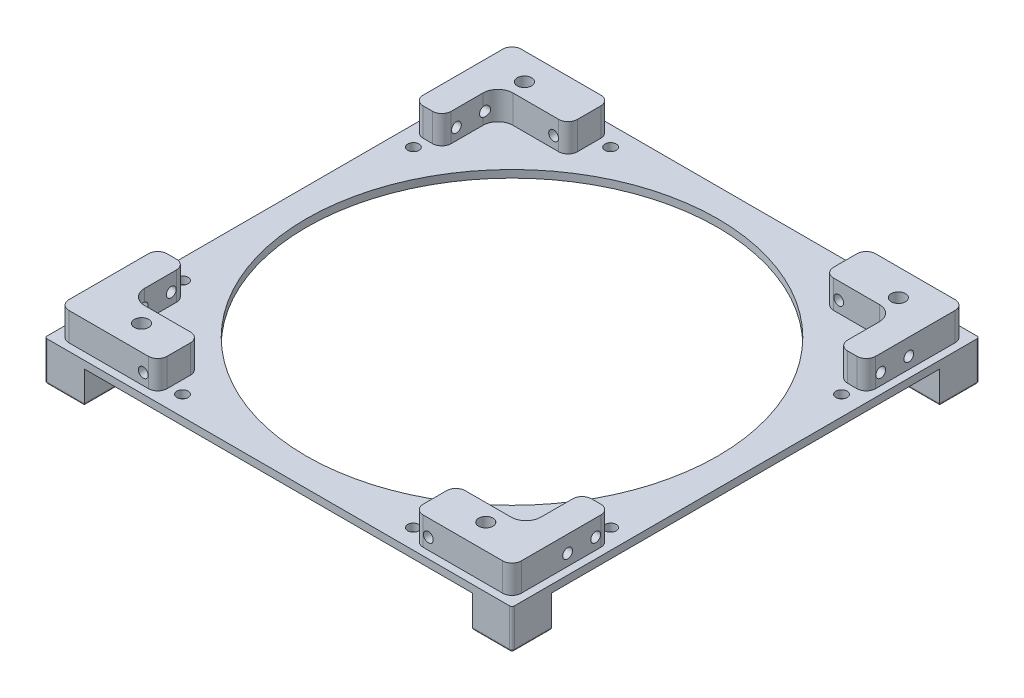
ISO-10303-21;
HEADER;
FILE_DESCRIPTION(('STEP AP214'),'2;1');
FILE_NAME('part.step','',(''),(''),'','','');
FILE_SCHEMA(('AUTOMOTIVE_DESIGN { 1 0 10303 214 1 1 1 1 }'));
ENDSEC;
DATA;
#1=APPLICATION_CONTEXT('core data for automotive mechanical design processes');
#2=APPLICATION_PROTOCOL_DEFINITION('international standard','automotive_design',2000,#1);
#3=PRODUCT_CONTEXT('',#1,'mechanical');
#4=PRODUCT('Part','Part','',(#3));
#5=PRODUCT_RELATED_PRODUCT_CATEGORY('part','',(#4));
#6=PRODUCT_DEFINITION_FORMATION('','',#4);
#7=PRODUCT_DEFINITION_CONTEXT('part definition',#1,'design');
#8=PRODUCT_DEFINITION('design','',#6,#7);
#9=PRODUCT_DEFINITION_SHAPE('','',#8);
#10=(LENGTH_UNIT() NAMED_UNIT(*) SI_UNIT(.MILLI.,.METRE.));
#11=(NAMED_UNIT(*) PLANE_ANGLE_UNIT() SI_UNIT($,.RADIAN.));
#12=(NAMED_UNIT(*) SI_UNIT($,.STERADIAN.) SOLID_ANGLE_UNIT());
#13=UNCERTAINTY_MEASURE_WITH_UNIT(LENGTH_MEASURE(1.E-05),#10,'distance_accuracy_value','');
#14=(GEOMETRIC_REPRESENTATION_CONTEXT(3) GLOBAL_UNCERTAINTY_ASSIGNED_CONTEXT((#13)) GLOBAL_UNIT_ASSIGNED_CONTEXT((#10,
#11,#12)) REPRESENTATION_CONTEXT('',''));
#15=CARTESIAN_POINT('',(0.,0.,0.));
#16=DIRECTION('',(0.,0.,1.));
#17=DIRECTION('',(1.,0.,0.));
#18=AXIS2_PLACEMENT_3D('',#15,#16,#17);
#19=CARTESIAN_POINT('',(-27.4,7.6,48.4));
#20=DIRECTION('',(0.,0.,-1.));
#21=DIRECTION('',(-1.,0.,0.));
#22=AXIS2_PLACEMENT_3D('',#19,#20,#21);
#23=PLANE('',#22);
#24=DIRECTION('',(-1.,0.,0.));
#25=VECTOR('',#24,1.);
#26=CARTESIAN_POINT('',(0.,1.6,48.4));
#27=LINE('',#26,#25);
#28=CARTESIAN_POINT('',(-29.4,1.6,48.4));
#29=VERTEX_POINT('',#28);
#30=CARTESIAN_POINT('',(-46.4,1.6,48.4));
#31=VERTEX_POINT('',#30);
#32=EDGE_CURVE('E1679',#29,#31,#27,.T.);
#33=ORIENTED_EDGE('',*,*,#32,.F.);
#34=DIRECTION('',(0.,-1.,0.));
#35=VECTOR('',#34,1.);
#36=CARTESIAN_POINT('',(-29.4,7.6,48.4));
#37=LINE('',#36,#35);
#38=CARTESIAN_POINT('',(-29.4,7.6,48.4));
#39=VERTEX_POINT('',#38);
#40=EDGE_CURVE('E798',#29,#39,#37,.F.);
#41=ORIENTED_EDGE('',*,*,#40,.T.);
#42=DIRECTION('',(1.,0.,0.));
#43=VECTOR('',#42,1.);
#44=CARTESIAN_POINT('',(-27.4,7.6,48.4));
#45=LINE('',#44,#43);
#46=CARTESIAN_POINT('',(-46.4,7.6,48.4));
#47=VERTEX_POINT('',#46);
#48=EDGE_CURVE('E1671',#47,#39,#45,.T.);
#49=ORIENTED_EDGE('',*,*,#48,.F.);
#50=DIRECTION('',(0.,-1.,0.));
#51=VECTOR('',#50,1.);
#52=CARTESIAN_POINT('',(-46.4,7.6,48.4));
#53=LINE('',#52,#51);
#54=EDGE_CURVE('E680',#47,#31,#53,.T.);
#55=ORIENTED_EDGE('',*,*,#54,.T.);
#56=EDGE_LOOP('',(#33,#41,#49,#55));
#57=FACE_BOUND('',#56,.T.);
#58=CARTESIAN_POINT('',(-30.5,4.05,48.4));
#59=DIRECTION('',(0.,0.,1.));
#60=DIRECTION('',(1.,0.,0.));
#61=AXIS2_PLACEMENT_3D('',#58,#59,#60);
#62=CIRCLE('',#61,1.05);
#63=CARTESIAN_POINT('',(-29.45,4.05,48.4));
#64=VERTEX_POINT('',#63);
#65=EDGE_CURVE('E2554',#64,#64,#62,.T.);
#66=ORIENTED_EDGE('',*,*,#65,.F.);
#67=EDGE_LOOP('',(#66));
#68=FACE_BOUND('',#67,.T.);
#69=ADVANCED_FACE('F41',(#57,#68),#23,.F.);
#70=CARTESIAN_POINT('',(-48.4,7.6,48.4));
#71=DIRECTION('',(1.,0.,0.));
#72=DIRECTION('',(0.,0.,-1.));
#73=AXIS2_PLACEMENT_3D('',#70,#71,#72);
#74=PLANE('',#73);
#75=DIRECTION('',(0.,0.,1.));
#76=VECTOR('',#75,1.);
#77=CARTESIAN_POINT('',(-48.4,7.6,48.4));
#78=LINE('',#77,#76);
#79=CARTESIAN_POINT('',(-48.4,7.6,29.4));
#80=VERTEX_POINT('',#79);
#81=CARTESIAN_POINT('',(-48.4,7.6,46.4));
#82=VERTEX_POINT('',#81);
#83=EDGE_CURVE('E1674',#80,#82,#78,.T.);
#84=ORIENTED_EDGE('',*,*,#83,.F.);
#85=DIRECTION('',(0.,-1.,0.));
#86=VECTOR('',#85,1.);
#87=CARTESIAN_POINT('',(-48.4,7.6,29.4));
#88=LINE('',#87,#86);
#89=CARTESIAN_POINT('',(-48.4,1.6,29.4));
#90=VERTEX_POINT('',#89);
#91=EDGE_CURVE('E800',#80,#90,#88,.T.);
#92=ORIENTED_EDGE('',*,*,#91,.T.);
#93=DIRECTION('',(0.,0.,-1.));
#94=VECTOR('',#93,1.);
#95=CARTESIAN_POINT('',(-48.4,1.6,0.));
#96=LINE('',#95,#94);
#97=CARTESIAN_POINT('',(-48.4,1.6,46.4));
#98=VERTEX_POINT('',#97);
#99=EDGE_CURVE('E1681',#98,#90,#96,.T.);
#100=ORIENTED_EDGE('',*,*,#99,.F.);
#101=DIRECTION('',(0.,-1.,0.));
#102=VECTOR('',#101,1.);
#103=CARTESIAN_POINT('',(-48.4,7.6,46.4));
#104=LINE('',#103,#102);
#105=EDGE_CURVE('E683',#98,#82,#104,.F.);
#106=ORIENTED_EDGE('',*,*,#105,.T.);
#107=EDGE_LOOP('',(#84,#92,#100,#106));
#108=FACE_BOUND('',#107,.T.);
#109=CARTESIAN_POINT('',(-48.4,4.05,30.5));
#110=DIRECTION('',(-1.,0.,0.));
#111=DIRECTION('',(0.,0.,1.));
#112=AXIS2_PLACEMENT_3D('',#109,#110,#111);
#113=CIRCLE('',#112,1.05);
#114=CARTESIAN_POINT('',(-48.4,4.05,31.55));
#115=VERTEX_POINT('',#114);
#116=EDGE_CURVE('E1934',#115,#115,#113,.T.);
#117=ORIENTED_EDGE('',*,*,#116,.F.);
#118=EDGE_LOOP('',(#117));
#119=FACE_BOUND('',#118,.T.);
#120=CARTESIAN_POINT('',(-48.4,4.05,36.5));
#121=DIRECTION('',(-1.,0.,0.));
#122=DIRECTION('',(0.,0.,1.));
#123=AXIS2_PLACEMENT_3D('',#120,#121,#122);
#124=CIRCLE('',#123,1.05);
#125=CARTESIAN_POINT('',(-48.4,4.05,37.55));
#126=VERTEX_POINT('',#125);
#127=EDGE_CURVE('E1935',#126,#126,#124,.T.);
#128=ORIENTED_EDGE('',*,*,#127,.F.);
#129=EDGE_LOOP('',(#128));
#130=FACE_BOUND('',#129,.T.);
#131=ADVANCED_FACE('F1136',(#108,#119,#130),#74,.F.);
#132=CARTESIAN_POINT('',(-48.4,7.6,-27.4));
#133=DIRECTION('',(1.,0.,0.));
#134=DIRECTION('',(0.,0.,-1.));
#135=AXIS2_PLACEMENT_3D('',#132,#133,#134);
#136=PLANE('',#135);
#137=CARTESIAN_POINT('',(-48.4,4.05,-30.5));
#138=DIRECTION('',(-1.,0.,0.));
#139=DIRECTION('',(0.,0.,1.));
#140=AXIS2_PLACEMENT_3D('',#137,#138,#139);
#141=CIRCLE('',#140,1.05);
#142=CARTESIAN_POINT('',(-48.4,4.05,-29.45));
#143=VERTEX_POINT('',#142);
#144=EDGE_CURVE('E1958',#143,#143,#141,.T.);
#145=ORIENTED_EDGE('',*,*,#144,.F.);
#146=EDGE_LOOP('',(#145));
#147=FACE_BOUND('',#146,.T.);
#148=DIRECTION('',(0.,0.,-1.));
#149=VECTOR('',#148,1.);
#150=CARTESIAN_POINT('',(-48.4,1.6,0.));
#151=LINE('',#150,#149);
#152=CARTESIAN_POINT('',(-48.4,1.6,-29.4));
#153=VERTEX_POINT('',#152);
#154=CARTESIAN_POINT('',(-48.4,1.6,-46.4));
#155=VERTEX_POINT('',#154);
#156=EDGE_CURVE('E1666',#153,#155,#151,.T.);
#157=ORIENTED_EDGE('',*,*,#156,.F.);
#158=DIRECTION('',(0.,-1.,0.));
#159=VECTOR('',#158,1.);
#160=CARTESIAN_POINT('',(-48.4,7.6,-29.4));
#161=LINE('',#160,#159);
#162=CARTESIAN_POINT('',(-48.4,7.6,-29.4));
#163=VERTEX_POINT('',#162);
#164=EDGE_CURVE('E803',#153,#163,#161,.F.);
#165=ORIENTED_EDGE('',*,*,#164,.T.);
#166=DIRECTION('',(0.,0.,1.));
#167=VECTOR('',#166,1.);
#168=CARTESIAN_POINT('',(-48.4,7.6,-27.4));
#169=LINE('',#168,#167);
#170=CARTESIAN_POINT('',(-48.4,7.6,-46.4));
#171=VERTEX_POINT('',#170);
#172=EDGE_CURVE('E1646',#171,#163,#169,.T.);
#173=ORIENTED_EDGE('',*,*,#172,.F.);
#174=DIRECTION('',(0.,-1.,0.));
#175=VECTOR('',#174,1.);
#176=CARTESIAN_POINT('',(-48.4,7.6,-46.4));
#177=LINE('',#176,#175);
#178=EDGE_CURVE('E672',#171,#155,#177,.T.);
#179=ORIENTED_EDGE('',*,*,#178,.T.);
#180=EDGE_LOOP('',(#157,#165,#173,#179));
#181=FACE_BOUND('',#180,.T.);
#182=CARTESIAN_POINT('',(-48.4,4.05,-36.5));
#183=DIRECTION('',(-1.,0.,0.));
#184=DIRECTION('',(0.,0.,1.));
#185=AXIS2_PLACEMENT_3D('',#182,#183,#184);
#186=CIRCLE('',#185,1.05);
#187=CARTESIAN_POINT('',(-48.4,4.05,-35.45));
#188=VERTEX_POINT('',#187);
#189=EDGE_CURVE('E1953',#188,#188,#186,.T.);
#190=ORIENTED_EDGE('',*,*,#189,.F.);
#191=EDGE_LOOP('',(#190));
#192=FACE_BOUND('',#191,.T.);
#193=ADVANCED_FACE('F1142',(#147,#181,#192),#136,.F.);
#194=CARTESIAN_POINT('',(-41.5,-6.9,-50.));
#195=DIRECTION('',(1.,0.,0.));
#196=DIRECTION('',(0.,0.,-1.));
#197=AXIS2_PLACEMENT_3D('',#194,#195,#196);
#198=PLANE('',#197);
#199=DIRECTION('',(0.,1.,0.));
#200=VECTOR('',#199,1.);
#201=CARTESIAN_POINT('',(-41.5,-6.9,-44.9878938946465));
#202=LINE('',#201,#200);
#203=CARTESIAN_POINT('',(-41.5,0.,-44.9878938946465));
#204=VERTEX_POINT('',#203);
#205=CARTESIAN_POINT('',(-41.5,-6.4,-44.9878938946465));
#206=VERTEX_POINT('',#205);
#207=EDGE_CURVE('E919',#204,#206,#202,.F.);
#208=ORIENTED_EDGE('',*,*,#207,.T.);
#209=DIRECTION('',(0.,0.,-1.));
#210=VECTOR('',#209,1.);
#211=CARTESIAN_POINT('',(-41.5,-6.4,-50.));
#212=LINE('',#211,#210);
#213=CARTESIAN_POINT('',(-41.5,-6.4,-50.));
#214=VERTEX_POINT('',#213);
#215=EDGE_CURVE('E921',#206,#214,#212,.T.);
#216=ORIENTED_EDGE('',*,*,#215,.T.);
#217=DIRECTION('',(0.,1.,0.));
#218=VECTOR('',#217,1.);
#219=CARTESIAN_POINT('',(-41.5,-6.9,-50.));
#220=LINE('',#219,#218);
#221=CARTESIAN_POINT('',(-41.5,0.,-50.));
#222=VERTEX_POINT('',#221);
#223=EDGE_CURVE('E1511',#214,#222,#220,.T.);
#224=ORIENTED_EDGE('',*,*,#223,.T.);
#225=DIRECTION('',(0.,0.,-1.));
#226=VECTOR('',#225,1.);
#227=CARTESIAN_POINT('',(-41.5,0.,-50.));
#228=LINE('',#227,#226);
#229=EDGE_CURVE('E1502',#204,#222,#228,.T.);
#230=ORIENTED_EDGE('',*,*,#229,.F.);
#231=EDGE_LOOP('',(#208,#216,#224,#230));
#232=FACE_BOUND('',#231,.T.);
#233=ADVANCED_FACE('F1240',(#232),#198,.T.);
#234=CARTESIAN_POINT('',(-50.,-6.9,-41.5));
#235=DIRECTION('',(0.,0.,1.));
#236=DIRECTION('',(1.,0.,0.));
#237=AXIS2_PLACEMENT_3D('',#234,#235,#236);
#238=PLANE('',#237);
#239=DIRECTION('',(0.,1.,0.));
#240=VECTOR('',#239,1.);
#241=CARTESIAN_POINT('',(-50.,-6.9,-41.5));
#242=LINE('',#241,#240);
#243=CARTESIAN_POINT('',(-50.,-6.4,-41.5));
#244=VERTEX_POINT('',#243);
#245=CARTESIAN_POINT('',(-50.,0.,-41.5));
#246=VERTEX_POINT('',#245);
#247=EDGE_CURVE('E1505',#244,#246,#242,.T.);
#248=ORIENTED_EDGE('',*,*,#247,.F.);
#249=DIRECTION('',(1.,0.,0.));
#250=VECTOR('',#249,1.);
#251=CARTESIAN_POINT('',(-42.2672679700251,-6.4,-41.5));
#252=LINE('',#251,#250);
#253=CARTESIAN_POINT('',(-42.9837828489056,-6.4,-41.5));
#254=VERTEX_POINT('',#253);
#255=EDGE_CURVE('E939',#244,#254,#252,.T.);
#256=ORIENTED_EDGE('',*,*,#255,.T.);
#257=DIRECTION('',(0.,1.,0.));
#258=VECTOR('',#257,1.);
#259=CARTESIAN_POINT('',(-42.9837828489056,-6.9,-41.5));
#260=LINE('',#259,#258);
#261=CARTESIAN_POINT('',(-42.9837828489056,0.,-41.5));
#262=VERTEX_POINT('',#261);
#263=EDGE_CURVE('E937',#254,#262,#260,.T.);
#264=ORIENTED_EDGE('',*,*,#263,.T.);
#265=DIRECTION('',(1.,0.,0.));
#266=VECTOR('',#265,1.);
#267=CARTESIAN_POINT('',(-50.,0.,-41.5));
#268=LINE('',#267,#266);
#269=EDGE_CURVE('E1498',#246,#262,#268,.T.);
#270=ORIENTED_EDGE('',*,*,#269,.F.);
#271=EDGE_LOOP('',(#248,#256,#264,#270));
#272=FACE_BOUND('',#271,.T.);
#273=ADVANCED_FACE('F1231',(#272),#238,.T.);
#274=CARTESIAN_POINT('',(50.,-6.9,-41.5));
#275=DIRECTION('',(0.,0.,1.));
#276=DIRECTION('',(1.,0.,0.));
#277=AXIS2_PLACEMENT_3D('',#274,#275,#276);
#278=PLANE('',#277);
#279=DIRECTION('',(0.,1.,0.));
#280=VECTOR('',#279,1.);
#281=CARTESIAN_POINT('',(42.9237828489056,-6.9,-41.5));
#282=LINE('',#281,#280);
#283=CARTESIAN_POINT('',(42.9237828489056,0.,-41.5));
#284=VERTEX_POINT('',#283);
#285=CARTESIAN_POINT('',(42.9237828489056,-6.4,-41.5));
#286=VERTEX_POINT('',#285);
#287=EDGE_CURVE('E915',#284,#286,#282,.F.);
#288=ORIENTED_EDGE('',*,*,#287,.T.);
#289=DIRECTION('',(1.,0.,0.));
#290=VECTOR('',#289,1.);
#291=CARTESIAN_POINT('',(50.,-6.4,-41.5));
#292=LINE('',#291,#290);
#293=CARTESIAN_POINT('',(50.,-6.4,-41.5));
#294=VERTEX_POINT('',#293);
#295=EDGE_CURVE('E917',#286,#294,#292,.T.);
#296=ORIENTED_EDGE('',*,*,#295,.T.);
#297=DIRECTION('',(0.,1.,0.));
#298=VECTOR('',#297,1.);
#299=CARTESIAN_POINT('',(50.,-6.9,-41.5));
#300=LINE('',#299,#298);
#301=CARTESIAN_POINT('',(50.,0.,-41.5));
#302=VERTEX_POINT('',#301);
#303=EDGE_CURVE('E1503',#294,#302,#300,.T.);
#304=ORIENTED_EDGE('',*,*,#303,.T.);
#305=DIRECTION('',(1.,0.,0.));
#306=VECTOR('',#305,1.);
#307=CARTESIAN_POINT('',(50.,0.,-41.5));
#308=LINE('',#307,#306);
#309=EDGE_CURVE('E609',#284,#302,#308,.T.);
#310=ORIENTED_EDGE('',*,*,#309,.F.);
#311=EDGE_LOOP('',(#288,#296,#304,#310));
#312=FACE_BOUND('',#311,.T.);
#313=ADVANCED_FACE('F1227',(#312),#278,.T.);
#314=CARTESIAN_POINT('',(41.5,-6.9,-50.));
#315=DIRECTION('',(-1.,0.,0.));
#316=DIRECTION('',(0.,0.,1.));
#317=AXIS2_PLACEMENT_3D('',#314,#315,#316);
#318=PLANE('',#317);
#319=DIRECTION('',(0.,1.,0.));
#320=VECTOR('',#319,1.);
#321=CARTESIAN_POINT('',(41.5,-6.9,-50.));
#322=LINE('',#321,#320);
#323=CARTESIAN_POINT('',(41.5,-6.4,-50.));
#324=VERTEX_POINT('',#323);
#325=CARTESIAN_POINT('',(41.5,0.,-50.));
#326=VERTEX_POINT('',#325);
#327=EDGE_CURVE('E1507',#324,#326,#322,.T.);
#328=ORIENTED_EDGE('',*,*,#327,.F.);
#329=DIRECTION('',(0.,0.,1.));
#330=VECTOR('',#329,1.);
#331=CARTESIAN_POINT('',(41.5,-6.4,-50.));
#332=LINE('',#331,#330);
#333=CARTESIAN_POINT('',(41.5,-6.4,-44.9353155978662));
#334=VERTEX_POINT('',#333);
#335=EDGE_CURVE('E906',#324,#334,#332,.T.);
#336=ORIENTED_EDGE('',*,*,#335,.T.);
#337=DIRECTION('',(0.,1.,0.));
#338=VECTOR('',#337,1.);
#339=CARTESIAN_POINT('',(41.5,-6.9,-44.9353155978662));
#340=LINE('',#339,#338);
#341=CARTESIAN_POINT('',(41.5,0.,-44.9353155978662));
#342=VERTEX_POINT('',#341);
#343=EDGE_CURVE('E904',#334,#342,#340,.T.);
#344=ORIENTED_EDGE('',*,*,#343,.T.);
#345=DIRECTION('',(0.,0.,1.));
#346=VECTOR('',#345,1.);
#347=CARTESIAN_POINT('',(41.5,0.,-50.));
#348=LINE('',#347,#346);
#349=EDGE_CURVE('E1555',#326,#342,#348,.T.);
#350=ORIENTED_EDGE('',*,*,#349,.F.);
#351=EDGE_LOOP('',(#328,#336,#344,#350));
#352=FACE_BOUND('',#351,.T.);
#353=ADVANCED_FACE('F1230',(#352),#318,.T.);
#354=CARTESIAN_POINT('',(0.,0.,0.));
#355=DIRECTION('',(0.,1.,0.));
#356=DIRECTION('',(0.,0.,1.));
#357=AXIS2_PLACEMENT_3D('',#354,#355,#356);
#358=PLANE('',#357);
#359=CARTESIAN_POINT('',(-45.8,0.,24.7));
#360=DIRECTION('',(0.,1.,0.));
#361=DIRECTION('',(0.,0.,1.));
#362=AXIS2_PLACEMENT_3D('',#359,#360,#361);
#363=CIRCLE('',#362,1.2);
#364=CARTESIAN_POINT('',(-45.8,0.,25.9));
#365=VERTEX_POINT('',#364);
#366=EDGE_CURVE('E2608',#365,#365,#363,.T.);
#367=ORIENTED_EDGE('',*,*,#366,.T.);
#368=EDGE_LOOP('',(#367));
#369=FACE_BOUND('',#368,.T.);
#370=CARTESIAN_POINT('',(-24.7,0.,45.8));
#371=DIRECTION('',(0.,1.,0.));
#372=DIRECTION('',(0.,0.,1.));
#373=AXIS2_PLACEMENT_3D('',#370,#371,#372);
#374=CIRCLE('',#373,1.2);
#375=CARTESIAN_POINT('',(-24.7,0.,47.));
#376=VERTEX_POINT('',#375);
#377=EDGE_CURVE('E2602',#376,#376,#374,.T.);
#378=ORIENTED_EDGE('',*,*,#377,.T.);
#379=EDGE_LOOP('',(#378));
#380=FACE_BOUND('',#379,.T.);
#381=CARTESIAN_POINT('',(45.8,0.,24.7));
#382=DIRECTION('',(0.,1.,0.));
#383=DIRECTION('',(0.,0.,1.));
#384=AXIS2_PLACEMENT_3D('',#381,#382,#383);
#385=CIRCLE('',#384,1.2);
#386=CARTESIAN_POINT('',(45.8,0.,25.9));
#387=VERTEX_POINT('',#386);
#388=EDGE_CURVE('E2596',#387,#387,#385,.T.);
#389=ORIENTED_EDGE('',*,*,#388,.T.);
#390=EDGE_LOOP('',(#389));
#391=FACE_BOUND('',#390,.T.);
#392=CARTESIAN_POINT('',(24.7,0.,45.8));
#393=DIRECTION('',(0.,1.,0.));
#394=DIRECTION('',(0.,0.,1.));
#395=AXIS2_PLACEMENT_3D('',#392,#393,#394);
#396=CIRCLE('',#395,1.2);
#397=CARTESIAN_POINT('',(24.7,0.,47.));
#398=VERTEX_POINT('',#397);
#399=EDGE_CURVE('E2590',#398,#398,#396,.T.);
#400=ORIENTED_EDGE('',*,*,#399,.T.);
#401=EDGE_LOOP('',(#400));
#402=FACE_BOUND('',#401,.T.);
#403=CARTESIAN_POINT('',(45.8,0.,-24.7));
#404=DIRECTION('',(0.,1.,0.));
#405=DIRECTION('',(0.,0.,1.));
#406=AXIS2_PLACEMENT_3D('',#403,#404,#405);
#407=CIRCLE('',#406,1.2);
#408=CARTESIAN_POINT('',(45.8,0.,-23.5));
#409=VERTEX_POINT('',#408);
#410=EDGE_CURVE('E2584',#409,#409,#407,.T.);
#411=ORIENTED_EDGE('',*,*,#410,.T.);
#412=EDGE_LOOP('',(#411));
#413=FACE_BOUND('',#412,.T.);
#414=CARTESIAN_POINT('',(24.7,0.,-45.8));
#415=DIRECTION('',(0.,1.,0.));
#416=DIRECTION('',(0.,0.,1.));
#417=AXIS2_PLACEMENT_3D('',#414,#415,#416);
#418=CIRCLE('',#417,1.2);
#419=CARTESIAN_POINT('',(24.7,0.,-44.6));
#420=VERTEX_POINT('',#419);
#421=EDGE_CURVE('E2578',#420,#420,#418,.T.);
#422=ORIENTED_EDGE('',*,*,#421,.T.);
#423=EDGE_LOOP('',(#422));
#424=FACE_BOUND('',#423,.T.);
#425=CARTESIAN_POINT('',(-45.8,0.,-24.7));
#426=DIRECTION('',(0.,1.,0.));
#427=DIRECTION('',(0.,0.,1.));
#428=AXIS2_PLACEMENT_3D('',#425,#426,#427);
#429=CIRCLE('',#428,1.2);
#430=CARTESIAN_POINT('',(-45.8,0.,-23.5));
#431=VERTEX_POINT('',#430);
#432=EDGE_CURVE('E2572',#431,#431,#429,.T.);
#433=ORIENTED_EDGE('',*,*,#432,.T.);
#434=EDGE_LOOP('',(#433));
#435=FACE_BOUND('',#434,.T.);
#436=CARTESIAN_POINT('',(-24.7,0.,-45.8));
#437=DIRECTION('',(0.,1.,0.));
#438=DIRECTION('',(0.,0.,1.));
#439=AXIS2_PLACEMENT_3D('',#436,#437,#438);
#440=CIRCLE('',#439,1.2);
#441=CARTESIAN_POINT('',(-24.7,0.,-44.6));
#442=VERTEX_POINT('',#441);
#443=EDGE_CURVE('E2566',#442,#442,#440,.T.);
#444=ORIENTED_EDGE('',*,*,#443,.T.);
#445=EDGE_LOOP('',(#444));
#446=FACE_BOUND('',#445,.T.);
#447=CARTESIAN_POINT('',(-36.225,0.,43.045));
#448=DIRECTION('',(0.,-1.,0.));
#449=DIRECTION('',(0.,0.,-1.));
#450=AXIS2_PLACEMENT_3D('',#447,#448,#449);
#451=CIRCLE('',#450,2.5273);
#452=CARTESIAN_POINT('',(-36.225,0.,40.5177));
#453=VERTEX_POINT('',#452);
#454=EDGE_CURVE('E1589',#453,#453,#451,.T.);
#455=ORIENTED_EDGE('',*,*,#454,.F.);
#456=EDGE_LOOP('',(#455));
#457=FACE_BOUND('',#456,.T.);
#458=ORIENTED_EDGE('',*,*,#349,.T.);
#459=CARTESIAN_POINT('',(42.,0.,-44.9353155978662));
#460=DIRECTION('',(0.,1.,0.));
#461=DIRECTION('',(0.,0.,1.));
#462=AXIS2_PLACEMENT_3D('',#459,#460,#461);
#463=CIRCLE('',#462,0.5);
#464=CARTESIAN_POINT('',(41.6655435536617,0.,-44.5636451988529));
#465=VERTEX_POINT('',#464);
#466=EDGE_CURVE('E953',#342,#465,#463,.T.);
#467=ORIENTED_EDGE('',*,*,#466,.T.);
#468=CARTESIAN_POINT('',(39.975,0.,-42.685));
#469=DIRECTION('',(0.,-1.,0.));
#470=DIRECTION('',(0.,0.,-1.));
#471=AXIS2_PLACEMENT_3D('',#468,#469,#470);
#472=CIRCLE('',#471,2.5273);
#473=CARTESIAN_POINT('',(42.436751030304,0.,-42.1131371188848));
#474=VERTEX_POINT('',#473);
#475=EDGE_CURVE('E973',#474,#465,#472,.T.);
#476=ORIENTED_EDGE('',*,*,#475,.F.);
#477=CARTESIAN_POINT('',(42.9237828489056,0.,-42.));
#478=DIRECTION('',(0.,1.,0.));
#479=DIRECTION('',(0.,0.,1.));
#480=AXIS2_PLACEMENT_3D('',#477,#478,#479);
#481=CIRCLE('',#480,0.5);
#482=EDGE_CURVE('E956',#474,#284,#481,.T.);
#483=ORIENTED_EDGE('',*,*,#482,.T.);
#484=ORIENTED_EDGE('',*,*,#309,.T.);
#485=DIRECTION('',(0.,0.,-1.));
#486=VECTOR('',#485,1.);
#487=CARTESIAN_POINT('',(50.,0.,-50.));
#488=LINE('',#487,#486);
#489=CARTESIAN_POINT('',(50.,0.,41.5));
#490=VERTEX_POINT('',#489);
#491=EDGE_CURVE('E587',#490,#302,#488,.T.);
#492=ORIENTED_EDGE('',*,*,#491,.F.);
#493=DIRECTION('',(-1.,0.,0.));
#494=VECTOR('',#493,1.);
#495=CARTESIAN_POINT('',(50.,0.,41.5));
#496=LINE('',#495,#494);
#497=CARTESIAN_POINT('',(41.5,0.,41.5));
#498=VERTEX_POINT('',#497);
#499=EDGE_CURVE('E597',#490,#498,#496,.T.);
#500=ORIENTED_EDGE('',*,*,#499,.T.);
#501=DIRECTION('',(0.,0.,1.));
#502=VECTOR('',#501,1.);
#503=CARTESIAN_POINT('',(41.5,0.,50.));
#504=LINE('',#503,#502);
#505=CARTESIAN_POINT('',(41.5,0.,50.));
#506=VERTEX_POINT('',#505);
#507=EDGE_CURVE('E594',#498,#506,#504,.T.);
#508=ORIENTED_EDGE('',*,*,#507,.T.);
#509=DIRECTION('',(1.,0.,0.));
#510=VECTOR('',#509,1.);
#511=CARTESIAN_POINT('',(-50.,0.,50.));
#512=LINE('',#511,#510);
#513=CARTESIAN_POINT('',(-41.5,0.,50.));
#514=VERTEX_POINT('',#513);
#515=EDGE_CURVE('E612',#514,#506,#512,.T.);
#516=ORIENTED_EDGE('',*,*,#515,.F.);
#517=DIRECTION('',(0.,0.,-1.));
#518=VECTOR('',#517,1.);
#519=CARTESIAN_POINT('',(-41.5,0.,50.));
#520=LINE('',#519,#518);
#521=CARTESIAN_POINT('',(-41.5,0.,41.5));
#522=VERTEX_POINT('',#521);
#523=EDGE_CURVE('E1742',#514,#522,#520,.T.);
#524=ORIENTED_EDGE('',*,*,#523,.T.);
#525=DIRECTION('',(-1.,0.,0.));
#526=VECTOR('',#525,1.);
#527=CARTESIAN_POINT('',(-50.,0.,41.5));
#528=LINE('',#527,#526);
#529=CARTESIAN_POINT('',(-50.,0.,41.5));
#530=VERTEX_POINT('',#529);
#531=EDGE_CURVE('E1746',#522,#530,#528,.T.);
#532=ORIENTED_EDGE('',*,*,#531,.T.);
#533=DIRECTION('',(0.,0.,1.));
#534=VECTOR('',#533,1.);
#535=CARTESIAN_POINT('',(-50.,0.,-50.));
#536=LINE('',#535,#534);
#537=EDGE_CURVE('E618',#246,#530,#536,.T.);
#538=ORIENTED_EDGE('',*,*,#537,.F.);
#539=ORIENTED_EDGE('',*,*,#269,.T.);
#540=CARTESIAN_POINT('',(-42.9837828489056,0.,-42.));
#541=DIRECTION('',(0.,1.,0.));
#542=DIRECTION('',(0.,0.,1.));
#543=AXIS2_PLACEMENT_3D('',#540,#541,#542);
#544=CIRCLE('',#543,0.5);
#545=CARTESIAN_POINT('',(-42.496751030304,0.,-42.1131371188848));
#546=VERTEX_POINT('',#545);
#547=EDGE_CURVE('E950',#262,#546,#544,.T.);
#548=ORIENTED_EDGE('',*,*,#547,.T.);
#549=CARTESIAN_POINT('',(-40.035,0.,-42.685));
#550=DIRECTION('',(0.,-1.,0.));
#551=DIRECTION('',(0.,0.,-1.));
#552=AXIS2_PLACEMENT_3D('',#549,#550,#551);
#553=CIRCLE('',#552,2.5273);
#554=CARTESIAN_POINT('',(-41.6754533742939,0.,-44.6075394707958));
#555=VERTEX_POINT('',#554);
#556=EDGE_CURVE('E1551',#555,#546,#553,.T.);
#557=ORIENTED_EDGE('',*,*,#556,.F.);
#558=CARTESIAN_POINT('',(-42.,0.,-44.9878938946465));
#559=DIRECTION('',(0.,1.,0.));
#560=DIRECTION('',(0.,0.,1.));
#561=AXIS2_PLACEMENT_3D('',#558,#559,#560);
#562=CIRCLE('',#561,0.5);
#563=EDGE_CURVE('E948',#555,#204,#562,.T.);
#564=ORIENTED_EDGE('',*,*,#563,.T.);
#565=ORIENTED_EDGE('',*,*,#229,.T.);
#566=DIRECTION('',(-1.,0.,0.));
#567=VECTOR('',#566,1.);
#568=CARTESIAN_POINT('',(-50.,0.,-50.));
#569=LINE('',#568,#567);
#570=EDGE_CURVE('E611',#326,#222,#569,.T.);
#571=ORIENTED_EDGE('',*,*,#570,.F.);
#572=EDGE_LOOP('',(#458,#467,#476,#483,#484,#492,#500,#508,#516,#524,#532,#538,#539,#548,#557,
#564,#565,#571));
#573=FACE_BOUND('',#572,.T.);
#574=CARTESIAN_POINT('',(0.,0.,0.));
#575=DIRECTION('',(0.,1.,0.));
#576=DIRECTION('',(0.,0.,1.));
#577=AXIS2_PLACEMENT_3D('',#574,#575,#576);
#578=CIRCLE('',#577,44.);
#579=CARTESIAN_POINT('',(0.,0.,44.));
#580=VERTEX_POINT('',#579);
#581=EDGE_CURVE('E1690',#580,#580,#578,.T.);
#582=ORIENTED_EDGE('',*,*,#581,.T.);
#583=EDGE_LOOP('',(#582));
#584=FACE_BOUND('',#583,.T.);
#585=CARTESIAN_POINT('',(37.435,0.,43.045));
#586=DIRECTION('',(0.,-1.,0.));
#587=DIRECTION('',(0.,0.,-1.));
#588=AXIS2_PLACEMENT_3D('',#585,#586,#587);
#589=CIRCLE('',#588,2.5273);
#590=CARTESIAN_POINT('',(37.435,0.,40.5177));
#591=VERTEX_POINT('',#590);
#592=EDGE_CURVE('E1598',#591,#591,#589,.T.);
#593=ORIENTED_EDGE('',*,*,#592,.F.);
#594=EDGE_LOOP('',(#593));
#595=FACE_BOUND('',#594,.T.);
#596=ADVANCED_FACE('F606',(#369,#380,#391,#402,#413,#424,#435,#446,#457,#573,#584,#595),#358,.F.);
#597=CARTESIAN_POINT('',(0.,1.6,0.));
#598=DIRECTION('',(0.,1.,0.));
#599=DIRECTION('',(0.,0.,1.));
#600=AXIS2_PLACEMENT_3D('',#597,#598,#599);
#601=PLANE('',#600);
#602=CARTESIAN_POINT('',(-45.8,1.6,24.7));
#603=DIRECTION('',(0.,1.,0.));
#604=DIRECTION('',(0.,0.,1.));
#605=AXIS2_PLACEMENT_3D('',#602,#603,#604);
#606=CIRCLE('',#605,1.2);
#607=CARTESIAN_POINT('',(-45.8,1.6,25.9));
#608=VERTEX_POINT('',#607);
#609=EDGE_CURVE('E2611',#608,#608,#606,.T.);
#610=ORIENTED_EDGE('',*,*,#609,.F.);
#611=EDGE_LOOP('',(#610));
#612=FACE_BOUND('',#611,.T.);
#613=CARTESIAN_POINT('',(-24.7,1.6,45.8));
#614=DIRECTION('',(0.,1.,0.));
#615=DIRECTION('',(0.,0.,1.));
#616=AXIS2_PLACEMENT_3D('',#613,#614,#615);
#617=CIRCLE('',#616,1.2);
#618=CARTESIAN_POINT('',(-24.7,1.6,47.));
#619=VERTEX_POINT('',#618);
#620=EDGE_CURVE('E2605',#619,#619,#617,.T.);
#621=ORIENTED_EDGE('',*,*,#620,.F.);
#622=EDGE_LOOP('',(#621));
#623=FACE_BOUND('',#622,.T.);
#624=CARTESIAN_POINT('',(45.8,1.6,24.7));
#625=DIRECTION('',(0.,1.,0.));
#626=DIRECTION('',(0.,0.,1.));
#627=AXIS2_PLACEMENT_3D('',#624,#625,#626);
#628=CIRCLE('',#627,1.2);
#629=CARTESIAN_POINT('',(45.8,1.6,25.9));
#630=VERTEX_POINT('',#629);
#631=EDGE_CURVE('E2599',#630,#630,#628,.T.);
#632=ORIENTED_EDGE('',*,*,#631,.F.);
#633=EDGE_LOOP('',(#632));
#634=FACE_BOUND('',#633,.T.);
#635=CARTESIAN_POINT('',(24.7,1.6,45.8));
#636=DIRECTION('',(0.,1.,0.));
#637=DIRECTION('',(0.,0.,1.));
#638=AXIS2_PLACEMENT_3D('',#635,#636,#637);
#639=CIRCLE('',#638,1.2);
#640=CARTESIAN_POINT('',(24.7,1.6,47.));
#641=VERTEX_POINT('',#640);
#642=EDGE_CURVE('E2593',#641,#641,#639,.T.);
#643=ORIENTED_EDGE('',*,*,#642,.F.);
#644=EDGE_LOOP('',(#643));
#645=FACE_BOUND('',#644,.T.);
#646=CARTESIAN_POINT('',(45.8,1.6,-24.7));
#647=DIRECTION('',(0.,1.,0.));
#648=DIRECTION('',(0.,0.,1.));
#649=AXIS2_PLACEMENT_3D('',#646,#647,#648);
#650=CIRCLE('',#649,1.2);
#651=CARTESIAN_POINT('',(45.8,1.6,-23.5));
#652=VERTEX_POINT('',#651);
#653=EDGE_CURVE('E2587',#652,#652,#650,.T.);
#654=ORIENTED_EDGE('',*,*,#653,.F.);
#655=EDGE_LOOP('',(#654));
#656=FACE_BOUND('',#655,.T.);
#657=CARTESIAN_POINT('',(24.7,1.6,-45.8));
#658=DIRECTION('',(0.,1.,0.));
#659=DIRECTION('',(0.,0.,1.));
#660=AXIS2_PLACEMENT_3D('',#657,#658,#659);
#661=CIRCLE('',#660,1.2);
#662=CARTESIAN_POINT('',(24.7,1.6,-44.6));
#663=VERTEX_POINT('',#662);
#664=EDGE_CURVE('E2581',#663,#663,#661,.T.);
#665=ORIENTED_EDGE('',*,*,#664,.F.);
#666=EDGE_LOOP('',(#665));
#667=FACE_BOUND('',#666,.T.);
#668=CARTESIAN_POINT('',(-45.8,1.6,-24.7));
#669=DIRECTION('',(0.,1.,0.));
#670=DIRECTION('',(0.,0.,1.));
#671=AXIS2_PLACEMENT_3D('',#668,#669,#670);
#672=CIRCLE('',#671,1.2);
#673=CARTESIAN_POINT('',(-45.8,1.6,-23.5));
#674=VERTEX_POINT('',#673);
#675=EDGE_CURVE('E2575',#674,#674,#672,.T.);
#676=ORIENTED_EDGE('',*,*,#675,.F.);
#677=EDGE_LOOP('',(#676));
#678=FACE_BOUND('',#677,.T.);
#679=CARTESIAN_POINT('',(-24.7,1.6,-45.8));
#680=DIRECTION('',(0.,1.,0.));
#681=DIRECTION('',(0.,0.,1.));
#682=AXIS2_PLACEMENT_3D('',#679,#680,#681);
#683=CIRCLE('',#682,1.2);
#684=CARTESIAN_POINT('',(-24.7,1.6,-44.6));
#685=VERTEX_POINT('',#684);
#686=EDGE_CURVE('E2569',#685,#685,#683,.T.);
#687=ORIENTED_EDGE('',*,*,#686,.F.);
#688=EDGE_LOOP('',(#687));
#689=FACE_BOUND('',#688,.T.);
#690=DIRECTION('',(1.,0.,0.));
#691=VECTOR('',#690,1.);
#692=CARTESIAN_POINT('',(0.,1.6,-39.4));
#693=LINE('',#692,#691);
#694=CARTESIAN_POINT('',(-39.2,1.6,-39.4));
#695=VERTEX_POINT('',#694);
#696=CARTESIAN_POINT('',(-29.4,1.6,-39.4));
#697=VERTEX_POINT('',#696);
#698=EDGE_CURVE('E1614',#695,#697,#693,.T.);
#699=ORIENTED_EDGE('',*,*,#698,.F.);
#700=CARTESIAN_POINT('',(-39.2,1.6,-36.2));
#701=DIRECTION('',(0.,1.,0.));
#702=DIRECTION('',(0.,0.,1.));
#703=AXIS2_PLACEMENT_3D('',#700,#701,#702);
#704=CIRCLE('',#703,3.2);
#705=CARTESIAN_POINT('',(-42.4,1.6,-36.2));
#706=VERTEX_POINT('',#705);
#707=EDGE_CURVE('E1047',#695,#706,#704,.T.);
#708=ORIENTED_EDGE('',*,*,#707,.T.);
#709=DIRECTION('',(0.,0.,-1.));
#710=VECTOR('',#709,1.);
#711=CARTESIAN_POINT('',(-42.4,1.6,0.));
#712=LINE('',#711,#710);
#713=CARTESIAN_POINT('',(-42.4,1.6,-29.4));
#714=VERTEX_POINT('',#713);
#715=EDGE_CURVE('E1610',#714,#706,#712,.T.);
#716=ORIENTED_EDGE('',*,*,#715,.F.);
#717=CARTESIAN_POINT('',(-44.4,1.6,-29.4));
#718=DIRECTION('',(0.,1.,0.));
#719=DIRECTION('',(0.,0.,1.));
#720=AXIS2_PLACEMENT_3D('',#717,#718,#719);
#721=CIRCLE('',#720,2.);
#722=CARTESIAN_POINT('',(-44.4,1.6,-27.4));
#723=VERTEX_POINT('',#722);
#724=EDGE_CURVE('E816',#714,#723,#721,.F.);
#725=ORIENTED_EDGE('',*,*,#724,.T.);
#726=DIRECTION('',(-1.,0.,0.));
#727=VECTOR('',#726,1.);
#728=CARTESIAN_POINT('',(0.,1.6,-27.4));
#729=LINE('',#728,#727);
#730=CARTESIAN_POINT('',(-46.4,1.6,-27.4));
#731=VERTEX_POINT('',#730);
#732=EDGE_CURVE('E1663',#723,#731,#729,.T.);
#733=ORIENTED_EDGE('',*,*,#732,.T.);
#734=CARTESIAN_POINT('',(-46.4,1.6,-29.4));
#735=DIRECTION('',(0.,1.,0.));
#736=DIRECTION('',(0.,0.,1.));
#737=AXIS2_PLACEMENT_3D('',#734,#735,#736);
#738=CIRCLE('',#737,2.);
#739=EDGE_CURVE('E840',#731,#153,#738,.F.);
#740=ORIENTED_EDGE('',*,*,#739,.T.);
#741=ORIENTED_EDGE('',*,*,#156,.T.);
#742=CARTESIAN_POINT('',(-46.4,1.6,-46.4));
#743=DIRECTION('',(0.,1.,0.));
#744=DIRECTION('',(0.,0.,1.));
#745=AXIS2_PLACEMENT_3D('',#742,#743,#744);
#746=CIRCLE('',#745,2.);
#747=CARTESIAN_POINT('',(-46.4,1.6,-48.4));
#748=VERTEX_POINT('',#747);
#749=EDGE_CURVE('E688',#155,#748,#746,.F.);
#750=ORIENTED_EDGE('',*,*,#749,.T.);
#751=DIRECTION('',(1.,0.,0.));
#752=VECTOR('',#751,1.);
#753=CARTESIAN_POINT('',(0.,1.6,-48.4));
#754=LINE('',#753,#752);
#755=CARTESIAN_POINT('',(-29.4,1.6,-48.4));
#756=VERTEX_POINT('',#755);
#757=EDGE_CURVE('E1657',#748,#756,#754,.T.);
#758=ORIENTED_EDGE('',*,*,#757,.T.);
#759=CARTESIAN_POINT('',(-29.4,1.6,-46.4));
#760=DIRECTION('',(0.,1.,0.));
#761=DIRECTION('',(0.,0.,1.));
#762=AXIS2_PLACEMENT_3D('',#759,#760,#761);
#763=CIRCLE('',#762,2.);
#764=CARTESIAN_POINT('',(-27.4,1.6,-46.4));
#765=VERTEX_POINT('',#764);
#766=EDGE_CURVE('E842',#756,#765,#763,.F.);
#767=ORIENTED_EDGE('',*,*,#766,.T.);
#768=DIRECTION('',(0.,0.,1.));
#769=VECTOR('',#768,1.);
#770=CARTESIAN_POINT('',(-27.4,1.6,0.));
#771=LINE('',#770,#769);
#772=CARTESIAN_POINT('',(-27.4,1.6,-41.4));
#773=VERTEX_POINT('',#772);
#774=EDGE_CURVE('E1660',#765,#773,#771,.T.);
#775=ORIENTED_EDGE('',*,*,#774,.T.);
#776=CARTESIAN_POINT('',(-29.4,1.6,-41.4));
#777=DIRECTION('',(0.,1.,0.));
#778=DIRECTION('',(0.,0.,1.));
#779=AXIS2_PLACEMENT_3D('',#776,#777,#778);
#780=CIRCLE('',#779,2.);
#781=EDGE_CURVE('E813',#773,#697,#780,.F.);
#782=ORIENTED_EDGE('',*,*,#781,.T.);
#783=EDGE_LOOP('',(#699,#708,#716,#725,#733,#740,#741,#750,#758,#767,#775,#782));
#784=FACE_BOUND('',#783,.T.);
#785=DIRECTION('',(0.,0.,1.));
#786=VECTOR('',#785,1.);
#787=CARTESIAN_POINT('',(42.4,1.6,0.));
#788=LINE('',#787,#786);
#789=CARTESIAN_POINT('',(42.4,1.6,-36.2));
#790=VERTEX_POINT('',#789);
#791=CARTESIAN_POINT('',(42.4,1.6,-29.4));
#792=VERTEX_POINT('',#791);
#793=EDGE_CURVE('E1624',#790,#792,#788,.T.);
#794=ORIENTED_EDGE('',*,*,#793,.F.);
#795=CARTESIAN_POINT('',(39.2,1.6,-36.2));
#796=DIRECTION('',(0.,1.,0.));
#797=DIRECTION('',(0.,0.,1.));
#798=AXIS2_PLACEMENT_3D('',#795,#796,#797);
#799=CIRCLE('',#798,3.2);
#800=CARTESIAN_POINT('',(39.2,1.6,-39.4));
#801=VERTEX_POINT('',#800);
#802=EDGE_CURVE('E1049',#790,#801,#799,.T.);
#803=ORIENTED_EDGE('',*,*,#802,.T.);
#804=DIRECTION('',(1.,0.,0.));
#805=VECTOR('',#804,1.);
#806=CARTESIAN_POINT('',(0.,1.6,-39.4));
#807=LINE('',#806,#805);
#808=CARTESIAN_POINT('',(29.4,1.6,-39.4));
#809=VERTEX_POINT('',#808);
#810=EDGE_CURVE('E1619',#809,#801,#807,.T.);
#811=ORIENTED_EDGE('',*,*,#810,.F.);
#812=CARTESIAN_POINT('',(29.4,1.6,-41.4));
#813=DIRECTION('',(0.,1.,0.));
#814=DIRECTION('',(0.,0.,1.));
#815=AXIS2_PLACEMENT_3D('',#812,#813,#814);
#816=CIRCLE('',#815,2.);
#817=CARTESIAN_POINT('',(27.4,1.6,-41.4));
#818=VERTEX_POINT('',#817);
#819=EDGE_CURVE('E808',#809,#818,#816,.F.);
#820=ORIENTED_EDGE('',*,*,#819,.T.);
#821=DIRECTION('',(0.,0.,1.));
#822=VECTOR('',#821,1.);
#823=CARTESIAN_POINT('',(27.4,1.6,0.));
#824=LINE('',#823,#822);
#825=CARTESIAN_POINT('',(27.4,1.6,-46.4));
#826=VERTEX_POINT('',#825);
#827=EDGE_CURVE('E1710',#826,#818,#824,.T.);
#828=ORIENTED_EDGE('',*,*,#827,.F.);
#829=CARTESIAN_POINT('',(29.4,1.6,-46.4));
#830=DIRECTION('',(0.,1.,0.));
#831=DIRECTION('',(0.,0.,1.));
#832=AXIS2_PLACEMENT_3D('',#829,#830,#831);
#833=CIRCLE('',#832,2.);
#834=CARTESIAN_POINT('',(29.4,1.6,-48.4));
#835=VERTEX_POINT('',#834);
#836=EDGE_CURVE('E828',#826,#835,#833,.F.);
#837=ORIENTED_EDGE('',*,*,#836,.T.);
#838=DIRECTION('',(-1.,0.,0.));
#839=VECTOR('',#838,1.);
#840=CARTESIAN_POINT('',(0.,1.6,-48.4));
#841=LINE('',#840,#839);
#842=CARTESIAN_POINT('',(46.4,1.6,-48.4));
#843=VERTEX_POINT('',#842);
#844=EDGE_CURVE('E1713',#843,#835,#841,.T.);
#845=ORIENTED_EDGE('',*,*,#844,.F.);
#846=CARTESIAN_POINT('',(46.4,1.6,-46.4));
#847=DIRECTION('',(0.,1.,0.));
#848=DIRECTION('',(0.,0.,1.));
#849=AXIS2_PLACEMENT_3D('',#846,#847,#848);
#850=CIRCLE('',#849,2.);
#851=CARTESIAN_POINT('',(48.4,1.6,-46.4));
#852=VERTEX_POINT('',#851);
#853=EDGE_CURVE('E639',#843,#852,#850,.F.);
#854=ORIENTED_EDGE('',*,*,#853,.T.);
#855=DIRECTION('',(0.,0.,-1.));
#856=VECTOR('',#855,1.);
#857=CARTESIAN_POINT('',(48.4,1.6,0.));
#858=LINE('',#857,#856);
#859=CARTESIAN_POINT('',(48.4,1.6,-29.4));
#860=VERTEX_POINT('',#859);
#861=EDGE_CURVE('E1716',#860,#852,#858,.T.);
#862=ORIENTED_EDGE('',*,*,#861,.F.);
#863=CARTESIAN_POINT('',(46.4,1.6,-29.4));
#864=DIRECTION('',(0.,1.,0.));
#865=DIRECTION('',(0.,0.,1.));
#866=AXIS2_PLACEMENT_3D('',#863,#864,#865);
#867=CIRCLE('',#866,2.);
#868=CARTESIAN_POINT('',(46.4,1.6,-27.4));
#869=VERTEX_POINT('',#868);
#870=EDGE_CURVE('E830',#860,#869,#867,.F.);
#871=ORIENTED_EDGE('',*,*,#870,.T.);
#872=DIRECTION('',(1.,0.,0.));
#873=VECTOR('',#872,1.);
#874=CARTESIAN_POINT('',(0.,1.6,-27.4));
#875=LINE('',#874,#873);
#876=CARTESIAN_POINT('',(44.4,1.6,-27.4));
#877=VERTEX_POINT('',#876);
#878=EDGE_CURVE('E1707',#877,#869,#875,.T.);
#879=ORIENTED_EDGE('',*,*,#878,.F.);
#880=CARTESIAN_POINT('',(44.4,1.6,-29.4));
#881=DIRECTION('',(0.,1.,0.));
#882=DIRECTION('',(0.,0.,1.));
#883=AXIS2_PLACEMENT_3D('',#880,#881,#882);
#884=CIRCLE('',#883,2.);
#885=EDGE_CURVE('E810',#877,#792,#884,.F.);
#886=ORIENTED_EDGE('',*,*,#885,.T.);
#887=EDGE_LOOP('',(#794,#803,#811,#820,#828,#837,#845,#854,#862,#871,#879,#886));
#888=FACE_BOUND('',#887,.T.);
#889=DIRECTION('',(0.,0.,-1.));
#890=VECTOR('',#889,1.);
#891=CARTESIAN_POINT('',(-42.4,1.6,0.));
#892=LINE('',#891,#890);
#893=CARTESIAN_POINT('',(-42.4,1.6,36.2));
#894=VERTEX_POINT('',#893);
#895=CARTESIAN_POINT('',(-42.4,1.6,29.4));
#896=VERTEX_POINT('',#895);
#897=EDGE_CURVE('E1634',#894,#896,#892,.T.);
#898=ORIENTED_EDGE('',*,*,#897,.F.);
#899=CARTESIAN_POINT('',(-39.2,1.6,36.2));
#900=DIRECTION('',(0.,1.,0.));
#901=DIRECTION('',(0.,0.,1.));
#902=AXIS2_PLACEMENT_3D('',#899,#900,#901);
#903=CIRCLE('',#902,3.2);
#904=CARTESIAN_POINT('',(-39.2,1.6,39.4));
#905=VERTEX_POINT('',#904);
#906=EDGE_CURVE('E1053',#894,#905,#903,.T.);
#907=ORIENTED_EDGE('',*,*,#906,.T.);
#908=DIRECTION('',(-1.,0.,0.));
#909=VECTOR('',#908,1.);
#910=CARTESIAN_POINT('',(0.,1.6,39.4));
#911=LINE('',#910,#909);
#912=CARTESIAN_POINT('',(-29.4,1.6,39.4));
#913=VERTEX_POINT('',#912);
#914=EDGE_CURVE('E1629',#913,#905,#911,.T.);
#915=ORIENTED_EDGE('',*,*,#914,.F.);
#916=CARTESIAN_POINT('',(-29.4,1.6,41.4));
#917=DIRECTION('',(0.,1.,0.));
#918=DIRECTION('',(0.,0.,1.));
#919=AXIS2_PLACEMENT_3D('',#916,#917,#918);
#920=CIRCLE('',#919,2.);
#921=CARTESIAN_POINT('',(-27.4,1.6,41.4));
#922=VERTEX_POINT('',#921);
#923=EDGE_CURVE('E821',#913,#922,#920,.F.);
#924=ORIENTED_EDGE('',*,*,#923,.T.);
#925=DIRECTION('',(0.,0.,1.));
#926=VECTOR('',#925,1.);
#927=CARTESIAN_POINT('',(-27.4,1.6,0.));
#928=LINE('',#927,#926);
#929=CARTESIAN_POINT('',(-27.4,1.6,46.4));
#930=VERTEX_POINT('',#929);
#931=EDGE_CURVE('E1687',#922,#930,#928,.T.);
#932=ORIENTED_EDGE('',*,*,#931,.T.);
#933=CARTESIAN_POINT('',(-29.4,1.6,46.4));
#934=DIRECTION('',(0.,1.,0.));
#935=DIRECTION('',(0.,0.,1.));
#936=AXIS2_PLACEMENT_3D('',#933,#934,#935);
#937=CIRCLE('',#936,2.);
#938=EDGE_CURVE('E836',#930,#29,#937,.F.);
#939=ORIENTED_EDGE('',*,*,#938,.T.);
#940=ORIENTED_EDGE('',*,*,#32,.T.);
#941=CARTESIAN_POINT('',(-46.4,1.6,46.4));
#942=DIRECTION('',(0.,1.,0.));
#943=DIRECTION('',(0.,0.,1.));
#944=AXIS2_PLACEMENT_3D('',#941,#942,#943);
#945=CIRCLE('',#944,2.);
#946=EDGE_CURVE('E690',#31,#98,#945,.F.);
#947=ORIENTED_EDGE('',*,*,#946,.T.);
#948=ORIENTED_EDGE('',*,*,#99,.T.);
#949=CARTESIAN_POINT('',(-46.4,1.6,29.4));
#950=DIRECTION('',(0.,1.,0.));
#951=DIRECTION('',(0.,0.,1.));
#952=AXIS2_PLACEMENT_3D('',#949,#950,#951);
#953=CIRCLE('',#952,2.);
#954=CARTESIAN_POINT('',(-46.4,1.6,27.4));
#955=VERTEX_POINT('',#954);
#956=EDGE_CURVE('E838',#90,#955,#953,.F.);
#957=ORIENTED_EDGE('',*,*,#956,.T.);
#958=DIRECTION('',(1.,0.,0.));
#959=VECTOR('',#958,1.);
#960=CARTESIAN_POINT('',(0.,1.6,27.4));
#961=LINE('',#960,#959);
#962=CARTESIAN_POINT('',(-44.4,1.6,27.4));
#963=VERTEX_POINT('',#962);
#964=EDGE_CURVE('E1684',#955,#963,#961,.T.);
#965=ORIENTED_EDGE('',*,*,#964,.T.);
#966=CARTESIAN_POINT('',(-44.4,1.6,29.4));
#967=DIRECTION('',(0.,1.,0.));
#968=DIRECTION('',(0.,0.,1.));
#969=AXIS2_PLACEMENT_3D('',#966,#967,#968);
#970=CIRCLE('',#969,2.);
#971=EDGE_CURVE('E818',#963,#896,#970,.F.);
#972=ORIENTED_EDGE('',*,*,#971,.T.);
#973=EDGE_LOOP('',(#898,#907,#915,#924,#932,#939,#940,#947,#948,#957,#965,#972));
#974=FACE_BOUND('',#973,.T.);
#975=DIRECTION('',(-1.,0.,0.));
#976=VECTOR('',#975,1.);
#977=CARTESIAN_POINT('',(0.,1.6,39.4));
#978=LINE('',#977,#976);
#979=CARTESIAN_POINT('',(39.2,1.6,39.4));
#980=VERTEX_POINT('',#979);
#981=CARTESIAN_POINT('',(29.4,1.6,39.4));
#982=VERTEX_POINT('',#981);
#983=EDGE_CURVE('E1644',#980,#982,#978,.T.);
#984=ORIENTED_EDGE('',*,*,#983,.F.);
#985=CARTESIAN_POINT('',(39.2,1.6,36.2));
#986=DIRECTION('',(0.,1.,0.));
#987=DIRECTION('',(0.,0.,1.));
#988=AXIS2_PLACEMENT_3D('',#985,#986,#987);
#989=CIRCLE('',#988,3.2);
#990=CARTESIAN_POINT('',(42.4,1.6,36.2));
#991=VERTEX_POINT('',#990);
#992=EDGE_CURVE('E1051',#980,#991,#989,.T.);
#993=ORIENTED_EDGE('',*,*,#992,.T.);
#994=DIRECTION('',(0.,0.,1.));
#995=VECTOR('',#994,1.);
#996=CARTESIAN_POINT('',(42.4,1.6,0.));
#997=LINE('',#996,#995);
#998=CARTESIAN_POINT('',(42.4,1.6,29.4));
#999=VERTEX_POINT('',#998);
#1000=EDGE_CURVE('E1641',#999,#991,#997,.T.);
#1001=ORIENTED_EDGE('',*,*,#1000,.F.);
#1002=CARTESIAN_POINT('',(44.4,1.6,29.4));
#1003=DIRECTION('',(0.,1.,0.));
#1004=DIRECTION('',(0.,0.,1.));
#1005=AXIS2_PLACEMENT_3D('',#1002,#1003,#1004);
#1006=CIRCLE('',#1005,2.);
#1007=CARTESIAN_POINT('',(44.4,1.6,27.4));
#1008=VERTEX_POINT('',#1007);
#1009=EDGE_CURVE('E823',#999,#1008,#1006,.F.);
#1010=ORIENTED_EDGE('',*,*,#1009,.T.);
#1011=DIRECTION('',(-1.,0.,0.));
#1012=VECTOR('',#1011,1.);
#1013=CARTESIAN_POINT('',(0.,1.6,27.4));
#1014=LINE('',#1013,#1012);
#1015=CARTESIAN_POINT('',(46.4,1.6,27.4));
#1016=VERTEX_POINT('',#1015);
#1017=EDGE_CURVE('E1729',#1016,#1008,#1014,.T.);
#1018=ORIENTED_EDGE('',*,*,#1017,.F.);
#1019=CARTESIAN_POINT('',(46.4,1.6,29.4));
#1020=DIRECTION('',(0.,1.,0.));
#1021=DIRECTION('',(0.,0.,1.));
#1022=AXIS2_PLACEMENT_3D('',#1019,#1020,#1021);
#1023=CIRCLE('',#1022,2.);
#1024=CARTESIAN_POINT('',(48.4,1.6,29.4));
#1025=VERTEX_POINT('',#1024);
#1026=EDGE_CURVE('E832',#1016,#1025,#1023,.F.);
#1027=ORIENTED_EDGE('',*,*,#1026,.T.);
#1028=DIRECTION('',(0.,0.,-1.));
#1029=VECTOR('',#1028,1.);
#1030=CARTESIAN_POINT('',(48.4,1.6,0.));
#1031=LINE('',#1030,#1029);
#1032=CARTESIAN_POINT('',(48.4,1.6,46.4));
#1033=VERTEX_POINT('',#1032);
#1034=EDGE_CURVE('E1732',#1033,#1025,#1031,.T.);
#1035=ORIENTED_EDGE('',*,*,#1034,.F.);
#1036=CARTESIAN_POINT('',(46.4,1.6,46.4));
#1037=DIRECTION('',(0.,1.,0.));
#1038=DIRECTION('',(0.,0.,1.));
#1039=AXIS2_PLACEMENT_3D('',#1036,#1037,#1038);
#1040=CIRCLE('',#1039,2.);
#1041=CARTESIAN_POINT('',(46.4,1.6,48.4));
#1042=VERTEX_POINT('',#1041);
#1043=EDGE_CURVE('E642',#1033,#1042,#1040,.F.);
#1044=ORIENTED_EDGE('',*,*,#1043,.T.);
#1045=DIRECTION('',(1.,0.,0.));
#1046=VECTOR('',#1045,1.);
#1047=CARTESIAN_POINT('',(0.,1.6,48.4));
#1048=LINE('',#1047,#1046);
#1049=CARTESIAN_POINT('',(29.4,1.6,48.4));
#1050=VERTEX_POINT('',#1049);
#1051=EDGE_CURVE('E1735',#1050,#1042,#1048,.T.);
#1052=ORIENTED_EDGE('',*,*,#1051,.F.);
#1053=CARTESIAN_POINT('',(29.4,1.6,46.4));
#1054=DIRECTION('',(0.,1.,0.));
#1055=DIRECTION('',(0.,0.,1.));
#1056=AXIS2_PLACEMENT_3D('',#1053,#1054,#1055);
#1057=CIRCLE('',#1056,2.);
#1058=CARTESIAN_POINT('',(27.4,1.6,46.4));
#1059=VERTEX_POINT('',#1058);
#1060=EDGE_CURVE('E834',#1050,#1059,#1057,.F.);
#1061=ORIENTED_EDGE('',*,*,#1060,.T.);
#1062=DIRECTION('',(0.,0.,1.));
#1063=VECTOR('',#1062,1.);
#1064=CARTESIAN_POINT('',(27.4,1.6,0.));
#1065=LINE('',#1064,#1063);
#1066=CARTESIAN_POINT('',(27.4,1.6,41.4));
#1067=VERTEX_POINT('',#1066);
#1068=EDGE_CURVE('E603',#1067,#1059,#1065,.T.);
#1069=ORIENTED_EDGE('',*,*,#1068,.F.);
#1070=CARTESIAN_POINT('',(29.4,1.6,41.4));
#1071=DIRECTION('',(0.,1.,0.));
#1072=DIRECTION('',(0.,0.,1.));
#1073=AXIS2_PLACEMENT_3D('',#1070,#1071,#1072);
#1074=CIRCLE('',#1073,2.);
#1075=EDGE_CURVE('E825',#1067,#982,#1074,.F.);
#1076=ORIENTED_EDGE('',*,*,#1075,.T.);
#1077=EDGE_LOOP('',(#984,#993,#1001,#1010,#1018,#1027,#1035,#1044,#1052,#1061,#1069,#1076));
#1078=FACE_BOUND('',#1077,.T.);
#1079=CARTESIAN_POINT('',(0.,1.6,0.));
#1080=DIRECTION('',(0.,1.,0.));
#1081=DIRECTION('',(0.,0.,1.));
#1082=AXIS2_PLACEMENT_3D('',#1079,#1080,#1081);
#1083=CIRCLE('',#1082,44.);
#1084=CARTESIAN_POINT('',(0.,1.6,44.));
#1085=VERTEX_POINT('',#1084);
#1086=EDGE_CURVE('E1693',#1085,#1085,#1083,.T.);
#1087=ORIENTED_EDGE('',*,*,#1086,.F.);
#1088=EDGE_LOOP('',(#1087));
#1089=FACE_BOUND('',#1088,.T.);
#1090=DIRECTION('',(0.,0.,1.));
#1091=VECTOR('',#1090,1.);
#1092=CARTESIAN_POINT('',(-50.,1.6,-50.));
#1093=LINE('',#1092,#1091);
#1094=CARTESIAN_POINT('',(-50.,1.6,-49.5));
#1095=VERTEX_POINT('',#1094);
#1096=CARTESIAN_POINT('',(-50.,1.6,49.5));
#1097=VERTEX_POINT('',#1096);
#1098=EDGE_CURVE('E615',#1095,#1097,#1093,.T.);
#1099=ORIENTED_EDGE('',*,*,#1098,.T.);
#1100=CARTESIAN_POINT('',(-49.5,1.6,49.5));
#1101=DIRECTION('',(0.,1.,0.));
#1102=DIRECTION('',(0.,0.,1.));
#1103=AXIS2_PLACEMENT_3D('',#1100,#1101,#1102);
#1104=CIRCLE('',#1103,0.5);
#1105=CARTESIAN_POINT('',(-49.5,1.6,50.));
#1106=VERTEX_POINT('',#1105);
#1107=EDGE_CURVE('E661',#1097,#1106,#1104,.T.);
#1108=ORIENTED_EDGE('',*,*,#1107,.T.);
#1109=DIRECTION('',(1.,0.,0.));
#1110=VECTOR('',#1109,1.);
#1111=CARTESIAN_POINT('',(-50.,1.6,50.));
#1112=LINE('',#1111,#1110);
#1113=CARTESIAN_POINT('',(49.5,1.6,50.));
#1114=VERTEX_POINT('',#1113);
#1115=EDGE_CURVE('E1517',#1106,#1114,#1112,.T.);
#1116=ORIENTED_EDGE('',*,*,#1115,.T.);
#1117=CARTESIAN_POINT('',(49.5,1.6,49.5));
#1118=DIRECTION('',(0.,1.,0.));
#1119=DIRECTION('',(0.,0.,1.));
#1120=AXIS2_PLACEMENT_3D('',#1117,#1118,#1119);
#1121=CIRCLE('',#1120,0.5);
#1122=CARTESIAN_POINT('',(50.,1.6,49.5));
#1123=VERTEX_POINT('',#1122);
#1124=EDGE_CURVE('E655',#1114,#1123,#1121,.T.);
#1125=ORIENTED_EDGE('',*,*,#1124,.T.);
#1126=DIRECTION('',(0.,0.,-1.));
#1127=VECTOR('',#1126,1.);
#1128=CARTESIAN_POINT('',(50.,1.6,-50.));
#1129=LINE('',#1128,#1127);
#1130=CARTESIAN_POINT('',(50.,1.6,-49.5));
#1131=VERTEX_POINT('',#1130);
#1132=EDGE_CURVE('E1520',#1123,#1131,#1129,.T.);
#1133=ORIENTED_EDGE('',*,*,#1132,.T.);
#1134=CARTESIAN_POINT('',(49.5,1.6,-49.5));
#1135=DIRECTION('',(0.,1.,0.));
#1136=DIRECTION('',(0.,0.,1.));
#1137=AXIS2_PLACEMENT_3D('',#1134,#1135,#1136);
#1138=CIRCLE('',#1137,0.5);
#1139=CARTESIAN_POINT('',(49.5,1.6,-50.));
#1140=VERTEX_POINT('',#1139);
#1141=EDGE_CURVE('E657',#1131,#1140,#1138,.T.);
#1142=ORIENTED_EDGE('',*,*,#1141,.T.);
#1143=DIRECTION('',(-1.,0.,0.));
#1144=VECTOR('',#1143,1.);
#1145=CARTESIAN_POINT('',(-50.,1.6,-50.));
#1146=LINE('',#1145,#1144);
#1147=CARTESIAN_POINT('',(-49.5,1.6,-50.));
#1148=VERTEX_POINT('',#1147);
#1149=EDGE_CURVE('E626',#1140,#1148,#1146,.T.);
#1150=ORIENTED_EDGE('',*,*,#1149,.T.);
#1151=CARTESIAN_POINT('',(-49.5,1.6,-49.5));
#1152=DIRECTION('',(0.,1.,0.));
#1153=DIRECTION('',(0.,0.,1.));
#1154=AXIS2_PLACEMENT_3D('',#1151,#1152,#1153);
#1155=CIRCLE('',#1154,0.5);
#1156=EDGE_CURVE('E659',#1148,#1095,#1155,.T.);
#1157=ORIENTED_EDGE('',*,*,#1156,.T.);
#1158=EDGE_LOOP('',(#1099,#1108,#1116,#1125,#1133,#1142,#1150,#1157));
#1159=FACE_BOUND('',#1158,.T.);
#1160=ADVANCED_FACE('F1247',(#612,#623,#634,#645,#656,#667,#678,#689,#784,#888,#974,#1078,#1089,
#1159),#601,.T.);
#1161=CARTESIAN_POINT('',(-50.,1.6,-50.));
#1162=DIRECTION('',(1.,0.,0.));
#1163=DIRECTION('',(0.,0.,-1.));
#1164=AXIS2_PLACEMENT_3D('',#1161,#1162,#1163);
#1165=PLANE('',#1164);
#1166=DIRECTION('',(0.,1.,0.));
#1167=VECTOR('',#1166,1.);
#1168=CARTESIAN_POINT('',(-50.,-6.9,41.5));
#1169=LINE('',#1168,#1167);
#1170=CARTESIAN_POINT('',(-50.,-6.4,41.5));
#1171=VERTEX_POINT('',#1170);
#1172=EDGE_CURVE('E1525',#1171,#530,#1169,.T.);
#1173=ORIENTED_EDGE('',*,*,#1172,.F.);
#1174=DIRECTION('',(0.,0.,1.));
#1175=VECTOR('',#1174,1.);
#1176=CARTESIAN_POINT('',(-50.,-6.4,49.5));
#1177=LINE('',#1176,#1175);
#1178=CARTESIAN_POINT('',(-50.,-6.4,49.5));
#1179=VERTEX_POINT('',#1178);
#1180=EDGE_CURVE('E860',#1171,#1179,#1177,.T.);
#1181=ORIENTED_EDGE('',*,*,#1180,.T.);
#1182=DIRECTION('',(0.,-1.,0.));
#1183=VECTOR('',#1182,1.);
#1184=CARTESIAN_POINT('',(-50.,1.6,49.5));
#1185=LINE('',#1184,#1183);
#1186=EDGE_CURVE('E653',#1179,#1097,#1185,.F.);
#1187=ORIENTED_EDGE('',*,*,#1186,.T.);
#1188=ORIENTED_EDGE('',*,*,#1098,.F.);
#1189=DIRECTION('',(0.,-1.,0.));
#1190=VECTOR('',#1189,1.);
#1191=CARTESIAN_POINT('',(-50.,1.6,-49.5));
#1192=LINE('',#1191,#1190);
#1193=CARTESIAN_POINT('',(-50.,-6.4,-49.5));
#1194=VERTEX_POINT('',#1193);
#1195=EDGE_CURVE('E650',#1095,#1194,#1192,.T.);
#1196=ORIENTED_EDGE('',*,*,#1195,.T.);
#1197=DIRECTION('',(0.,0.,1.));
#1198=VECTOR('',#1197,1.);
#1199=CARTESIAN_POINT('',(-50.,-6.4,-50.));
#1200=LINE('',#1199,#1198);
#1201=EDGE_CURVE('E858',#1194,#244,#1200,.T.);
#1202=ORIENTED_EDGE('',*,*,#1201,.T.);
#1203=ORIENTED_EDGE('',*,*,#247,.T.);
#1204=ORIENTED_EDGE('',*,*,#537,.T.);
#1205=EDGE_LOOP('',(#1173,#1181,#1187,#1188,#1196,#1202,#1203,#1204));
#1206=FACE_BOUND('',#1205,.T.);
#1207=ADVANCED_FACE('F1250',(#1206),#1165,.F.);
#1208=CARTESIAN_POINT('',(-50.,1.6,50.));
#1209=DIRECTION('',(0.,0.,-1.));
#1210=DIRECTION('',(-1.,0.,0.));
#1211=AXIS2_PLACEMENT_3D('',#1208,#1209,#1210);
#1212=PLANE('',#1211);
#1213=DIRECTION('',(0.,-1.,0.));
#1214=VECTOR('',#1213,1.);
#1215=CARTESIAN_POINT('',(-49.5,1.6,50.));
#1216=LINE('',#1215,#1214);
#1217=CARTESIAN_POINT('',(-49.5,-6.4,50.));
#1218=VERTEX_POINT('',#1217);
#1219=EDGE_CURVE('E647',#1106,#1218,#1216,.T.);
#1220=ORIENTED_EDGE('',*,*,#1219,.T.);
#1221=DIRECTION('',(1.,0.,0.));
#1222=VECTOR('',#1221,1.);
#1223=CARTESIAN_POINT('',(-41.5,-6.4,50.));
#1224=LINE('',#1223,#1222);
#1225=CARTESIAN_POINT('',(-41.5,-6.4,50.));
#1226=VERTEX_POINT('',#1225);
#1227=EDGE_CURVE('E866',#1218,#1226,#1224,.T.);
#1228=ORIENTED_EDGE('',*,*,#1227,.T.);
#1229=DIRECTION('',(0.,1.,0.));
#1230=VECTOR('',#1229,1.);
#1231=CARTESIAN_POINT('',(-41.5,-6.9,50.));
#1232=LINE('',#1231,#1230);
#1233=EDGE_CURVE('E1748',#1226,#514,#1232,.T.);
#1234=ORIENTED_EDGE('',*,*,#1233,.T.);
#1235=ORIENTED_EDGE('',*,*,#515,.T.);
#1236=DIRECTION('',(0.,1.,0.));
#1237=VECTOR('',#1236,1.);
#1238=CARTESIAN_POINT('',(41.5,-6.9,50.));
#1239=LINE('',#1238,#1237);
#1240=CARTESIAN_POINT('',(41.5,-6.4,50.));
#1241=VERTEX_POINT('',#1240);
#1242=EDGE_CURVE('E1740',#1241,#506,#1239,.T.);
#1243=ORIENTED_EDGE('',*,*,#1242,.F.);
#1244=DIRECTION('',(1.,0.,0.));
#1245=VECTOR('',#1244,1.);
#1246=CARTESIAN_POINT('',(-50.,-6.4,50.));
#1247=LINE('',#1246,#1245);
#1248=CARTESIAN_POINT('',(49.5,-6.4,50.));
#1249=VERTEX_POINT('',#1248);
#1250=EDGE_CURVE('E864',#1241,#1249,#1247,.T.);
#1251=ORIENTED_EDGE('',*,*,#1250,.T.);
#1252=DIRECTION('',(0.,-1.,0.));
#1253=VECTOR('',#1252,1.);
#1254=CARTESIAN_POINT('',(49.5,1.6,50.));
#1255=LINE('',#1254,#1253);
#1256=EDGE_CURVE('E645',#1249,#1114,#1255,.F.);
#1257=ORIENTED_EDGE('',*,*,#1256,.T.);
#1258=ORIENTED_EDGE('',*,*,#1115,.F.);
#1259=EDGE_LOOP('',(#1220,#1228,#1234,#1235,#1243,#1251,#1257,#1258));
#1260=FACE_BOUND('',#1259,.T.);
#1261=ADVANCED_FACE('F1260',(#1260),#1212,.F.);
#1262=CARTESIAN_POINT('',(50.,1.6,-50.));
#1263=DIRECTION('',(-1.,0.,0.));
#1264=DIRECTION('',(0.,0.,1.));
#1265=AXIS2_PLACEMENT_3D('',#1262,#1263,#1264);
#1266=PLANE('',#1265);
#1267=DIRECTION('',(0.,-1.,0.));
#1268=VECTOR('',#1267,1.);
#1269=CARTESIAN_POINT('',(50.,1.6,49.5));
#1270=LINE('',#1269,#1268);
#1271=CARTESIAN_POINT('',(50.,-6.4,49.5));
#1272=VERTEX_POINT('',#1271);
#1273=EDGE_CURVE('E668',#1123,#1272,#1270,.T.);
#1274=ORIENTED_EDGE('',*,*,#1273,.T.);
#1275=DIRECTION('',(0.,0.,-1.));
#1276=VECTOR('',#1275,1.);
#1277=CARTESIAN_POINT('',(50.,-6.4,-50.));
#1278=LINE('',#1277,#1276);
#1279=CARTESIAN_POINT('',(50.,-6.4,41.5));
#1280=VERTEX_POINT('',#1279);
#1281=EDGE_CURVE('E589',#1272,#1280,#1278,.T.);
#1282=ORIENTED_EDGE('',*,*,#1281,.T.);
#1283=DIRECTION('',(0.,1.,0.));
#1284=VECTOR('',#1283,1.);
#1285=CARTESIAN_POINT('',(50.,-6.9,41.5));
#1286=LINE('',#1285,#1284);
#1287=EDGE_CURVE('E581',#1280,#490,#1286,.T.);
#1288=ORIENTED_EDGE('',*,*,#1287,.T.);
#1289=ORIENTED_EDGE('',*,*,#491,.T.);
#1290=ORIENTED_EDGE('',*,*,#303,.F.);
#1291=DIRECTION('',(0.,0.,-1.));
#1292=VECTOR('',#1291,1.);
#1293=CARTESIAN_POINT('',(50.,-6.4,-49.5));
#1294=LINE('',#1293,#1292);
#1295=CARTESIAN_POINT('',(50.,-6.4,-49.5));
#1296=VERTEX_POINT('',#1295);
#1297=EDGE_CURVE('E883',#294,#1296,#1294,.T.);
#1298=ORIENTED_EDGE('',*,*,#1297,.T.);
#1299=DIRECTION('',(0.,-1.,0.));
#1300=VECTOR('',#1299,1.);
#1301=CARTESIAN_POINT('',(50.,1.6,-49.5));
#1302=LINE('',#1301,#1300);
#1303=EDGE_CURVE('E670',#1296,#1131,#1302,.F.);
#1304=ORIENTED_EDGE('',*,*,#1303,.T.);
#1305=ORIENTED_EDGE('',*,*,#1132,.F.);
#1306=EDGE_LOOP('',(#1274,#1282,#1288,#1289,#1290,#1298,#1304,#1305));
#1307=FACE_BOUND('',#1306,.T.);
#1308=ADVANCED_FACE('F584',(#1307),#1266,.F.);
#1309=CARTESIAN_POINT('',(-50.,1.6,-50.));
#1310=DIRECTION('',(0.,0.,1.));
#1311=DIRECTION('',(1.,0.,0.));
#1312=AXIS2_PLACEMENT_3D('',#1309,#1310,#1311);
#1313=PLANE('',#1312);
#1314=DIRECTION('',(0.,-1.,0.));
#1315=VECTOR('',#1314,1.);
#1316=CARTESIAN_POINT('',(49.5,1.6,-50.));
#1317=LINE('',#1316,#1315);
#1318=CARTESIAN_POINT('',(49.5,-6.4,-50.));
#1319=VERTEX_POINT('',#1318);
#1320=EDGE_CURVE('E663',#1140,#1319,#1317,.T.);
#1321=ORIENTED_EDGE('',*,*,#1320,.T.);
#1322=DIRECTION('',(-1.,0.,0.));
#1323=VECTOR('',#1322,1.);
#1324=CARTESIAN_POINT('',(41.5,-6.4,-50.));
#1325=LINE('',#1324,#1323);
#1326=EDGE_CURVE('E902',#1319,#324,#1325,.T.);
#1327=ORIENTED_EDGE('',*,*,#1326,.T.);
#1328=ORIENTED_EDGE('',*,*,#327,.T.);
#1329=ORIENTED_EDGE('',*,*,#570,.T.);
#1330=ORIENTED_EDGE('',*,*,#223,.F.);
#1331=DIRECTION('',(-1.,0.,0.));
#1332=VECTOR('',#1331,1.);
#1333=CARTESIAN_POINT('',(-50.,-6.4,-50.));
#1334=LINE('',#1333,#1332);
#1335=CARTESIAN_POINT('',(-49.5,-6.4,-50.));
#1336=VERTEX_POINT('',#1335);
#1337=EDGE_CURVE('E900',#214,#1336,#1334,.T.);
#1338=ORIENTED_EDGE('',*,*,#1337,.T.);
#1339=DIRECTION('',(0.,-1.,0.));
#1340=VECTOR('',#1339,1.);
#1341=CARTESIAN_POINT('',(-49.5,1.6,-50.));
#1342=LINE('',#1341,#1340);
#1343=EDGE_CURVE('E666',#1336,#1148,#1342,.F.);
#1344=ORIENTED_EDGE('',*,*,#1343,.T.);
#1345=ORIENTED_EDGE('',*,*,#1149,.F.);
#1346=EDGE_LOOP('',(#1321,#1327,#1328,#1329,#1330,#1338,#1344,#1345));
#1347=FACE_BOUND('',#1346,.T.);
#1348=ADVANCED_FACE('F1238',(#1347),#1313,.F.);
#1349=CARTESIAN_POINT('',(0.,-6.9,0.));
#1350=DIRECTION('',(0.,1.,0.));
#1351=DIRECTION('',(0.,0.,1.));
#1352=AXIS2_PLACEMENT_3D('',#1349,#1350,#1351);
#1353=PLANE('',#1352);
#1354=DIRECTION('',(-1.,0.,0.));
#1355=VECTOR('',#1354,1.);
#1356=CARTESIAN_POINT('',(0.,-6.9,-49.5));
#1357=LINE('',#1356,#1355);
#1358=CARTESIAN_POINT('',(-49.5,-6.9,-49.5));
#1359=VERTEX_POINT('',#1358);
#1360=CARTESIAN_POINT('',(-42.,-6.9,-49.5));
#1361=VERTEX_POINT('',#1360);
#1362=EDGE_CURVE('E930',#1359,#1361,#1357,.F.);
#1363=ORIENTED_EDGE('',*,*,#1362,.T.);
#1364=DIRECTION('',(0.,0.,-1.));
#1365=VECTOR('',#1364,1.);
#1366=CARTESIAN_POINT('',(-42.,-6.9,-44.7443737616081));
#1367=LINE('',#1366,#1365);
#1368=CARTESIAN_POINT('',(-42.,-6.9,-44.9878938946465));
#1369=VERTEX_POINT('',#1368);
#1370=EDGE_CURVE('E932',#1361,#1369,#1367,.F.);
#1371=ORIENTED_EDGE('',*,*,#1370,.T.);
#1372=CARTESIAN_POINT('',(-40.035,-6.9,-42.685));
#1373=DIRECTION('',(0.,1.,0.));
#1374=DIRECTION('',(0.,0.,1.));
#1375=AXIS2_PLACEMENT_3D('',#1372,#1373,#1374);
#1376=CIRCLE('',#1375,3.0273);
#1377=CARTESIAN_POINT('',(-42.9837828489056,-6.9,-42.));
#1378=VERTEX_POINT('',#1377);
#1379=EDGE_CURVE('E924',#1369,#1378,#1376,.T.);
#1380=ORIENTED_EDGE('',*,*,#1379,.T.);
#1381=DIRECTION('',(1.,0.,0.));
#1382=VECTOR('',#1381,1.);
#1383=CARTESIAN_POINT('',(-50.,-6.9,-42.));
#1384=LINE('',#1383,#1382);
#1385=CARTESIAN_POINT('',(-49.5,-6.9,-42.));
#1386=VERTEX_POINT('',#1385);
#1387=EDGE_CURVE('E926',#1378,#1386,#1384,.F.);
#1388=ORIENTED_EDGE('',*,*,#1387,.T.);
#1389=DIRECTION('',(0.,0.,1.));
#1390=VECTOR('',#1389,1.);
#1391=CARTESIAN_POINT('',(-49.5,-6.9,0.));
#1392=LINE('',#1391,#1390);
#1393=EDGE_CURVE('E928',#1386,#1359,#1392,.F.);
#1394=ORIENTED_EDGE('',*,*,#1393,.T.);
#1395=EDGE_LOOP('',(#1363,#1371,#1380,#1388,#1394));
#1396=FACE_BOUND('',#1395,.T.);
#1397=ADVANCED_FACE('F1225',(#1396),#1353,.F.);
#1398=CARTESIAN_POINT('',(0.,-6.9,0.));
#1399=DIRECTION('',(0.,-1.,0.));
#1400=DIRECTION('',(0.,0.,-1.));
#1401=AXIS2_PLACEMENT_3D('',#1398,#1399,#1400);
#1402=PLANE('',#1401);
#1403=DIRECTION('',(-1.,0.,0.));
#1404=VECTOR('',#1403,1.);
#1405=CARTESIAN_POINT('',(49.5,-6.9,-49.5));
#1406=LINE('',#1405,#1404);
#1407=CARTESIAN_POINT('',(42.,-6.9,-49.5));
#1408=VERTEX_POINT('',#1407);
#1409=CARTESIAN_POINT('',(49.5,-6.9,-49.5));
#1410=VERTEX_POINT('',#1409);
#1411=EDGE_CURVE('E893',#1408,#1410,#1406,.F.);
#1412=ORIENTED_EDGE('',*,*,#1411,.T.);
#1413=DIRECTION('',(0.,0.,-1.));
#1414=VECTOR('',#1413,1.);
#1415=CARTESIAN_POINT('',(49.5,-6.9,-41.5));
#1416=LINE('',#1415,#1414);
#1417=CARTESIAN_POINT('',(49.5,-6.9,-42.));
#1418=VERTEX_POINT('',#1417);
#1419=EDGE_CURVE('E895',#1410,#1418,#1416,.F.);
#1420=ORIENTED_EDGE('',*,*,#1419,.T.);
#1421=DIRECTION('',(1.,0.,0.));
#1422=VECTOR('',#1421,1.);
#1423=CARTESIAN_POINT('',(0.,-6.9,-42.));
#1424=LINE('',#1423,#1422);
#1425=CARTESIAN_POINT('',(42.9237828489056,-6.9,-42.));
#1426=VERTEX_POINT('',#1425);
#1427=EDGE_CURVE('E887',#1418,#1426,#1424,.F.);
#1428=ORIENTED_EDGE('',*,*,#1427,.T.);
#1429=CARTESIAN_POINT('',(39.975,-6.9,-42.685));
#1430=DIRECTION('',(0.,-1.,0.));
#1431=DIRECTION('',(0.,0.,-1.));
#1432=AXIS2_PLACEMENT_3D('',#1429,#1430,#1431);
#1433=CIRCLE('',#1432,3.0273);
#1434=CARTESIAN_POINT('',(42.,-6.9,-44.9353155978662));
#1435=VERTEX_POINT('',#1434);
#1436=EDGE_CURVE('E889',#1426,#1435,#1433,.F.);
#1437=ORIENTED_EDGE('',*,*,#1436,.T.);
#1438=DIRECTION('',(0.,0.,1.));
#1439=VECTOR('',#1438,1.);
#1440=CARTESIAN_POINT('',(42.,-6.9,0.));
#1441=LINE('',#1440,#1439);
#1442=EDGE_CURVE('E891',#1435,#1408,#1441,.F.);
#1443=ORIENTED_EDGE('',*,*,#1442,.T.);
#1444=EDGE_LOOP('',(#1412,#1420,#1428,#1437,#1443));
#1445=FACE_BOUND('',#1444,.T.);
#1446=ADVANCED_FACE('F1218',(#1445),#1402,.T.);
#1447=CARTESIAN_POINT('',(-50.,-6.9,41.5));
#1448=DIRECTION('',(0.,0.,-1.));
#1449=DIRECTION('',(-1.,0.,0.));
#1450=AXIS2_PLACEMENT_3D('',#1447,#1448,#1449);
#1451=PLANE('',#1450);
#1452=DIRECTION('',(0.,1.,0.));
#1453=VECTOR('',#1452,1.);
#1454=CARTESIAN_POINT('',(-41.5,-6.9,41.5));
#1455=LINE('',#1454,#1453);
#1456=CARTESIAN_POINT('',(-41.5,-6.4,41.5));
#1457=VERTEX_POINT('',#1456);
#1458=EDGE_CURVE('E1750',#1457,#522,#1455,.T.);
#1459=ORIENTED_EDGE('',*,*,#1458,.F.);
#1460=DIRECTION('',(-1.,0.,0.));
#1461=VECTOR('',#1460,1.);
#1462=CARTESIAN_POINT('',(-50.,-6.4,41.5));
#1463=LINE('',#1462,#1461);
#1464=EDGE_CURVE('E856',#1457,#1171,#1463,.T.);
#1465=ORIENTED_EDGE('',*,*,#1464,.T.);
#1466=ORIENTED_EDGE('',*,*,#1172,.T.);
#1467=ORIENTED_EDGE('',*,*,#531,.F.);
#1468=EDGE_LOOP('',(#1459,#1465,#1466,#1467));
#1469=FACE_BOUND('',#1468,.T.);
#1470=ADVANCED_FACE('F1215',(#1469),#1451,.T.);
#1471=CARTESIAN_POINT('',(-41.5,-6.9,50.));
#1472=DIRECTION('',(1.,0.,0.));
#1473=DIRECTION('',(0.,0.,-1.));
#1474=AXIS2_PLACEMENT_3D('',#1471,#1472,#1473);
#1475=PLANE('',#1474);
#1476=ORIENTED_EDGE('',*,*,#1233,.F.);
#1477=DIRECTION('',(0.,0.,-1.));
#1478=VECTOR('',#1477,1.);
#1479=CARTESIAN_POINT('',(-41.5,-6.4,50.));
#1480=LINE('',#1479,#1478);
#1481=EDGE_CURVE('E844',#1226,#1457,#1480,.T.);
#1482=ORIENTED_EDGE('',*,*,#1481,.T.);
#1483=ORIENTED_EDGE('',*,*,#1458,.T.);
#1484=ORIENTED_EDGE('',*,*,#523,.F.);
#1485=EDGE_LOOP('',(#1476,#1482,#1483,#1484));
#1486=FACE_BOUND('',#1485,.T.);
#1487=ADVANCED_FACE('F1213',(#1486),#1475,.T.);
#1488=CARTESIAN_POINT('',(0.,-6.9,0.));
#1489=DIRECTION('',(0.,-1.,0.));
#1490=DIRECTION('',(0.,0.,-1.));
#1491=AXIS2_PLACEMENT_3D('',#1488,#1489,#1490);
#1492=PLANE('',#1491);
#1493=DIRECTION('',(-1.,0.,0.));
#1494=VECTOR('',#1493,1.);
#1495=CARTESIAN_POINT('',(0.,-6.9,42.));
#1496=LINE('',#1495,#1494);
#1497=CARTESIAN_POINT('',(-49.5,-6.9,42.));
#1498=VERTEX_POINT('',#1497);
#1499=CARTESIAN_POINT('',(-42.,-6.9,42.));
#1500=VERTEX_POINT('',#1499);
#1501=EDGE_CURVE('E851',#1498,#1500,#1496,.F.);
#1502=ORIENTED_EDGE('',*,*,#1501,.T.);
#1503=DIRECTION('',(0.,0.,-1.));
#1504=VECTOR('',#1503,1.);
#1505=CARTESIAN_POINT('',(-42.,-6.9,0.));
#1506=LINE('',#1505,#1504);
#1507=CARTESIAN_POINT('',(-42.,-6.9,49.5));
#1508=VERTEX_POINT('',#1507);
#1509=EDGE_CURVE('E853',#1500,#1508,#1506,.F.);
#1510=ORIENTED_EDGE('',*,*,#1509,.T.);
#1511=DIRECTION('',(1.,0.,0.));
#1512=VECTOR('',#1511,1.);
#1513=CARTESIAN_POINT('',(-49.5,-6.9,49.5));
#1514=LINE('',#1513,#1512);
#1515=CARTESIAN_POINT('',(-49.5,-6.9,49.5));
#1516=VERTEX_POINT('',#1515);
#1517=EDGE_CURVE('E847',#1508,#1516,#1514,.F.);
#1518=ORIENTED_EDGE('',*,*,#1517,.T.);
#1519=DIRECTION('',(0.,0.,1.));
#1520=VECTOR('',#1519,1.);
#1521=CARTESIAN_POINT('',(-49.5,-6.9,41.5));
#1522=LINE('',#1521,#1520);
#1523=EDGE_CURVE('E849',#1516,#1498,#1522,.F.);
#1524=ORIENTED_EDGE('',*,*,#1523,.T.);
#1525=EDGE_LOOP('',(#1502,#1510,#1518,#1524));
#1526=FACE_BOUND('',#1525,.T.);
#1527=ADVANCED_FACE('F1207',(#1526),#1492,.T.);
#1528=CARTESIAN_POINT('',(41.5,-6.9,50.));
#1529=DIRECTION('',(-1.,0.,0.));
#1530=DIRECTION('',(0.,0.,1.));
#1531=AXIS2_PLACEMENT_3D('',#1528,#1529,#1530);
#1532=PLANE('',#1531);
#1533=DIRECTION('',(0.,1.,0.));
#1534=VECTOR('',#1533,1.);
#1535=CARTESIAN_POINT('',(41.5,-6.9,41.5));
#1536=LINE('',#1535,#1534);
#1537=CARTESIAN_POINT('',(41.5,-6.4,41.5));
#1538=VERTEX_POINT('',#1537);
#1539=EDGE_CURVE('E593',#1538,#498,#1536,.T.);
#1540=ORIENTED_EDGE('',*,*,#1539,.F.);
#1541=DIRECTION('',(0.,0.,1.));
#1542=VECTOR('',#1541,1.);
#1543=CARTESIAN_POINT('',(41.5,-6.4,50.));
#1544=LINE('',#1543,#1542);
#1545=EDGE_CURVE('E879',#1538,#1241,#1544,.T.);
#1546=ORIENTED_EDGE('',*,*,#1545,.T.);
#1547=ORIENTED_EDGE('',*,*,#1242,.T.);
#1548=ORIENTED_EDGE('',*,*,#507,.F.);
#1549=EDGE_LOOP('',(#1540,#1546,#1547,#1548));
#1550=FACE_BOUND('',#1549,.T.);
#1551=ADVANCED_FACE('F1204',(#1550),#1532,.T.);
#1552=CARTESIAN_POINT('',(50.,-6.9,41.5));
#1553=DIRECTION('',(0.,0.,-1.));
#1554=DIRECTION('',(-1.,0.,0.));
#1555=AXIS2_PLACEMENT_3D('',#1552,#1553,#1554);
#1556=PLANE('',#1555);
#1557=ORIENTED_EDGE('',*,*,#1287,.F.);
#1558=DIRECTION('',(-1.,0.,0.));
#1559=VECTOR('',#1558,1.);
#1560=CARTESIAN_POINT('',(41.5,-6.4,41.5));
#1561=LINE('',#1560,#1559);
#1562=EDGE_CURVE('E868',#1280,#1538,#1561,.T.);
#1563=ORIENTED_EDGE('',*,*,#1562,.T.);
#1564=ORIENTED_EDGE('',*,*,#1539,.T.);
#1565=ORIENTED_EDGE('',*,*,#499,.F.);
#1566=EDGE_LOOP('',(#1557,#1563,#1564,#1565));
#1567=FACE_BOUND('',#1566,.T.);
#1568=ADVANCED_FACE('F598',(#1567),#1556,.T.);
#1569=CARTESIAN_POINT('',(0.,-6.9,0.));
#1570=DIRECTION('',(0.,1.,0.));
#1571=DIRECTION('',(0.,0.,1.));
#1572=AXIS2_PLACEMENT_3D('',#1569,#1570,#1571);
#1573=PLANE('',#1572);
#1574=DIRECTION('',(0.,0.,1.));
#1575=VECTOR('',#1574,1.);
#1576=CARTESIAN_POINT('',(42.,-6.9,41.5));
#1577=LINE('',#1576,#1575);
#1578=CARTESIAN_POINT('',(42.,-6.9,49.5));
#1579=VERTEX_POINT('',#1578);
#1580=CARTESIAN_POINT('',(42.,-6.9,42.));
#1581=VERTEX_POINT('',#1580);
#1582=EDGE_CURVE('E874',#1579,#1581,#1577,.F.);
#1583=ORIENTED_EDGE('',*,*,#1582,.T.);
#1584=DIRECTION('',(-1.,0.,0.));
#1585=VECTOR('',#1584,1.);
#1586=CARTESIAN_POINT('',(50.,-6.9,42.));
#1587=LINE('',#1586,#1585);
#1588=CARTESIAN_POINT('',(49.5,-6.9,42.));
#1589=VERTEX_POINT('',#1588);
#1590=EDGE_CURVE('E876',#1581,#1589,#1587,.F.);
#1591=ORIENTED_EDGE('',*,*,#1590,.T.);
#1592=DIRECTION('',(0.,0.,-1.));
#1593=VECTOR('',#1592,1.);
#1594=CARTESIAN_POINT('',(49.5,-6.9,0.));
#1595=LINE('',#1594,#1593);
#1596=CARTESIAN_POINT('',(49.5,-6.9,49.5));
#1597=VERTEX_POINT('',#1596);
#1598=EDGE_CURVE('E870',#1589,#1597,#1595,.F.);
#1599=ORIENTED_EDGE('',*,*,#1598,.T.);
#1600=DIRECTION('',(1.,0.,0.));
#1601=VECTOR('',#1600,1.);
#1602=CARTESIAN_POINT('',(0.,-6.9,49.5));
#1603=LINE('',#1602,#1601);
#1604=EDGE_CURVE('E872',#1597,#1579,#1603,.F.);
#1605=ORIENTED_EDGE('',*,*,#1604,.T.);
#1606=EDGE_LOOP('',(#1583,#1591,#1599,#1605));
#1607=FACE_BOUND('',#1606,.T.);
#1608=ADVANCED_FACE('F1199',(#1607),#1573,.F.);
#1609=CARTESIAN_POINT('',(27.4,7.6,48.4));
#1610=DIRECTION('',(-1.,0.,0.));
#1611=DIRECTION('',(0.,0.,1.));
#1612=AXIS2_PLACEMENT_3D('',#1609,#1610,#1611);
#1613=PLANE('',#1612);
#1614=DIRECTION('',(0.,0.,-1.));
#1615=VECTOR('',#1614,1.);
#1616=CARTESIAN_POINT('',(27.4,7.6,48.4));
#1617=LINE('',#1616,#1615);
#1618=CARTESIAN_POINT('',(27.4,7.6,46.4));
#1619=VERTEX_POINT('',#1618);
#1620=CARTESIAN_POINT('',(27.4,7.6,41.4));
#1621=VERTEX_POINT('',#1620);
#1622=EDGE_CURVE('E1718',#1619,#1621,#1617,.T.);
#1623=ORIENTED_EDGE('',*,*,#1622,.T.);
#1624=DIRECTION('',(0.,-1.,0.));
#1625=VECTOR('',#1624,1.);
#1626=CARTESIAN_POINT('',(27.4,7.6,41.4));
#1627=LINE('',#1626,#1625);
#1628=EDGE_CURVE('E783',#1621,#1067,#1627,.T.);
#1629=ORIENTED_EDGE('',*,*,#1628,.T.);
#1630=ORIENTED_EDGE('',*,*,#1068,.T.);
#1631=DIRECTION('',(0.,-1.,0.));
#1632=VECTOR('',#1631,1.);
#1633=CARTESIAN_POINT('',(27.4,7.6,46.4));
#1634=LINE('',#1633,#1632);
#1635=EDGE_CURVE('E781',#1059,#1619,#1634,.F.);
#1636=ORIENTED_EDGE('',*,*,#1635,.T.);
#1637=EDGE_LOOP('',(#1623,#1629,#1630,#1636));
#1638=FACE_BOUND('',#1637,.T.);
#1639=ADVANCED_FACE('F1189',(#1638),#1613,.T.);
#1640=CARTESIAN_POINT('',(27.4,7.6,48.4));
#1641=DIRECTION('',(0.,0.,1.));
#1642=DIRECTION('',(1.,0.,0.));
#1643=AXIS2_PLACEMENT_3D('',#1640,#1641,#1642);
#1644=PLANE('',#1643);
#1645=CARTESIAN_POINT('',(30.5,4.05,48.4));
#1646=DIRECTION('',(0.,0.,1.));
#1647=DIRECTION('',(1.,0.,0.));
#1648=AXIS2_PLACEMENT_3D('',#1645,#1646,#1647);
#1649=CIRCLE('',#1648,1.05);
#1650=CARTESIAN_POINT('',(31.55,4.05,48.4));
#1651=VERTEX_POINT('',#1650);
#1652=EDGE_CURVE('E2563',#1651,#1651,#1649,.T.);
#1653=ORIENTED_EDGE('',*,*,#1652,.F.);
#1654=EDGE_LOOP('',(#1653));
#1655=FACE_BOUND('',#1654,.T.);
#1656=DIRECTION('',(-1.,0.,0.));
#1657=VECTOR('',#1656,1.);
#1658=CARTESIAN_POINT('',(27.4,7.6,48.4));
#1659=LINE('',#1658,#1657);
#1660=CARTESIAN_POINT('',(46.4,7.6,48.4));
#1661=VERTEX_POINT('',#1660);
#1662=CARTESIAN_POINT('',(29.4,7.6,48.4));
#1663=VERTEX_POINT('',#1662);
#1664=EDGE_CURVE('E1726',#1661,#1663,#1659,.T.);
#1665=ORIENTED_EDGE('',*,*,#1664,.T.);
#1666=DIRECTION('',(0.,-1.,0.));
#1667=VECTOR('',#1666,1.);
#1668=CARTESIAN_POINT('',(29.4,7.6,48.4));
#1669=LINE('',#1668,#1667);
#1670=EDGE_CURVE('E795',#1663,#1050,#1669,.T.);
#1671=ORIENTED_EDGE('',*,*,#1670,.T.);
#1672=ORIENTED_EDGE('',*,*,#1051,.T.);
#1673=DIRECTION('',(0.,-1.,0.));
#1674=VECTOR('',#1673,1.);
#1675=CARTESIAN_POINT('',(46.4,7.6,48.4));
#1676=LINE('',#1675,#1674);
#1677=EDGE_CURVE('E634',#1042,#1661,#1676,.F.);
#1678=ORIENTED_EDGE('',*,*,#1677,.T.);
#1679=EDGE_LOOP('',(#1665,#1671,#1672,#1678));
#1680=FACE_BOUND('',#1679,.T.);
#1681=ADVANCED_FACE('F1185',(#1655,#1680),#1644,.T.);
#1682=CARTESIAN_POINT('',(48.4,7.6,48.4));
#1683=DIRECTION('',(1.,0.,0.));
#1684=DIRECTION('',(0.,0.,-1.));
#1685=AXIS2_PLACEMENT_3D('',#1682,#1683,#1684);
#1686=PLANE('',#1685);
#1687=CARTESIAN_POINT('',(48.4,4.05,36.5));
#1688=DIRECTION('',(1.,0.,0.));
#1689=DIRECTION('',(0.,0.,-1.));
#1690=AXIS2_PLACEMENT_3D('',#1687,#1688,#1689);
#1691=CIRCLE('',#1690,1.05);
#1692=CARTESIAN_POINT('',(48.4,4.05,35.45));
#1693=VERTEX_POINT('',#1692);
#1694=EDGE_CURVE('E2542',#1693,#1693,#1691,.T.);
#1695=ORIENTED_EDGE('',*,*,#1694,.F.);
#1696=EDGE_LOOP('',(#1695));
#1697=FACE_BOUND('',#1696,.T.);
#1698=CARTESIAN_POINT('',(48.4,4.05,30.5));
#1699=DIRECTION('',(1.,0.,0.));
#1700=DIRECTION('',(0.,0.,-1.));
#1701=AXIS2_PLACEMENT_3D('',#1698,#1699,#1700);
#1702=CIRCLE('',#1701,1.05);
#1703=CARTESIAN_POINT('',(48.4,4.05,29.45));
#1704=VERTEX_POINT('',#1703);
#1705=EDGE_CURVE('E2541',#1704,#1704,#1702,.T.);
#1706=ORIENTED_EDGE('',*,*,#1705,.F.);
#1707=EDGE_LOOP('',(#1706));
#1708=FACE_BOUND('',#1707,.T.);
#1709=ORIENTED_EDGE('',*,*,#1034,.T.);
#1710=DIRECTION('',(0.,-1.,0.));
#1711=VECTOR('',#1710,1.);
#1712=CARTESIAN_POINT('',(48.4,7.6,29.4));
#1713=LINE('',#1712,#1711);
#1714=CARTESIAN_POINT('',(48.4,7.6,29.4));
#1715=VERTEX_POINT('',#1714);
#1716=EDGE_CURVE('E793',#1025,#1715,#1713,.F.);
#1717=ORIENTED_EDGE('',*,*,#1716,.T.);
#1718=DIRECTION('',(0.,0.,1.));
#1719=VECTOR('',#1718,1.);
#1720=CARTESIAN_POINT('',(48.4,7.6,48.4));
#1721=LINE('',#1720,#1719);
#1722=CARTESIAN_POINT('',(48.4,7.6,46.4));
#1723=VERTEX_POINT('',#1722);
#1724=EDGE_CURVE('E1724',#1715,#1723,#1721,.T.);
#1725=ORIENTED_EDGE('',*,*,#1724,.T.);
#1726=DIRECTION('',(0.,-1.,0.));
#1727=VECTOR('',#1726,1.);
#1728=CARTESIAN_POINT('',(48.4,7.6,46.4));
#1729=LINE('',#1728,#1727);
#1730=EDGE_CURVE('E631',#1723,#1033,#1729,.T.);
#1731=ORIENTED_EDGE('',*,*,#1730,.T.);
#1732=EDGE_LOOP('',(#1709,#1717,#1725,#1731));
#1733=FACE_BOUND('',#1732,.T.);
#1734=ADVANCED_FACE('F1188',(#1697,#1708,#1733),#1686,.T.);
#1735=CARTESIAN_POINT('',(48.4,7.6,27.4));
#1736=DIRECTION('',(0.,0.,-1.));
#1737=DIRECTION('',(-1.,0.,0.));
#1738=AXIS2_PLACEMENT_3D('',#1735,#1736,#1737);
#1739=PLANE('',#1738);
#1740=ORIENTED_EDGE('',*,*,#1017,.T.);
#1741=DIRECTION('',(0.,-1.,0.));
#1742=VECTOR('',#1741,1.);
#1743=CARTESIAN_POINT('',(44.4,7.6,27.4));
#1744=LINE('',#1743,#1742);
#1745=CARTESIAN_POINT('',(44.4,7.6,27.4));
#1746=VERTEX_POINT('',#1745);
#1747=EDGE_CURVE('E770',#1008,#1746,#1744,.F.);
#1748=ORIENTED_EDGE('',*,*,#1747,.T.);
#1749=DIRECTION('',(1.,0.,0.));
#1750=VECTOR('',#1749,1.);
#1751=CARTESIAN_POINT('',(48.4,7.6,27.4));
#1752=LINE('',#1751,#1750);
#1753=CARTESIAN_POINT('',(46.4,7.6,27.4));
#1754=VERTEX_POINT('',#1753);
#1755=EDGE_CURVE('E1721',#1746,#1754,#1752,.T.);
#1756=ORIENTED_EDGE('',*,*,#1755,.T.);
#1757=DIRECTION('',(0.,-1.,0.));
#1758=VECTOR('',#1757,1.);
#1759=CARTESIAN_POINT('',(46.4,7.6,27.4));
#1760=LINE('',#1759,#1758);
#1761=EDGE_CURVE('E767',#1754,#1016,#1760,.T.);
#1762=ORIENTED_EDGE('',*,*,#1761,.T.);
#1763=EDGE_LOOP('',(#1740,#1748,#1756,#1762));
#1764=FACE_BOUND('',#1763,.T.);
#1765=ADVANCED_FACE('F1183',(#1764),#1739,.T.);
#1766=CARTESIAN_POINT('',(0.,7.6,0.));
#1767=DIRECTION('',(0.,1.,0.));
#1768=DIRECTION('',(0.,0.,1.));
#1769=AXIS2_PLACEMENT_3D('',#1766,#1767,#1768);
#1770=PLANE('',#1769);
#1771=CARTESIAN_POINT('',(37.435,7.6,43.045));
#1772=DIRECTION('',(0.,-1.,0.));
#1773=DIRECTION('',(0.,0.,-1.));
#1774=AXIS2_PLACEMENT_3D('',#1771,#1772,#1773);
#1775=CIRCLE('',#1774,1.524);
#1776=CARTESIAN_POINT('',(37.435,7.6,41.521));
#1777=VERTEX_POINT('',#1776);
#1778=EDGE_CURVE('E1604',#1777,#1777,#1775,.T.);
#1779=ORIENTED_EDGE('',*,*,#1778,.T.);
#1780=EDGE_LOOP('',(#1779));
#1781=FACE_BOUND('',#1780,.T.);
#1782=ORIENTED_EDGE('',*,*,#1755,.F.);
#1783=CARTESIAN_POINT('',(44.4,7.6,29.4));
#1784=DIRECTION('',(0.,1.,0.));
#1785=DIRECTION('',(0.,0.,1.));
#1786=AXIS2_PLACEMENT_3D('',#1783,#1784,#1785);
#1787=CIRCLE('',#1786,2.);
#1788=CARTESIAN_POINT('',(42.4,7.6,29.4));
#1789=VERTEX_POINT('',#1788);
#1790=EDGE_CURVE('E778',#1746,#1789,#1787,.T.);
#1791=ORIENTED_EDGE('',*,*,#1790,.T.);
#1792=DIRECTION('',(0.,0.,-1.));
#1793=VECTOR('',#1792,1.);
#1794=CARTESIAN_POINT('',(42.4,7.6,27.4));
#1795=LINE('',#1794,#1793);
#1796=CARTESIAN_POINT('',(42.4,7.6,36.2));
#1797=VERTEX_POINT('',#1796);
#1798=EDGE_CURVE('E1639',#1797,#1789,#1795,.T.);
#1799=ORIENTED_EDGE('',*,*,#1798,.F.);
#1800=CARTESIAN_POINT('',(39.2,7.6,36.2));
#1801=DIRECTION('',(0.,1.,0.));
#1802=DIRECTION('',(0.,0.,1.));
#1803=AXIS2_PLACEMENT_3D('',#1800,#1801,#1802);
#1804=CIRCLE('',#1803,3.2);
#1805=CARTESIAN_POINT('',(39.2,7.6,39.4));
#1806=VERTEX_POINT('',#1805);
#1807=EDGE_CURVE('E1112',#1797,#1806,#1804,.F.);
#1808=ORIENTED_EDGE('',*,*,#1807,.T.);
#1809=DIRECTION('',(1.,0.,0.));
#1810=VECTOR('',#1809,1.);
#1811=CARTESIAN_POINT('',(27.4,7.6,39.4));
#1812=LINE('',#1811,#1810);
#1813=CARTESIAN_POINT('',(29.4,7.6,39.4));
#1814=VERTEX_POINT('',#1813);
#1815=EDGE_CURVE('E1636',#1814,#1806,#1812,.T.);
#1816=ORIENTED_EDGE('',*,*,#1815,.F.);
#1817=CARTESIAN_POINT('',(29.4,7.6,41.4));
#1818=DIRECTION('',(0.,1.,0.));
#1819=DIRECTION('',(0.,0.,1.));
#1820=AXIS2_PLACEMENT_3D('',#1817,#1818,#1819);
#1821=CIRCLE('',#1820,2.);
#1822=EDGE_CURVE('E776',#1814,#1621,#1821,.T.);
#1823=ORIENTED_EDGE('',*,*,#1822,.T.);
#1824=ORIENTED_EDGE('',*,*,#1622,.F.);
#1825=CARTESIAN_POINT('',(29.4,7.6,46.4));
#1826=DIRECTION('',(0.,1.,0.));
#1827=DIRECTION('',(0.,0.,1.));
#1828=AXIS2_PLACEMENT_3D('',#1825,#1826,#1827);
#1829=CIRCLE('',#1828,2.);
#1830=EDGE_CURVE('E772',#1619,#1663,#1829,.T.);
#1831=ORIENTED_EDGE('',*,*,#1830,.T.);
#1832=ORIENTED_EDGE('',*,*,#1664,.F.);
#1833=CARTESIAN_POINT('',(46.4,7.6,46.4));
#1834=DIRECTION('',(0.,1.,0.));
#1835=DIRECTION('',(0.,0.,1.));
#1836=AXIS2_PLACEMENT_3D('',#1833,#1834,#1835);
#1837=CIRCLE('',#1836,2.);
#1838=EDGE_CURVE('E636',#1661,#1723,#1837,.T.);
#1839=ORIENTED_EDGE('',*,*,#1838,.T.);
#1840=ORIENTED_EDGE('',*,*,#1724,.F.);
#1841=CARTESIAN_POINT('',(46.4,7.6,29.4));
#1842=DIRECTION('',(0.,1.,0.));
#1843=DIRECTION('',(0.,0.,1.));
#1844=AXIS2_PLACEMENT_3D('',#1841,#1842,#1843);
#1845=CIRCLE('',#1844,2.);
#1846=EDGE_CURVE('E774',#1715,#1754,#1845,.T.);
#1847=ORIENTED_EDGE('',*,*,#1846,.T.);
#1848=EDGE_LOOP('',(#1782,#1791,#1799,#1808,#1816,#1823,#1824,#1831,#1832,#1839,#1840,#1847));
#1849=FACE_BOUND('',#1848,.T.);
#1850=ADVANCED_FACE('F1179',(#1781,#1849),#1770,.T.);
#1851=CARTESIAN_POINT('',(48.4,7.6,-27.4));
#1852=DIRECTION('',(1.,0.,0.));
#1853=DIRECTION('',(0.,0.,-1.));
#1854=AXIS2_PLACEMENT_3D('',#1851,#1852,#1853);
#1855=PLANE('',#1854);
#1856=CARTESIAN_POINT('',(48.4,4.05,-36.5));
#1857=DIRECTION('',(1.,0.,0.));
#1858=DIRECTION('',(0.,0.,-1.));
#1859=AXIS2_PLACEMENT_3D('',#1856,#1857,#1858);
#1860=CIRCLE('',#1859,1.05);
#1861=CARTESIAN_POINT('',(48.4,4.05,-37.55));
#1862=VERTEX_POINT('',#1861);
#1863=EDGE_CURVE('E1970',#1862,#1862,#1860,.T.);
#1864=ORIENTED_EDGE('',*,*,#1863,.F.);
#1865=EDGE_LOOP('',(#1864));
#1866=FACE_BOUND('',#1865,.T.);
#1867=CARTESIAN_POINT('',(48.4,4.05,-30.5));
#1868=DIRECTION('',(1.,0.,0.));
#1869=DIRECTION('',(0.,0.,-1.));
#1870=AXIS2_PLACEMENT_3D('',#1867,#1868,#1869);
#1871=CIRCLE('',#1870,1.05);
#1872=CARTESIAN_POINT('',(48.4,4.05,-31.55));
#1873=VERTEX_POINT('',#1872);
#1874=EDGE_CURVE('E1975',#1873,#1873,#1871,.T.);
#1875=ORIENTED_EDGE('',*,*,#1874,.F.);
#1876=EDGE_LOOP('',(#1875));
#1877=FACE_BOUND('',#1876,.T.);
#1878=DIRECTION('',(0.,0.,1.));
#1879=VECTOR('',#1878,1.);
#1880=CARTESIAN_POINT('',(48.4,7.6,-27.4));
#1881=LINE('',#1880,#1879);
#1882=CARTESIAN_POINT('',(48.4,7.6,-46.4));
#1883=VERTEX_POINT('',#1882);
#1884=CARTESIAN_POINT('',(48.4,7.6,-29.4));
#1885=VERTEX_POINT('',#1884);
#1886=EDGE_CURVE('E1696',#1883,#1885,#1881,.T.);
#1887=ORIENTED_EDGE('',*,*,#1886,.T.);
#1888=DIRECTION('',(0.,-1.,0.));
#1889=VECTOR('',#1888,1.);
#1890=CARTESIAN_POINT('',(48.4,7.6,-29.4));
#1891=LINE('',#1890,#1889);
#1892=EDGE_CURVE('E790',#1885,#860,#1891,.T.);
#1893=ORIENTED_EDGE('',*,*,#1892,.T.);
#1894=ORIENTED_EDGE('',*,*,#861,.T.);
#1895=DIRECTION('',(0.,-1.,0.));
#1896=VECTOR('',#1895,1.);
#1897=CARTESIAN_POINT('',(48.4,7.6,-46.4));
#1898=LINE('',#1897,#1896);
#1899=EDGE_CURVE('E625',#852,#1883,#1898,.F.);
#1900=ORIENTED_EDGE('',*,*,#1899,.T.);
#1901=EDGE_LOOP('',(#1887,#1893,#1894,#1900));
#1902=FACE_BOUND('',#1901,.T.);
#1903=ADVANCED_FACE('F1169',(#1866,#1877,#1902),#1855,.T.);
#1904=CARTESIAN_POINT('',(48.4,7.6,-48.4));
#1905=DIRECTION('',(0.,0.,-1.));
#1906=DIRECTION('',(-1.,0.,0.));
#1907=AXIS2_PLACEMENT_3D('',#1904,#1905,#1906);
#1908=PLANE('',#1907);
#1909=CARTESIAN_POINT('',(30.5,4.05,-48.4));
#1910=DIRECTION('',(0.,0.,-1.));
#1911=DIRECTION('',(-1.,0.,0.));
#1912=AXIS2_PLACEMENT_3D('',#1909,#1910,#1911);
#1913=CIRCLE('',#1912,1.05);
#1914=CARTESIAN_POINT('',(29.45,4.05,-48.4));
#1915=VERTEX_POINT('',#1914);
#1916=EDGE_CURVE('E1964',#1915,#1915,#1913,.T.);
#1917=ORIENTED_EDGE('',*,*,#1916,.F.);
#1918=EDGE_LOOP('',(#1917));
#1919=FACE_BOUND('',#1918,.T.);
#1920=ORIENTED_EDGE('',*,*,#844,.T.);
#1921=DIRECTION('',(0.,-1.,0.));
#1922=VECTOR('',#1921,1.);
#1923=CARTESIAN_POINT('',(29.4,7.6,-48.4));
#1924=LINE('',#1923,#1922);
#1925=CARTESIAN_POINT('',(29.4,7.6,-48.4));
#1926=VERTEX_POINT('',#1925);
#1927=EDGE_CURVE('E788',#835,#1926,#1924,.F.);
#1928=ORIENTED_EDGE('',*,*,#1927,.T.);
#1929=DIRECTION('',(1.,0.,0.));
#1930=VECTOR('',#1929,1.);
#1931=CARTESIAN_POINT('',(48.4,7.6,-48.4));
#1932=LINE('',#1931,#1930);
#1933=CARTESIAN_POINT('',(46.4,7.6,-48.4));
#1934=VERTEX_POINT('',#1933);
#1935=EDGE_CURVE('E1705',#1926,#1934,#1932,.T.);
#1936=ORIENTED_EDGE('',*,*,#1935,.T.);
#1937=DIRECTION('',(0.,-1.,0.));
#1938=VECTOR('',#1937,1.);
#1939=CARTESIAN_POINT('',(46.4,7.6,-48.4));
#1940=LINE('',#1939,#1938);
#1941=EDGE_CURVE('E622',#1934,#843,#1940,.T.);
#1942=ORIENTED_EDGE('',*,*,#1941,.T.);
#1943=EDGE_LOOP('',(#1920,#1928,#1936,#1942));
#1944=FACE_BOUND('',#1943,.T.);
#1945=ADVANCED_FACE('F1165',(#1919,#1944),#1908,.T.);
#1946=CARTESIAN_POINT('',(27.4,7.6,-48.4));
#1947=DIRECTION('',(-1.,0.,0.));
#1948=DIRECTION('',(0.,0.,1.));
#1949=AXIS2_PLACEMENT_3D('',#1946,#1947,#1948);
#1950=PLANE('',#1949);
#1951=ORIENTED_EDGE('',*,*,#827,.T.);
#1952=DIRECTION('',(0.,-1.,0.));
#1953=VECTOR('',#1952,1.);
#1954=CARTESIAN_POINT('',(27.4,7.6,-41.4));
#1955=LINE('',#1954,#1953);
#1956=CARTESIAN_POINT('',(27.4,7.6,-41.4));
#1957=VERTEX_POINT('',#1956);
#1958=EDGE_CURVE('E698',#818,#1957,#1955,.F.);
#1959=ORIENTED_EDGE('',*,*,#1958,.T.);
#1960=DIRECTION('',(0.,0.,-1.));
#1961=VECTOR('',#1960,1.);
#1962=CARTESIAN_POINT('',(27.4,7.6,-48.4));
#1963=LINE('',#1962,#1961);
#1964=CARTESIAN_POINT('',(27.4,7.6,-46.4));
#1965=VERTEX_POINT('',#1964);
#1966=EDGE_CURVE('E1702',#1957,#1965,#1963,.T.);
#1967=ORIENTED_EDGE('',*,*,#1966,.T.);
#1968=DIRECTION('',(0.,-1.,0.));
#1969=VECTOR('',#1968,1.);
#1970=CARTESIAN_POINT('',(27.4,7.6,-46.4));
#1971=LINE('',#1970,#1969);
#1972=EDGE_CURVE('E695',#1965,#826,#1971,.T.);
#1973=ORIENTED_EDGE('',*,*,#1972,.T.);
#1974=EDGE_LOOP('',(#1951,#1959,#1967,#1973));
#1975=FACE_BOUND('',#1974,.T.);
#1976=ADVANCED_FACE('F1168',(#1975),#1950,.T.);
#1977=CARTESIAN_POINT('',(48.4,7.6,-27.4));
#1978=DIRECTION('',(0.,0.,1.));
#1979=DIRECTION('',(1.,0.,0.));
#1980=AXIS2_PLACEMENT_3D('',#1977,#1978,#1979);
#1981=PLANE('',#1980);
#1982=DIRECTION('',(-1.,0.,0.));
#1983=VECTOR('',#1982,1.);
#1984=CARTESIAN_POINT('',(48.4,7.6,-27.4));
#1985=LINE('',#1984,#1983);
#1986=CARTESIAN_POINT('',(46.4,7.6,-27.4));
#1987=VERTEX_POINT('',#1986);
#1988=CARTESIAN_POINT('',(44.4,7.6,-27.4));
#1989=VERTEX_POINT('',#1988);
#1990=EDGE_CURVE('E1699',#1987,#1989,#1985,.T.);
#1991=ORIENTED_EDGE('',*,*,#1990,.T.);
#1992=DIRECTION('',(0.,-1.,0.));
#1993=VECTOR('',#1992,1.);
#1994=CARTESIAN_POINT('',(44.4,7.6,-27.4));
#1995=LINE('',#1994,#1993);
#1996=EDGE_CURVE('E711',#1989,#877,#1995,.T.);
#1997=ORIENTED_EDGE('',*,*,#1996,.T.);
#1998=ORIENTED_EDGE('',*,*,#878,.T.);
#1999=DIRECTION('',(0.,-1.,0.));
#2000=VECTOR('',#1999,1.);
#2001=CARTESIAN_POINT('',(46.4,7.6,-27.4));
#2002=LINE('',#2001,#2000);
#2003=EDGE_CURVE('E709',#869,#1987,#2002,.F.);
#2004=ORIENTED_EDGE('',*,*,#2003,.T.);
#2005=EDGE_LOOP('',(#1991,#1997,#1998,#2004));
#2006=FACE_BOUND('',#2005,.T.);
#2007=ADVANCED_FACE('F1163',(#2006),#1981,.T.);
#2008=CARTESIAN_POINT('',(0.,7.6,0.));
#2009=DIRECTION('',(0.,1.,0.));
#2010=DIRECTION('',(0.,0.,1.));
#2011=AXIS2_PLACEMENT_3D('',#2008,#2009,#2010);
#2012=PLANE('',#2011);
#2013=CARTESIAN_POINT('',(39.975,7.6,-42.685));
#2014=DIRECTION('',(0.,-1.,0.));
#2015=DIRECTION('',(0.,0.,-1.));
#2016=AXIS2_PLACEMENT_3D('',#2013,#2014,#2015);
#2017=CIRCLE('',#2016,1.524);
#2018=CARTESIAN_POINT('',(39.975,7.6,-44.209));
#2019=VERTEX_POINT('',#2018);
#2020=EDGE_CURVE('E1574',#2019,#2019,#2017,.T.);
#2021=ORIENTED_EDGE('',*,*,#2020,.T.);
#2022=EDGE_LOOP('',(#2021));
#2023=FACE_BOUND('',#2022,.T.);
#2024=ORIENTED_EDGE('',*,*,#1966,.F.);
#2025=CARTESIAN_POINT('',(29.4,7.6,-41.4));
#2026=DIRECTION('',(0.,1.,0.));
#2027=DIRECTION('',(0.,0.,1.));
#2028=AXIS2_PLACEMENT_3D('',#2025,#2026,#2027);
#2029=CIRCLE('',#2028,2.);
#2030=CARTESIAN_POINT('',(29.4,7.6,-39.4));
#2031=VERTEX_POINT('',#2030);
#2032=EDGE_CURVE('E706',#1957,#2031,#2029,.T.);
#2033=ORIENTED_EDGE('',*,*,#2032,.T.);
#2034=DIRECTION('',(-1.,0.,0.));
#2035=VECTOR('',#2034,1.);
#2036=CARTESIAN_POINT('',(27.4,7.6,-39.4));
#2037=LINE('',#2036,#2035);
#2038=CARTESIAN_POINT('',(39.2,7.6,-39.4));
#2039=VERTEX_POINT('',#2038);
#2040=EDGE_CURVE('E1617',#2039,#2031,#2037,.T.);
#2041=ORIENTED_EDGE('',*,*,#2040,.F.);
#2042=CARTESIAN_POINT('',(39.2,7.6,-36.2));
#2043=DIRECTION('',(0.,1.,0.));
#2044=DIRECTION('',(0.,0.,1.));
#2045=AXIS2_PLACEMENT_3D('',#2042,#2043,#2044);
#2046=CIRCLE('',#2045,3.2);
#2047=CARTESIAN_POINT('',(42.4,7.6,-36.2));
#2048=VERTEX_POINT('',#2047);
#2049=EDGE_CURVE('E2485',#2039,#2048,#2046,.F.);
#2050=ORIENTED_EDGE('',*,*,#2049,.T.);
#2051=DIRECTION('',(0.,0.,-1.));
#2052=VECTOR('',#2051,1.);
#2053=CARTESIAN_POINT('',(42.4,7.6,-27.4));
#2054=LINE('',#2053,#2052);
#2055=CARTESIAN_POINT('',(42.4,7.6,-29.4));
#2056=VERTEX_POINT('',#2055);
#2057=EDGE_CURVE('E1616',#2056,#2048,#2054,.T.);
#2058=ORIENTED_EDGE('',*,*,#2057,.F.);
#2059=CARTESIAN_POINT('',(44.4,7.6,-29.4));
#2060=DIRECTION('',(0.,1.,0.));
#2061=DIRECTION('',(0.,0.,1.));
#2062=AXIS2_PLACEMENT_3D('',#2059,#2060,#2061);
#2063=CIRCLE('',#2062,2.);
#2064=EDGE_CURVE('E704',#2056,#1989,#2063,.T.);
#2065=ORIENTED_EDGE('',*,*,#2064,.T.);
#2066=ORIENTED_EDGE('',*,*,#1990,.F.);
#2067=CARTESIAN_POINT('',(46.4,7.6,-29.4));
#2068=DIRECTION('',(0.,1.,0.));
#2069=DIRECTION('',(0.,0.,1.));
#2070=AXIS2_PLACEMENT_3D('',#2067,#2068,#2069);
#2071=CIRCLE('',#2070,2.);
#2072=EDGE_CURVE('E700',#1987,#1885,#2071,.T.);
#2073=ORIENTED_EDGE('',*,*,#2072,.T.);
#2074=ORIENTED_EDGE('',*,*,#1886,.F.);
#2075=CARTESIAN_POINT('',(46.4,7.6,-46.4));
#2076=DIRECTION('',(0.,1.,0.));
#2077=DIRECTION('',(0.,0.,1.));
#2078=AXIS2_PLACEMENT_3D('',#2075,#2076,#2077);
#2079=CIRCLE('',#2078,2.);
#2080=EDGE_CURVE('E628',#1883,#1934,#2079,.T.);
#2081=ORIENTED_EDGE('',*,*,#2080,.T.);
#2082=ORIENTED_EDGE('',*,*,#1935,.F.);
#2083=CARTESIAN_POINT('',(29.4,7.6,-46.4));
#2084=DIRECTION('',(0.,1.,0.));
#2085=DIRECTION('',(0.,0.,1.));
#2086=AXIS2_PLACEMENT_3D('',#2083,#2084,#2085);
#2087=CIRCLE('',#2086,2.);
#2088=EDGE_CURVE('E702',#1926,#1965,#2087,.T.);
#2089=ORIENTED_EDGE('',*,*,#2088,.T.);
#2090=EDGE_LOOP('',(#2024,#2033,#2041,#2050,#2058,#2065,#2066,#2073,#2074,#2081,#2082,#2089));
#2091=FACE_BOUND('',#2090,.T.);
#2092=ADVANCED_FACE('F1159',(#2023,#2091),#2012,.T.);
#2093=CARTESIAN_POINT('',(0.,126.050793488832,0.));
#2094=DIRECTION('',(0.,-1.,0.));
#2095=DIRECTION('',(0.,0.,-1.));
#2096=AXIS2_PLACEMENT_3D('',#2093,#2094,#2095);
#2097=CYLINDRICAL_SURFACE('',#2096,44.);
#2098=ORIENTED_EDGE('',*,*,#581,.F.);
#2099=EDGE_LOOP('',(#2098));
#2100=FACE_BOUND('',#2099,.T.);
#2101=ORIENTED_EDGE('',*,*,#1086,.T.);
#2102=EDGE_LOOP('',(#2101));
#2103=FACE_BOUND('',#2102,.T.);
#2104=ADVANCED_FACE('F1155',(#2100,#2103),#2097,.F.);
#2105=CARTESIAN_POINT('',(46.4,7.6,-46.4));
#2106=DIRECTION('',(0.,-1.,0.));
#2107=DIRECTION('',(0.,0.,-1.));
#2108=AXIS2_PLACEMENT_3D('',#2105,#2106,#2107);
#2109=CYLINDRICAL_SURFACE('',#2108,2.);
#2110=ORIENTED_EDGE('',*,*,#2080,.F.);
#2111=ORIENTED_EDGE('',*,*,#1899,.F.);
#2112=ORIENTED_EDGE('',*,*,#853,.F.);
#2113=ORIENTED_EDGE('',*,*,#1941,.F.);
#2114=EDGE_LOOP('',(#2110,#2111,#2112,#2113));
#2115=FACE_BOUND('',#2114,.T.);
#2116=ADVANCED_FACE('F1158',(#2115),#2109,.T.);
#2117=CARTESIAN_POINT('',(46.4,7.6,46.4));
#2118=DIRECTION('',(0.,-1.,0.));
#2119=DIRECTION('',(0.,0.,-1.));
#2120=AXIS2_PLACEMENT_3D('',#2117,#2118,#2119);
#2121=CYLINDRICAL_SURFACE('',#2120,2.);
#2122=ORIENTED_EDGE('',*,*,#1838,.F.);
#2123=ORIENTED_EDGE('',*,*,#1677,.F.);
#2124=ORIENTED_EDGE('',*,*,#1043,.F.);
#2125=ORIENTED_EDGE('',*,*,#1730,.F.);
#2126=EDGE_LOOP('',(#2122,#2123,#2124,#2125));
#2127=FACE_BOUND('',#2126,.T.);
#2128=ADVANCED_FACE('F1269',(#2127),#2121,.T.);
#2129=CARTESIAN_POINT('',(-49.5,1.6,49.5));
#2130=DIRECTION('',(0.,-1.,0.));
#2131=DIRECTION('',(0.,0.,-1.));
#2132=AXIS2_PLACEMENT_3D('',#2129,#2130,#2131);
#2133=CYLINDRICAL_SURFACE('',#2132,0.5);
#2134=ORIENTED_EDGE('',*,*,#1186,.F.);
#2135=CARTESIAN_POINT('',(-49.5,-6.4,49.5));
#2136=DIRECTION('',(0.,-1.,0.));
#2137=DIRECTION('',(0.,0.,-1.));
#2138=AXIS2_PLACEMENT_3D('',#2135,#2136,#2137);
#2139=CIRCLE('',#2138,0.5);
#2140=EDGE_CURVE('E862',#1179,#1218,#2139,.F.);
#2141=ORIENTED_EDGE('',*,*,#2140,.T.);
#2142=ORIENTED_EDGE('',*,*,#1219,.F.);
#2143=ORIENTED_EDGE('',*,*,#1107,.F.);
#2144=EDGE_LOOP('',(#2134,#2141,#2142,#2143));
#2145=FACE_BOUND('',#2144,.T.);
#2146=ADVANCED_FACE('F1273',(#2145),#2133,.T.);
#2147=CARTESIAN_POINT('',(-49.5,1.6,-49.5));
#2148=DIRECTION('',(0.,-1.,0.));
#2149=DIRECTION('',(0.,0.,-1.));
#2150=AXIS2_PLACEMENT_3D('',#2147,#2148,#2149);
#2151=CYLINDRICAL_SURFACE('',#2150,0.5);
#2152=ORIENTED_EDGE('',*,*,#1343,.F.);
#2153=CARTESIAN_POINT('',(-49.5,-6.4,-49.5));
#2154=DIRECTION('',(0.,-1.,0.));
#2155=DIRECTION('',(0.,0.,-1.));
#2156=AXIS2_PLACEMENT_3D('',#2153,#2154,#2155);
#2157=CIRCLE('',#2156,0.5);
#2158=EDGE_CURVE('E935',#1336,#1194,#2157,.F.);
#2159=ORIENTED_EDGE('',*,*,#2158,.T.);
#2160=ORIENTED_EDGE('',*,*,#1195,.F.);
#2161=ORIENTED_EDGE('',*,*,#1156,.F.);
#2162=EDGE_LOOP('',(#2152,#2159,#2160,#2161));
#2163=FACE_BOUND('',#2162,.T.);
#2164=ADVANCED_FACE('F1277',(#2163),#2151,.T.);
#2165=CARTESIAN_POINT('',(49.5,1.6,-49.5));
#2166=DIRECTION('',(0.,-1.,0.));
#2167=DIRECTION('',(0.,0.,-1.));
#2168=AXIS2_PLACEMENT_3D('',#2165,#2166,#2167);
#2169=CYLINDRICAL_SURFACE('',#2168,0.5);
#2170=ORIENTED_EDGE('',*,*,#1303,.F.);
#2171=CARTESIAN_POINT('',(49.5,-6.4,-49.5));
#2172=DIRECTION('',(0.,-1.,0.));
#2173=DIRECTION('',(0.,0.,-1.));
#2174=AXIS2_PLACEMENT_3D('',#2171,#2172,#2173);
#2175=CIRCLE('',#2174,0.5);
#2176=EDGE_CURVE('E898',#1296,#1319,#2175,.F.);
#2177=ORIENTED_EDGE('',*,*,#2176,.T.);
#2178=ORIENTED_EDGE('',*,*,#1320,.F.);
#2179=ORIENTED_EDGE('',*,*,#1141,.F.);
#2180=EDGE_LOOP('',(#2170,#2177,#2178,#2179));
#2181=FACE_BOUND('',#2180,.T.);
#2182=ADVANCED_FACE('F1281',(#2181),#2169,.T.);
#2183=CARTESIAN_POINT('',(49.5,1.6,49.5));
#2184=DIRECTION('',(0.,-1.,0.));
#2185=DIRECTION('',(0.,0.,-1.));
#2186=AXIS2_PLACEMENT_3D('',#2183,#2184,#2185);
#2187=CYLINDRICAL_SURFACE('',#2186,0.5);
#2188=ORIENTED_EDGE('',*,*,#1256,.F.);
#2189=CARTESIAN_POINT('',(49.5,-6.4,49.5));
#2190=DIRECTION('',(0.,-1.,0.));
#2191=DIRECTION('',(0.,0.,-1.));
#2192=AXIS2_PLACEMENT_3D('',#2189,#2190,#2191);
#2193=CIRCLE('',#2192,0.5);
#2194=EDGE_CURVE('E881',#1249,#1272,#2193,.F.);
#2195=ORIENTED_EDGE('',*,*,#2194,.T.);
#2196=ORIENTED_EDGE('',*,*,#1273,.F.);
#2197=ORIENTED_EDGE('',*,*,#1124,.F.);
#2198=EDGE_LOOP('',(#2188,#2195,#2196,#2197));
#2199=FACE_BOUND('',#2198,.T.);
#2200=ADVANCED_FACE('F1153',(#2199),#2187,.T.);
#2201=CARTESIAN_POINT('',(-27.4,7.6,48.4));
#2202=DIRECTION('',(-1.,0.,0.));
#2203=DIRECTION('',(0.,0.,1.));
#2204=AXIS2_PLACEMENT_3D('',#2201,#2202,#2203);
#2205=PLANE('',#2204);
#2206=ORIENTED_EDGE('',*,*,#931,.F.);
#2207=DIRECTION('',(0.,-1.,0.));
#2208=VECTOR('',#2207,1.);
#2209=CARTESIAN_POINT('',(-27.4,7.6,41.4));
#2210=LINE('',#2209,#2208);
#2211=CARTESIAN_POINT('',(-27.4,7.6,41.4));
#2212=VERTEX_POINT('',#2211);
#2213=EDGE_CURVE('E762',#922,#2212,#2210,.F.);
#2214=ORIENTED_EDGE('',*,*,#2213,.T.);
#2215=DIRECTION('',(0.,0.,-1.));
#2216=VECTOR('',#2215,1.);
#2217=CARTESIAN_POINT('',(-27.4,7.6,48.4));
#2218=LINE('',#2217,#2216);
#2219=CARTESIAN_POINT('',(-27.4,7.6,46.4));
#2220=VERTEX_POINT('',#2219);
#2221=EDGE_CURVE('E1668',#2220,#2212,#2218,.T.);
#2222=ORIENTED_EDGE('',*,*,#2221,.F.);
#2223=DIRECTION('',(0.,-1.,0.));
#2224=VECTOR('',#2223,1.);
#2225=CARTESIAN_POINT('',(-27.4,7.6,46.4));
#2226=LINE('',#2225,#2224);
#2227=EDGE_CURVE('E759',#2220,#930,#2226,.T.);
#2228=ORIENTED_EDGE('',*,*,#2227,.T.);
#2229=EDGE_LOOP('',(#2206,#2214,#2222,#2228));
#2230=FACE_BOUND('',#2229,.T.);
#2231=ADVANCED_FACE('F1149',(#2230),#2205,.F.);
#2232=CARTESIAN_POINT('',(-48.4,7.6,27.4));
#2233=DIRECTION('',(0.,0.,1.));
#2234=DIRECTION('',(1.,0.,0.));
#2235=AXIS2_PLACEMENT_3D('',#2232,#2233,#2234);
#2236=PLANE('',#2235);
#2237=DIRECTION('',(-1.,0.,0.));
#2238=VECTOR('',#2237,1.);
#2239=CARTESIAN_POINT('',(-48.4,7.6,27.4));
#2240=LINE('',#2239,#2238);
#2241=CARTESIAN_POINT('',(-44.4,7.6,27.4));
#2242=VERTEX_POINT('',#2241);
#2243=CARTESIAN_POINT('',(-46.4,7.6,27.4));
#2244=VERTEX_POINT('',#2243);
#2245=EDGE_CURVE('E1676',#2242,#2244,#2240,.T.);
#2246=ORIENTED_EDGE('',*,*,#2245,.F.);
#2247=DIRECTION('',(0.,-1.,0.));
#2248=VECTOR('',#2247,1.);
#2249=CARTESIAN_POINT('',(-44.4,1.6,27.4));
#2250=LINE('',#2249,#2248);
#2251=EDGE_CURVE('E742',#2242,#963,#2250,.T.);
#2252=ORIENTED_EDGE('',*,*,#2251,.T.);
#2253=ORIENTED_EDGE('',*,*,#964,.F.);
#2254=DIRECTION('',(0.,-1.,0.));
#2255=VECTOR('',#2254,1.);
#2256=CARTESIAN_POINT('',(-46.4,7.6,27.4));
#2257=LINE('',#2256,#2255);
#2258=EDGE_CURVE('E740',#955,#2244,#2257,.F.);
#2259=ORIENTED_EDGE('',*,*,#2258,.T.);
#2260=EDGE_LOOP('',(#2246,#2252,#2253,#2259));
#2261=FACE_BOUND('',#2260,.T.);
#2262=ADVANCED_FACE('F1152',(#2261),#2236,.F.);
#2263=CARTESIAN_POINT('',(0.,7.6,0.));
#2264=DIRECTION('',(0.,1.,0.));
#2265=DIRECTION('',(0.,0.,1.));
#2266=AXIS2_PLACEMENT_3D('',#2263,#2264,#2265);
#2267=PLANE('',#2266);
#2268=CARTESIAN_POINT('',(-36.225,7.6,43.045));
#2269=DIRECTION('',(0.,-1.,0.));
#2270=DIRECTION('',(0.,0.,-1.));
#2271=AXIS2_PLACEMENT_3D('',#2268,#2269,#2270);
#2272=CIRCLE('',#2271,1.524);
#2273=CARTESIAN_POINT('',(-36.225,7.6,41.521));
#2274=VERTEX_POINT('',#2273);
#2275=EDGE_CURVE('E1595',#2274,#2274,#2272,.T.);
#2276=ORIENTED_EDGE('',*,*,#2275,.T.);
#2277=EDGE_LOOP('',(#2276));
#2278=FACE_BOUND('',#2277,.T.);
#2279=DIRECTION('',(0.,0.,1.));
#2280=VECTOR('',#2279,1.);
#2281=CARTESIAN_POINT('',(-42.4,7.6,27.4));
#2282=LINE('',#2281,#2280);
#2283=CARTESIAN_POINT('',(-42.4,7.6,29.4));
#2284=VERTEX_POINT('',#2283);
#2285=CARTESIAN_POINT('',(-42.4,7.6,36.2));
#2286=VERTEX_POINT('',#2285);
#2287=EDGE_CURVE('E1626',#2284,#2286,#2282,.T.);
#2288=ORIENTED_EDGE('',*,*,#2287,.F.);
#2289=CARTESIAN_POINT('',(-44.4,7.6,29.4));
#2290=DIRECTION('',(0.,1.,0.));
#2291=DIRECTION('',(0.,0.,1.));
#2292=AXIS2_PLACEMENT_3D('',#2289,#2290,#2291);
#2293=CIRCLE('',#2292,2.);
#2294=EDGE_CURVE('E754',#2284,#2242,#2293,.T.);
#2295=ORIENTED_EDGE('',*,*,#2294,.T.);
#2296=ORIENTED_EDGE('',*,*,#2245,.T.);
#2297=CARTESIAN_POINT('',(-46.4,7.6,29.4));
#2298=DIRECTION('',(0.,1.,0.));
#2299=DIRECTION('',(0.,0.,1.));
#2300=AXIS2_PLACEMENT_3D('',#2297,#2298,#2299);
#2301=CIRCLE('',#2300,2.);
#2302=EDGE_CURVE('E747',#2244,#80,#2301,.T.);
#2303=ORIENTED_EDGE('',*,*,#2302,.T.);
#2304=ORIENTED_EDGE('',*,*,#83,.T.);
#2305=CARTESIAN_POINT('',(-46.4,7.6,46.4));
#2306=DIRECTION('',(0.,1.,0.));
#2307=DIRECTION('',(0.,0.,1.));
#2308=AXIS2_PLACEMENT_3D('',#2305,#2306,#2307);
#2309=CIRCLE('',#2308,2.);
#2310=EDGE_CURVE('E686',#82,#47,#2309,.T.);
#2311=ORIENTED_EDGE('',*,*,#2310,.T.);
#2312=ORIENTED_EDGE('',*,*,#48,.T.);
#2313=CARTESIAN_POINT('',(-29.4,7.6,46.4));
#2314=DIRECTION('',(0.,1.,0.));
#2315=DIRECTION('',(0.,0.,1.));
#2316=AXIS2_PLACEMENT_3D('',#2313,#2314,#2315);
#2317=CIRCLE('',#2316,2.);
#2318=EDGE_CURVE('E749',#39,#2220,#2317,.T.);
#2319=ORIENTED_EDGE('',*,*,#2318,.T.);
#2320=ORIENTED_EDGE('',*,*,#2221,.T.);
#2321=CARTESIAN_POINT('',(-29.4,7.6,41.4));
#2322=DIRECTION('',(0.,1.,0.));
#2323=DIRECTION('',(0.,0.,1.));
#2324=AXIS2_PLACEMENT_3D('',#2321,#2322,#2323);
#2325=CIRCLE('',#2324,2.);
#2326=CARTESIAN_POINT('',(-29.4,7.6,39.4));
#2327=VERTEX_POINT('',#2326);
#2328=EDGE_CURVE('E751',#2212,#2327,#2325,.T.);
#2329=ORIENTED_EDGE('',*,*,#2328,.T.);
#2330=DIRECTION('',(1.,0.,0.));
#2331=VECTOR('',#2330,1.);
#2332=CARTESIAN_POINT('',(-27.4,7.6,39.4));
#2333=LINE('',#2332,#2331);
#2334=CARTESIAN_POINT('',(-39.2,7.6,39.4));
#2335=VERTEX_POINT('',#2334);
#2336=EDGE_CURVE('E1627',#2335,#2327,#2333,.T.);
#2337=ORIENTED_EDGE('',*,*,#2336,.F.);
#2338=CARTESIAN_POINT('',(-39.2,7.6,36.2));
#2339=DIRECTION('',(0.,1.,0.));
#2340=DIRECTION('',(0.,0.,1.));
#2341=AXIS2_PLACEMENT_3D('',#2338,#2339,#2340);
#2342=CIRCLE('',#2341,3.2);
#2343=EDGE_CURVE('E1084',#2335,#2286,#2342,.F.);
#2344=ORIENTED_EDGE('',*,*,#2343,.T.);
#2345=EDGE_LOOP('',(#2288,#2295,#2296,#2303,#2304,#2311,#2312,#2319,#2320,#2329,#2337,#2344));
#2346=FACE_BOUND('',#2345,.T.);
#2347=ADVANCED_FACE('F1876',(#2278,#2346),#2267,.T.);
#2348=CARTESIAN_POINT('',(-48.4,7.6,-27.4));
#2349=DIRECTION('',(0.,0.,-1.));
#2350=DIRECTION('',(-1.,0.,0.));
#2351=AXIS2_PLACEMENT_3D('',#2348,#2349,#2350);
#2352=PLANE('',#2351);
#2353=ORIENTED_EDGE('',*,*,#732,.F.);
#2354=DIRECTION('',(0.,-1.,0.));
#2355=VECTOR('',#2354,1.);
#2356=CARTESIAN_POINT('',(-44.4,7.6,-27.4));
#2357=LINE('',#2356,#2355);
#2358=CARTESIAN_POINT('',(-44.4,7.6,-27.4));
#2359=VERTEX_POINT('',#2358);
#2360=EDGE_CURVE('E738',#723,#2359,#2357,.F.);
#2361=ORIENTED_EDGE('',*,*,#2360,.T.);
#2362=DIRECTION('',(1.,0.,0.));
#2363=VECTOR('',#2362,1.);
#2364=CARTESIAN_POINT('',(-48.4,7.6,-27.4));
#2365=LINE('',#2364,#2363);
#2366=CARTESIAN_POINT('',(-46.4,7.6,-27.4));
#2367=VERTEX_POINT('',#2366);
#2368=EDGE_CURVE('E1654',#2367,#2359,#2365,.T.);
#2369=ORIENTED_EDGE('',*,*,#2368,.F.);
#2370=DIRECTION('',(0.,-1.,0.));
#2371=VECTOR('',#2370,1.);
#2372=CARTESIAN_POINT('',(-46.4,7.6,-27.4));
#2373=LINE('',#2372,#2371);
#2374=EDGE_CURVE('E735',#2367,#731,#2373,.T.);
#2375=ORIENTED_EDGE('',*,*,#2374,.T.);
#2376=EDGE_LOOP('',(#2353,#2361,#2369,#2375));
#2377=FACE_BOUND('',#2376,.T.);
#2378=ADVANCED_FACE('F1872',(#2377),#2352,.F.);
#2379=CARTESIAN_POINT('',(-27.4,7.6,-48.4));
#2380=DIRECTION('',(-1.,0.,0.));
#2381=DIRECTION('',(0.,0.,1.));
#2382=AXIS2_PLACEMENT_3D('',#2379,#2380,#2381);
#2383=PLANE('',#2382);
#2384=DIRECTION('',(0.,0.,-1.));
#2385=VECTOR('',#2384,1.);
#2386=CARTESIAN_POINT('',(-27.4,7.6,-48.4));
#2387=LINE('',#2386,#2385);
#2388=CARTESIAN_POINT('',(-27.4,7.6,-41.4));
#2389=VERTEX_POINT('',#2388);
#2390=CARTESIAN_POINT('',(-27.4,7.6,-46.4));
#2391=VERTEX_POINT('',#2390);
#2392=EDGE_CURVE('E1651',#2389,#2391,#2387,.T.);
#2393=ORIENTED_EDGE('',*,*,#2392,.F.);
#2394=DIRECTION('',(0.,-1.,0.));
#2395=VECTOR('',#2394,1.);
#2396=CARTESIAN_POINT('',(-27.4,1.6,-41.4));
#2397=LINE('',#2396,#2395);
#2398=EDGE_CURVE('E718',#2389,#773,#2397,.T.);
#2399=ORIENTED_EDGE('',*,*,#2398,.T.);
#2400=ORIENTED_EDGE('',*,*,#774,.F.);
#2401=DIRECTION('',(0.,-1.,0.));
#2402=VECTOR('',#2401,1.);
#2403=CARTESIAN_POINT('',(-27.4,7.6,-46.4));
#2404=LINE('',#2403,#2402);
#2405=EDGE_CURVE('E716',#765,#2391,#2404,.F.);
#2406=ORIENTED_EDGE('',*,*,#2405,.T.);
#2407=EDGE_LOOP('',(#2393,#2399,#2400,#2406));
#2408=FACE_BOUND('',#2407,.T.);
#2409=ADVANCED_FACE('F1875',(#2408),#2383,.F.);
#2410=CARTESIAN_POINT('',(-48.4,7.6,-48.4));
#2411=DIRECTION('',(0.,0.,1.));
#2412=DIRECTION('',(1.,0.,0.));
#2413=AXIS2_PLACEMENT_3D('',#2410,#2411,#2412);
#2414=PLANE('',#2413);
#2415=CARTESIAN_POINT('',(-30.5,4.05,-48.4));
#2416=DIRECTION('',(0.,0.,-1.));
#2417=DIRECTION('',(-1.,0.,0.));
#2418=AXIS2_PLACEMENT_3D('',#2415,#2416,#2417);
#2419=CIRCLE('',#2418,1.05);
#2420=CARTESIAN_POINT('',(-31.55,4.05,-48.4));
#2421=VERTEX_POINT('',#2420);
#2422=EDGE_CURVE('E1947',#2421,#2421,#2419,.T.);
#2423=ORIENTED_EDGE('',*,*,#2422,.F.);
#2424=EDGE_LOOP('',(#2423));
#2425=FACE_BOUND('',#2424,.T.);
#2426=DIRECTION('',(-1.,0.,0.));
#2427=VECTOR('',#2426,1.);
#2428=CARTESIAN_POINT('',(-48.4,7.6,-48.4));
#2429=LINE('',#2428,#2427);
#2430=CARTESIAN_POINT('',(-29.4,7.6,-48.4));
#2431=VERTEX_POINT('',#2430);
#2432=CARTESIAN_POINT('',(-46.4,7.6,-48.4));
#2433=VERTEX_POINT('',#2432);
#2434=EDGE_CURVE('E1649',#2431,#2433,#2429,.T.);
#2435=ORIENTED_EDGE('',*,*,#2434,.F.);
#2436=DIRECTION('',(0.,-1.,0.));
#2437=VECTOR('',#2436,1.);
#2438=CARTESIAN_POINT('',(-29.4,7.6,-48.4));
#2439=LINE('',#2438,#2437);
#2440=EDGE_CURVE('E805',#2431,#756,#2439,.T.);
#2441=ORIENTED_EDGE('',*,*,#2440,.T.);
#2442=ORIENTED_EDGE('',*,*,#757,.F.);
#2443=DIRECTION('',(0.,-1.,0.));
#2444=VECTOR('',#2443,1.);
#2445=CARTESIAN_POINT('',(-46.4,7.6,-48.4));
#2446=LINE('',#2445,#2444);
#2447=EDGE_CURVE('E675',#748,#2433,#2446,.F.);
#2448=ORIENTED_EDGE('',*,*,#2447,.T.);
#2449=EDGE_LOOP('',(#2435,#2441,#2442,#2448));
#2450=FACE_BOUND('',#2449,.T.);
#2451=ADVANCED_FACE('F1870',(#2425,#2450),#2414,.F.);
#2452=CARTESIAN_POINT('',(0.,7.6,0.));
#2453=DIRECTION('',(0.,1.,0.));
#2454=DIRECTION('',(0.,0.,1.));
#2455=AXIS2_PLACEMENT_3D('',#2452,#2453,#2454);
#2456=PLANE('',#2455);
#2457=CARTESIAN_POINT('',(-40.035,7.6,-42.685));
#2458=DIRECTION('',(0.,-1.,0.));
#2459=DIRECTION('',(0.,0.,-1.));
#2460=AXIS2_PLACEMENT_3D('',#2457,#2458,#2459);
#2461=CIRCLE('',#2460,1.524);
#2462=CARTESIAN_POINT('',(-40.035,7.6,-44.209));
#2463=VERTEX_POINT('',#2462);
#2464=EDGE_CURVE('E1586',#2463,#2463,#2461,.T.);
#2465=ORIENTED_EDGE('',*,*,#2464,.T.);
#2466=EDGE_LOOP('',(#2465));
#2467=FACE_BOUND('',#2466,.T.);
#2468=DIRECTION('',(-1.,0.,0.));
#2469=VECTOR('',#2468,1.);
#2470=CARTESIAN_POINT('',(-27.4,7.6,-39.4));
#2471=LINE('',#2470,#2469);
#2472=CARTESIAN_POINT('',(-29.4,7.6,-39.4));
#2473=VERTEX_POINT('',#2472);
#2474=CARTESIAN_POINT('',(-39.2,7.6,-39.4));
#2475=VERTEX_POINT('',#2474);
#2476=EDGE_CURVE('E1607',#2473,#2475,#2471,.T.);
#2477=ORIENTED_EDGE('',*,*,#2476,.F.);
#2478=CARTESIAN_POINT('',(-29.4,7.6,-41.4));
#2479=DIRECTION('',(0.,1.,0.));
#2480=DIRECTION('',(0.,0.,1.));
#2481=AXIS2_PLACEMENT_3D('',#2478,#2479,#2480);
#2482=CIRCLE('',#2481,2.);
#2483=EDGE_CURVE('E730',#2473,#2389,#2482,.T.);
#2484=ORIENTED_EDGE('',*,*,#2483,.T.);
#2485=ORIENTED_EDGE('',*,*,#2392,.T.);
#2486=CARTESIAN_POINT('',(-29.4,7.6,-46.4));
#2487=DIRECTION('',(0.,1.,0.));
#2488=DIRECTION('',(0.,0.,1.));
#2489=AXIS2_PLACEMENT_3D('',#2486,#2487,#2488);
#2490=CIRCLE('',#2489,2.);
#2491=EDGE_CURVE('E723',#2391,#2431,#2490,.T.);
#2492=ORIENTED_EDGE('',*,*,#2491,.T.);
#2493=ORIENTED_EDGE('',*,*,#2434,.T.);
#2494=CARTESIAN_POINT('',(-46.4,7.6,-46.4));
#2495=DIRECTION('',(0.,1.,0.));
#2496=DIRECTION('',(0.,0.,1.));
#2497=AXIS2_PLACEMENT_3D('',#2494,#2495,#2496);
#2498=CIRCLE('',#2497,2.);
#2499=EDGE_CURVE('E678',#2433,#171,#2498,.T.);
#2500=ORIENTED_EDGE('',*,*,#2499,.T.);
#2501=ORIENTED_EDGE('',*,*,#172,.T.);
#2502=CARTESIAN_POINT('',(-46.4,7.6,-29.4));
#2503=DIRECTION('',(0.,1.,0.));
#2504=DIRECTION('',(0.,0.,1.));
#2505=AXIS2_PLACEMENT_3D('',#2502,#2503,#2504);
#2506=CIRCLE('',#2505,2.);
#2507=EDGE_CURVE('E725',#163,#2367,#2506,.T.);
#2508=ORIENTED_EDGE('',*,*,#2507,.T.);
#2509=ORIENTED_EDGE('',*,*,#2368,.T.);
#2510=CARTESIAN_POINT('',(-44.4,7.6,-29.4));
#2511=DIRECTION('',(0.,1.,0.));
#2512=DIRECTION('',(0.,0.,1.));
#2513=AXIS2_PLACEMENT_3D('',#2510,#2511,#2512);
#2514=CIRCLE('',#2513,2.);
#2515=CARTESIAN_POINT('',(-42.4,7.6,-29.4));
#2516=VERTEX_POINT('',#2515);
#2517=EDGE_CURVE('E727',#2359,#2516,#2514,.T.);
#2518=ORIENTED_EDGE('',*,*,#2517,.T.);
#2519=DIRECTION('',(0.,0.,1.));
#2520=VECTOR('',#2519,1.);
#2521=CARTESIAN_POINT('',(-42.4,7.6,-27.4));
#2522=LINE('',#2521,#2520);
#2523=CARTESIAN_POINT('',(-42.4,7.6,-36.2));
#2524=VERTEX_POINT('',#2523);
#2525=EDGE_CURVE('E1608',#2524,#2516,#2522,.T.);
#2526=ORIENTED_EDGE('',*,*,#2525,.F.);
#2527=CARTESIAN_POINT('',(-39.2,7.6,-36.2));
#2528=DIRECTION('',(0.,1.,0.));
#2529=DIRECTION('',(0.,0.,1.));
#2530=AXIS2_PLACEMENT_3D('',#2527,#2528,#2529);
#2531=CIRCLE('',#2530,3.2);
#2532=EDGE_CURVE('E12',#2524,#2475,#2531,.F.);
#2533=ORIENTED_EDGE('',*,*,#2532,.T.);
#2534=EDGE_LOOP('',(#2477,#2484,#2485,#2492,#2493,#2500,#2501,#2508,#2509,#2518,#2526,#2533));
#2535=FACE_BOUND('',#2534,.T.);
#2536=ADVANCED_FACE('F1293',(#2467,#2535),#2456,.T.);
#2537=CARTESIAN_POINT('',(-46.4,7.6,-46.4));
#2538=DIRECTION('',(0.,-1.,0.));
#2539=DIRECTION('',(0.,0.,-1.));
#2540=AXIS2_PLACEMENT_3D('',#2537,#2538,#2539);
#2541=CYLINDRICAL_SURFACE('',#2540,2.);
#2542=ORIENTED_EDGE('',*,*,#2499,.F.);
#2543=ORIENTED_EDGE('',*,*,#2447,.F.);
#2544=ORIENTED_EDGE('',*,*,#749,.F.);
#2545=ORIENTED_EDGE('',*,*,#178,.F.);
#2546=EDGE_LOOP('',(#2542,#2543,#2544,#2545));
#2547=FACE_BOUND('',#2546,.T.);
#2548=ADVANCED_FACE('F1289',(#2547),#2541,.T.);
#2549=CARTESIAN_POINT('',(-46.4,7.6,46.4));
#2550=DIRECTION('',(0.,-1.,0.));
#2551=DIRECTION('',(0.,0.,-1.));
#2552=AXIS2_PLACEMENT_3D('',#2549,#2550,#2551);
#2553=CYLINDRICAL_SURFACE('',#2552,2.);
#2554=ORIENTED_EDGE('',*,*,#2310,.F.);
#2555=ORIENTED_EDGE('',*,*,#105,.F.);
#2556=ORIENTED_EDGE('',*,*,#946,.F.);
#2557=ORIENTED_EDGE('',*,*,#54,.F.);
#2558=EDGE_LOOP('',(#2554,#2555,#2556,#2557));
#2559=FACE_BOUND('',#2558,.T.);
#2560=ADVANCED_FACE('F1292',(#2559),#2553,.T.);
#2561=CARTESIAN_POINT('',(27.4,33.0558441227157,39.4));
#2562=DIRECTION('',(0.,0.,-1.));
#2563=DIRECTION('',(-1.,0.,0.));
#2564=AXIS2_PLACEMENT_3D('',#2561,#2562,#2563);
#2565=PLANE('',#2564);
#2566=CARTESIAN_POINT('',(30.5,4.05,39.4));
#2567=DIRECTION('',(0.,0.,-1.));
#2568=DIRECTION('',(-1.,0.,0.));
#2569=AXIS2_PLACEMENT_3D('',#2566,#2567,#2568);
#2570=CIRCLE('',#2569,1.05);
#2571=CARTESIAN_POINT('',(29.45,4.05,39.4));
#2572=VERTEX_POINT('',#2571);
#2573=EDGE_CURVE('E2548',#2572,#2572,#2570,.T.);
#2574=ORIENTED_EDGE('',*,*,#2573,.F.);
#2575=EDGE_LOOP('',(#2574));
#2576=FACE_BOUND('',#2575,.T.);
#2577=ORIENTED_EDGE('',*,*,#1815,.T.);
#2578=DIRECTION('',(0.,-1.,0.));
#2579=VECTOR('',#2578,1.);
#2580=CARTESIAN_POINT('',(39.2,1.6,39.4));
#2581=LINE('',#2580,#2579);
#2582=EDGE_CURVE('E1057',#1806,#980,#2581,.T.);
#2583=ORIENTED_EDGE('',*,*,#2582,.T.);
#2584=ORIENTED_EDGE('',*,*,#983,.T.);
#2585=DIRECTION('',(0.,-1.,0.));
#2586=VECTOR('',#2585,1.);
#2587=CARTESIAN_POINT('',(29.4,33.0558441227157,39.4));
#2588=LINE('',#2587,#2586);
#2589=EDGE_CURVE('E786',#982,#1814,#2588,.F.);
#2590=ORIENTED_EDGE('',*,*,#2589,.T.);
#2591=EDGE_LOOP('',(#2577,#2583,#2584,#2590));
#2592=FACE_BOUND('',#2591,.T.);
#2593=ADVANCED_FACE('F1297',(#2576,#2592),#2565,.T.);
#2594=CARTESIAN_POINT('',(42.4,33.0558441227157,27.4));
#2595=DIRECTION('',(-1.,0.,0.));
#2596=DIRECTION('',(0.,0.,1.));
#2597=AXIS2_PLACEMENT_3D('',#2594,#2595,#2596);
#2598=PLANE('',#2597);
#2599=ORIENTED_EDGE('',*,*,#1000,.T.);
#2600=DIRECTION('',(0.,-1.,0.));
#2601=VECTOR('',#2600,1.);
#2602=CARTESIAN_POINT('',(42.4,7.6,36.2));
#2603=LINE('',#2602,#2601);
#2604=CARTESIAN_POINT('',(42.4,3.0437694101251,36.2));
#2605=VERTEX_POINT('',#2604);
#2606=EDGE_CURVE('E1062',#991,#2605,#2603,.F.);
#2607=ORIENTED_EDGE('',*,*,#2606,.T.);
#2608=CARTESIAN_POINT('',(42.4,4.05,36.5));
#2609=DIRECTION('',(-1.,0.,0.));
#2610=DIRECTION('',(0.,0.,1.));
#2611=AXIS2_PLACEMENT_3D('',#2608,#2609,#2610);
#2612=CIRCLE('',#2611,1.05);
#2613=CARTESIAN_POINT('',(42.4,5.0562305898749,36.2));
#2614=VERTEX_POINT('',#2613);
#2615=EDGE_CURVE('E2539',#2614,#2605,#2612,.T.);
#2616=ORIENTED_EDGE('',*,*,#2615,.F.);
#2617=DIRECTION('',(0.,-1.,0.));
#2618=VECTOR('',#2617,1.);
#2619=CARTESIAN_POINT('',(42.4,7.6,36.2));
#2620=LINE('',#2619,#2618);
#2621=EDGE_CURVE('E1060',#2614,#1797,#2620,.F.);
#2622=ORIENTED_EDGE('',*,*,#2621,.T.);
#2623=ORIENTED_EDGE('',*,*,#1798,.T.);
#2624=DIRECTION('',(0.,-1.,0.));
#2625=VECTOR('',#2624,1.);
#2626=CARTESIAN_POINT('',(42.4,33.0558441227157,29.4));
#2627=LINE('',#2626,#2625);
#2628=EDGE_CURVE('E764',#1789,#999,#2627,.T.);
#2629=ORIENTED_EDGE('',*,*,#2628,.T.);
#2630=EDGE_LOOP('',(#2599,#2607,#2616,#2622,#2623,#2629));
#2631=FACE_BOUND('',#2630,.T.);
#2632=CARTESIAN_POINT('',(42.4,4.05,30.5));
#2633=DIRECTION('',(-1.,0.,0.));
#2634=DIRECTION('',(0.,0.,1.));
#2635=AXIS2_PLACEMENT_3D('',#2632,#2633,#2634);
#2636=CIRCLE('',#2635,1.05);
#2637=CARTESIAN_POINT('',(42.4,4.05,31.55));
#2638=VERTEX_POINT('',#2637);
#2639=EDGE_CURVE('E2545',#2638,#2638,#2636,.T.);
#2640=ORIENTED_EDGE('',*,*,#2639,.F.);
#2641=EDGE_LOOP('',(#2640));
#2642=FACE_BOUND('',#2641,.T.);
#2643=ADVANCED_FACE('F1860',(#2631,#2642),#2598,.T.);
#2644=CARTESIAN_POINT('',(-42.4,33.0558441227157,27.4));
#2645=DIRECTION('',(1.,0.,0.));
#2646=DIRECTION('',(0.,0.,-1.));
#2647=AXIS2_PLACEMENT_3D('',#2644,#2645,#2646);
#2648=PLANE('',#2647);
#2649=ORIENTED_EDGE('',*,*,#2287,.T.);
#2650=DIRECTION('',(0.,-1.,0.));
#2651=VECTOR('',#2650,1.);
#2652=CARTESIAN_POINT('',(-42.4,1.6,36.2));
#2653=LINE('',#2652,#2651);
#2654=CARTESIAN_POINT('',(-42.4,5.0562305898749,36.2));
#2655=VERTEX_POINT('',#2654);
#2656=EDGE_CURVE('E1044',#2286,#2655,#2653,.T.);
#2657=ORIENTED_EDGE('',*,*,#2656,.T.);
#2658=CARTESIAN_POINT('',(-42.4,4.05,36.5));
#2659=DIRECTION('',(1.,0.,0.));
#2660=DIRECTION('',(0.,0.,-1.));
#2661=AXIS2_PLACEMENT_3D('',#2658,#2659,#2660);
#2662=CIRCLE('',#2661,1.05);
#2663=CARTESIAN_POINT('',(-42.4,3.0437694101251,36.2));
#2664=VERTEX_POINT('',#2663);
#2665=EDGE_CURVE('E1932',#2664,#2655,#2662,.T.);
#2666=ORIENTED_EDGE('',*,*,#2665,.F.);
#2667=DIRECTION('',(0.,-1.,0.));
#2668=VECTOR('',#2667,1.);
#2669=CARTESIAN_POINT('',(-42.4,1.6,36.2));
#2670=LINE('',#2669,#2668);
#2671=EDGE_CURVE('E958',#2664,#894,#2670,.T.);
#2672=ORIENTED_EDGE('',*,*,#2671,.T.);
#2673=ORIENTED_EDGE('',*,*,#897,.T.);
#2674=DIRECTION('',(0.,-1.,0.));
#2675=VECTOR('',#2674,1.);
#2676=CARTESIAN_POINT('',(-42.4,7.6,29.4));
#2677=LINE('',#2676,#2675);
#2678=EDGE_CURVE('E745',#896,#2284,#2677,.F.);
#2679=ORIENTED_EDGE('',*,*,#2678,.T.);
#2680=EDGE_LOOP('',(#2649,#2657,#2666,#2672,#2673,#2679));
#2681=FACE_BOUND('',#2680,.T.);
#2682=CARTESIAN_POINT('',(-42.4,4.05,30.5));
#2683=DIRECTION('',(1.,0.,0.));
#2684=DIRECTION('',(0.,0.,-1.));
#2685=AXIS2_PLACEMENT_3D('',#2682,#2683,#2684);
#2686=CIRCLE('',#2685,1.05);
#2687=CARTESIAN_POINT('',(-42.4,4.05,29.45));
#2688=VERTEX_POINT('',#2687);
#2689=EDGE_CURVE('E1938',#2688,#2688,#2686,.T.);
#2690=ORIENTED_EDGE('',*,*,#2689,.F.);
#2691=EDGE_LOOP('',(#2690));
#2692=FACE_BOUND('',#2691,.T.);
#2693=ADVANCED_FACE('F1856',(#2681,#2692),#2648,.T.);
#2694=CARTESIAN_POINT('',(-27.4,33.0558441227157,39.4));
#2695=DIRECTION('',(0.,0.,-1.));
#2696=DIRECTION('',(-1.,0.,0.));
#2697=AXIS2_PLACEMENT_3D('',#2694,#2695,#2696);
#2698=PLANE('',#2697);
#2699=CARTESIAN_POINT('',(-30.5,4.05,39.4));
#2700=DIRECTION('',(0.,0.,-1.));
#2701=DIRECTION('',(-1.,0.,0.));
#2702=AXIS2_PLACEMENT_3D('',#2699,#2700,#2701);
#2703=CIRCLE('',#2702,1.05);
#2704=CARTESIAN_POINT('',(-31.55,4.05,39.4));
#2705=VERTEX_POINT('',#2704);
#2706=EDGE_CURVE('E1941',#2705,#2705,#2703,.T.);
#2707=ORIENTED_EDGE('',*,*,#2706,.F.);
#2708=EDGE_LOOP('',(#2707));
#2709=FACE_BOUND('',#2708,.T.);
#2710=ORIENTED_EDGE('',*,*,#914,.T.);
#2711=DIRECTION('',(0.,-1.,0.));
#2712=VECTOR('',#2711,1.);
#2713=CARTESIAN_POINT('',(-39.2,7.6,39.4));
#2714=LINE('',#2713,#2712);
#2715=EDGE_CURVE('E1055',#905,#2335,#2714,.F.);
#2716=ORIENTED_EDGE('',*,*,#2715,.T.);
#2717=ORIENTED_EDGE('',*,*,#2336,.T.);
#2718=DIRECTION('',(0.,-1.,0.));
#2719=VECTOR('',#2718,1.);
#2720=CARTESIAN_POINT('',(-29.4,1.6,39.4));
#2721=LINE('',#2720,#2719);
#2722=EDGE_CURVE('E756',#2327,#913,#2721,.T.);
#2723=ORIENTED_EDGE('',*,*,#2722,.T.);
#2724=EDGE_LOOP('',(#2710,#2716,#2717,#2723));
#2725=FACE_BOUND('',#2724,.T.);
#2726=ADVANCED_FACE('F1852',(#2709,#2725),#2698,.T.);
#2727=CARTESIAN_POINT('',(42.4,33.0558441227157,-27.4));
#2728=DIRECTION('',(-1.,0.,0.));
#2729=DIRECTION('',(0.,0.,1.));
#2730=AXIS2_PLACEMENT_3D('',#2727,#2728,#2729);
#2731=PLANE('',#2730);
#2732=ORIENTED_EDGE('',*,*,#2057,.T.);
#2733=DIRECTION('',(0.,-1.,0.));
#2734=VECTOR('',#2733,1.);
#2735=CARTESIAN_POINT('',(42.4,1.6,-36.2));
#2736=LINE('',#2735,#2734);
#2737=CARTESIAN_POINT('',(42.4,5.0562305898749,-36.2));
#2738=VERTEX_POINT('',#2737);
#2739=EDGE_CURVE('E1066',#2048,#2738,#2736,.T.);
#2740=ORIENTED_EDGE('',*,*,#2739,.T.);
#2741=CARTESIAN_POINT('',(42.4,4.05,-36.5));
#2742=DIRECTION('',(-1.,0.,0.));
#2743=DIRECTION('',(0.,0.,1.));
#2744=AXIS2_PLACEMENT_3D('',#2741,#2742,#2743);
#2745=CIRCLE('',#2744,1.05);
#2746=CARTESIAN_POINT('',(42.4,3.0437694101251,-36.2));
#2747=VERTEX_POINT('',#2746);
#2748=EDGE_CURVE('E1973',#2747,#2738,#2745,.T.);
#2749=ORIENTED_EDGE('',*,*,#2748,.F.);
#2750=DIRECTION('',(0.,-1.,0.));
#2751=VECTOR('',#2750,1.);
#2752=CARTESIAN_POINT('',(42.4,1.6,-36.2));
#2753=LINE('',#2752,#2751);
#2754=EDGE_CURVE('E1064',#2747,#790,#2753,.T.);
#2755=ORIENTED_EDGE('',*,*,#2754,.T.);
#2756=ORIENTED_EDGE('',*,*,#793,.T.);
#2757=DIRECTION('',(0.,-1.,0.));
#2758=VECTOR('',#2757,1.);
#2759=CARTESIAN_POINT('',(42.4,33.0558441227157,-29.4));
#2760=LINE('',#2759,#2758);
#2761=EDGE_CURVE('E714',#792,#2056,#2760,.F.);
#2762=ORIENTED_EDGE('',*,*,#2761,.T.);
#2763=EDGE_LOOP('',(#2732,#2740,#2749,#2755,#2756,#2762));
#2764=FACE_BOUND('',#2763,.T.);
#2765=CARTESIAN_POINT('',(42.4,4.05,-30.5));
#2766=DIRECTION('',(-1.,0.,0.));
#2767=DIRECTION('',(0.,0.,1.));
#2768=AXIS2_PLACEMENT_3D('',#2765,#2766,#2767);
#2769=CIRCLE('',#2768,1.05);
#2770=CARTESIAN_POINT('',(42.4,4.05,-29.45));
#2771=VERTEX_POINT('',#2770);
#2772=EDGE_CURVE('E1018',#2771,#2771,#2769,.T.);
#2773=ORIENTED_EDGE('',*,*,#2772,.F.);
#2774=EDGE_LOOP('',(#2773));
#2775=FACE_BOUND('',#2774,.T.);
#2776=ADVANCED_FACE('F1848',(#2764,#2775),#2731,.T.);
#2777=CARTESIAN_POINT('',(27.4,33.0558441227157,-39.4));
#2778=DIRECTION('',(0.,0.,1.));
#2779=DIRECTION('',(1.,0.,0.));
#2780=AXIS2_PLACEMENT_3D('',#2777,#2778,#2779);
#2781=PLANE('',#2780);
#2782=CARTESIAN_POINT('',(30.5,4.05,-39.4));
#2783=DIRECTION('',(0.,0.,1.));
#2784=DIRECTION('',(1.,0.,0.));
#2785=AXIS2_PLACEMENT_3D('',#2782,#2783,#2784);
#2786=CIRCLE('',#2785,1.05);
#2787=CARTESIAN_POINT('',(31.55,4.05,-39.4));
#2788=VERTEX_POINT('',#2787);
#2789=EDGE_CURVE('E1967',#2788,#2788,#2786,.T.);
#2790=ORIENTED_EDGE('',*,*,#2789,.F.);
#2791=EDGE_LOOP('',(#2790));
#2792=FACE_BOUND('',#2791,.T.);
#2793=ORIENTED_EDGE('',*,*,#810,.T.);
#2794=DIRECTION('',(0.,-1.,0.));
#2795=VECTOR('',#2794,1.);
#2796=CARTESIAN_POINT('',(39.2,7.6,-39.4));
#2797=LINE('',#2796,#2795);
#2798=EDGE_CURVE('E1069',#801,#2039,#2797,.F.);
#2799=ORIENTED_EDGE('',*,*,#2798,.T.);
#2800=ORIENTED_EDGE('',*,*,#2040,.T.);
#2801=DIRECTION('',(0.,-1.,0.));
#2802=VECTOR('',#2801,1.);
#2803=CARTESIAN_POINT('',(29.4,33.0558441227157,-39.4));
#2804=LINE('',#2803,#2802);
#2805=EDGE_CURVE('E692',#2031,#809,#2804,.T.);
#2806=ORIENTED_EDGE('',*,*,#2805,.T.);
#2807=EDGE_LOOP('',(#2793,#2799,#2800,#2806));
#2808=FACE_BOUND('',#2807,.T.);
#2809=ADVANCED_FACE('F1844',(#2792,#2808),#2781,.T.);
#2810=CARTESIAN_POINT('',(-27.4,33.0558441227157,-39.4));
#2811=DIRECTION('',(0.,0.,1.));
#2812=DIRECTION('',(1.,0.,0.));
#2813=AXIS2_PLACEMENT_3D('',#2810,#2811,#2812);
#2814=PLANE('',#2813);
#2815=CARTESIAN_POINT('',(-30.5,4.05,-39.4));
#2816=DIRECTION('',(0.,0.,1.));
#2817=DIRECTION('',(1.,0.,0.));
#2818=AXIS2_PLACEMENT_3D('',#2815,#2816,#2817);
#2819=CIRCLE('',#2818,1.05);
#2820=CARTESIAN_POINT('',(-29.45,4.05,-39.4));
#2821=VERTEX_POINT('',#2820);
#2822=EDGE_CURVE('E1950',#2821,#2821,#2819,.T.);
#2823=ORIENTED_EDGE('',*,*,#2822,.F.);
#2824=EDGE_LOOP('',(#2823));
#2825=FACE_BOUND('',#2824,.T.);
#2826=ORIENTED_EDGE('',*,*,#2476,.T.);
#2827=DIRECTION('',(0.,-1.,0.));
#2828=VECTOR('',#2827,1.);
#2829=CARTESIAN_POINT('',(-39.2,1.6,-39.4));
#2830=LINE('',#2829,#2828);
#2831=EDGE_CURVE('E1071',#2475,#695,#2830,.T.);
#2832=ORIENTED_EDGE('',*,*,#2831,.T.);
#2833=ORIENTED_EDGE('',*,*,#698,.T.);
#2834=DIRECTION('',(0.,-1.,0.));
#2835=VECTOR('',#2834,1.);
#2836=CARTESIAN_POINT('',(-29.4,7.6,-39.4));
#2837=LINE('',#2836,#2835);
#2838=EDGE_CURVE('E721',#697,#2473,#2837,.F.);
#2839=ORIENTED_EDGE('',*,*,#2838,.T.);
#2840=EDGE_LOOP('',(#2826,#2832,#2833,#2839));
#2841=FACE_BOUND('',#2840,.T.);
#2842=ADVANCED_FACE('F1841',(#2825,#2841),#2814,.T.);
#2843=CARTESIAN_POINT('',(-42.4,33.0558441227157,-27.4));
#2844=DIRECTION('',(1.,0.,0.));
#2845=DIRECTION('',(0.,0.,-1.));
#2846=AXIS2_PLACEMENT_3D('',#2843,#2844,#2845);
#2847=PLANE('',#2846);
#2848=ORIENTED_EDGE('',*,*,#715,.T.);
#2849=DIRECTION('',(0.,-1.,0.));
#2850=VECTOR('',#2849,1.);
#2851=CARTESIAN_POINT('',(-42.4,7.6,-36.2));
#2852=LINE('',#2851,#2850);
#2853=CARTESIAN_POINT('',(-42.4,3.0437694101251,-36.2));
#2854=VERTEX_POINT('',#2853);
#2855=EDGE_CURVE('E63',#706,#2854,#2852,.F.);
#2856=ORIENTED_EDGE('',*,*,#2855,.T.);
#2857=CARTESIAN_POINT('',(-42.4,4.05,-36.5));
#2858=DIRECTION('',(1.,0.,0.));
#2859=DIRECTION('',(0.,0.,-1.));
#2860=AXIS2_PLACEMENT_3D('',#2857,#2858,#2859);
#2861=CIRCLE('',#2860,1.05);
#2862=CARTESIAN_POINT('',(-42.4,5.0562305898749,-36.2));
#2863=VERTEX_POINT('',#2862);
#2864=EDGE_CURVE('E1956',#2863,#2854,#2861,.T.);
#2865=ORIENTED_EDGE('',*,*,#2864,.F.);
#2866=DIRECTION('',(0.,-1.,0.));
#2867=VECTOR('',#2866,1.);
#2868=CARTESIAN_POINT('',(-42.4,7.6,-36.2));
#2869=LINE('',#2868,#2867);
#2870=EDGE_CURVE('E57',#2863,#2524,#2869,.F.);
#2871=ORIENTED_EDGE('',*,*,#2870,.T.);
#2872=ORIENTED_EDGE('',*,*,#2525,.T.);
#2873=DIRECTION('',(0.,-1.,0.));
#2874=VECTOR('',#2873,1.);
#2875=CARTESIAN_POINT('',(-42.4,1.6,-29.4));
#2876=LINE('',#2875,#2874);
#2877=EDGE_CURVE('E732',#2516,#714,#2876,.T.);
#2878=ORIENTED_EDGE('',*,*,#2877,.T.);
#2879=EDGE_LOOP('',(#2848,#2856,#2865,#2871,#2872,#2878));
#2880=FACE_BOUND('',#2879,.T.);
#2881=CARTESIAN_POINT('',(-42.4,4.05,-30.5));
#2882=DIRECTION('',(1.,0.,0.));
#2883=DIRECTION('',(0.,0.,-1.));
#2884=AXIS2_PLACEMENT_3D('',#2881,#2882,#2883);
#2885=CIRCLE('',#2884,1.05);
#2886=CARTESIAN_POINT('',(-42.4,4.05,-31.55));
#2887=VERTEX_POINT('',#2886);
#2888=EDGE_CURVE('E1961',#2887,#2887,#2885,.T.);
#2889=ORIENTED_EDGE('',*,*,#2888,.F.);
#2890=EDGE_LOOP('',(#2889));
#2891=FACE_BOUND('',#2890,.T.);
#2892=ADVANCED_FACE('F1303',(#2880,#2891),#2847,.T.);
#2893=CARTESIAN_POINT('',(29.4,33.0558441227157,-41.4));
#2894=DIRECTION('',(0.,-1.,0.));
#2895=DIRECTION('',(0.,0.,-1.));
#2896=AXIS2_PLACEMENT_3D('',#2893,#2894,#2895);
#2897=CYLINDRICAL_SURFACE('',#2896,2.);
#2898=ORIENTED_EDGE('',*,*,#2032,.F.);
#2899=ORIENTED_EDGE('',*,*,#1958,.F.);
#2900=ORIENTED_EDGE('',*,*,#819,.F.);
#2901=ORIENTED_EDGE('',*,*,#2805,.F.);
#2902=EDGE_LOOP('',(#2898,#2899,#2900,#2901));
#2903=FACE_BOUND('',#2902,.T.);
#2904=ADVANCED_FACE('F1299',(#2903),#2897,.T.);
#2905=CARTESIAN_POINT('',(44.4,7.6,-29.4));
#2906=DIRECTION('',(0.,-1.,0.));
#2907=DIRECTION('',(0.,0.,-1.));
#2908=AXIS2_PLACEMENT_3D('',#2905,#2906,#2907);
#2909=CYLINDRICAL_SURFACE('',#2908,2.);
#2910=ORIENTED_EDGE('',*,*,#2064,.F.);
#2911=ORIENTED_EDGE('',*,*,#2761,.F.);
#2912=ORIENTED_EDGE('',*,*,#885,.F.);
#2913=ORIENTED_EDGE('',*,*,#1996,.F.);
#2914=EDGE_LOOP('',(#2910,#2911,#2912,#2913));
#2915=FACE_BOUND('',#2914,.T.);
#2916=ADVANCED_FACE('F1302',(#2915),#2909,.T.);
#2917=CARTESIAN_POINT('',(-29.4,7.6,-41.4));
#2918=DIRECTION('',(0.,1.,0.));
#2919=DIRECTION('',(0.,0.,1.));
#2920=AXIS2_PLACEMENT_3D('',#2917,#2918,#2919);
#2921=CYLINDRICAL_SURFACE('',#2920,2.);
#2922=ORIENTED_EDGE('',*,*,#2483,.F.);
#2923=ORIENTED_EDGE('',*,*,#2838,.F.);
#2924=ORIENTED_EDGE('',*,*,#781,.F.);
#2925=ORIENTED_EDGE('',*,*,#2398,.F.);
#2926=EDGE_LOOP('',(#2922,#2923,#2924,#2925));
#2927=FACE_BOUND('',#2926,.T.);
#2928=ADVANCED_FACE('F1307',(#2927),#2921,.T.);
#2929=CARTESIAN_POINT('',(-44.4,33.0558441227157,-29.4));
#2930=DIRECTION('',(0.,1.,0.));
#2931=DIRECTION('',(0.,0.,1.));
#2932=AXIS2_PLACEMENT_3D('',#2929,#2930,#2931);
#2933=CYLINDRICAL_SURFACE('',#2932,2.);
#2934=ORIENTED_EDGE('',*,*,#2517,.F.);
#2935=ORIENTED_EDGE('',*,*,#2360,.F.);
#2936=ORIENTED_EDGE('',*,*,#724,.F.);
#2937=ORIENTED_EDGE('',*,*,#2877,.F.);
#2938=EDGE_LOOP('',(#2934,#2935,#2936,#2937));
#2939=FACE_BOUND('',#2938,.T.);
#2940=ADVANCED_FACE('F1311',(#2939),#2933,.T.);
#2941=CARTESIAN_POINT('',(-44.4,7.6,29.4));
#2942=DIRECTION('',(0.,1.,0.));
#2943=DIRECTION('',(0.,0.,1.));
#2944=AXIS2_PLACEMENT_3D('',#2941,#2942,#2943);
#2945=CYLINDRICAL_SURFACE('',#2944,2.);
#2946=ORIENTED_EDGE('',*,*,#2294,.F.);
#2947=ORIENTED_EDGE('',*,*,#2678,.F.);
#2948=ORIENTED_EDGE('',*,*,#971,.F.);
#2949=ORIENTED_EDGE('',*,*,#2251,.F.);
#2950=EDGE_LOOP('',(#2946,#2947,#2948,#2949));
#2951=FACE_BOUND('',#2950,.T.);
#2952=ADVANCED_FACE('F1315',(#2951),#2945,.T.);
#2953=CARTESIAN_POINT('',(-29.4,33.0558441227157,41.4));
#2954=DIRECTION('',(0.,1.,0.));
#2955=DIRECTION('',(0.,0.,1.));
#2956=AXIS2_PLACEMENT_3D('',#2953,#2954,#2955);
#2957=CYLINDRICAL_SURFACE('',#2956,2.);
#2958=ORIENTED_EDGE('',*,*,#2328,.F.);
#2959=ORIENTED_EDGE('',*,*,#2213,.F.);
#2960=ORIENTED_EDGE('',*,*,#923,.F.);
#2961=ORIENTED_EDGE('',*,*,#2722,.F.);
#2962=EDGE_LOOP('',(#2958,#2959,#2960,#2961));
#2963=FACE_BOUND('',#2962,.T.);
#2964=ADVANCED_FACE('F1319',(#2963),#2957,.T.);
#2965=CARTESIAN_POINT('',(44.4,33.0558441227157,29.4));
#2966=DIRECTION('',(0.,-1.,0.));
#2967=DIRECTION('',(0.,0.,-1.));
#2968=AXIS2_PLACEMENT_3D('',#2965,#2966,#2967);
#2969=CYLINDRICAL_SURFACE('',#2968,2.);
#2970=ORIENTED_EDGE('',*,*,#1790,.F.);
#2971=ORIENTED_EDGE('',*,*,#1747,.F.);
#2972=ORIENTED_EDGE('',*,*,#1009,.F.);
#2973=ORIENTED_EDGE('',*,*,#2628,.F.);
#2974=EDGE_LOOP('',(#2970,#2971,#2972,#2973));
#2975=FACE_BOUND('',#2974,.T.);
#2976=ADVANCED_FACE('F1323',(#2975),#2969,.T.);
#2977=CARTESIAN_POINT('',(29.4,7.6,41.4));
#2978=DIRECTION('',(0.,-1.,0.));
#2979=DIRECTION('',(0.,0.,-1.));
#2980=AXIS2_PLACEMENT_3D('',#2977,#2978,#2979);
#2981=CYLINDRICAL_SURFACE('',#2980,2.);
#2982=ORIENTED_EDGE('',*,*,#1822,.F.);
#2983=ORIENTED_EDGE('',*,*,#2589,.F.);
#2984=ORIENTED_EDGE('',*,*,#1075,.F.);
#2985=ORIENTED_EDGE('',*,*,#1628,.F.);
#2986=EDGE_LOOP('',(#2982,#2983,#2984,#2985));
#2987=FACE_BOUND('',#2986,.T.);
#2988=ADVANCED_FACE('F1327',(#2987),#2981,.T.);
#2989=CARTESIAN_POINT('',(29.4,7.6,-46.4));
#2990=DIRECTION('',(0.,-1.,0.));
#2991=DIRECTION('',(0.,0.,-1.));
#2992=AXIS2_PLACEMENT_3D('',#2989,#2990,#2991);
#2993=CYLINDRICAL_SURFACE('',#2992,2.);
#2994=ORIENTED_EDGE('',*,*,#2088,.F.);
#2995=ORIENTED_EDGE('',*,*,#1927,.F.);
#2996=ORIENTED_EDGE('',*,*,#836,.F.);
#2997=ORIENTED_EDGE('',*,*,#1972,.F.);
#2998=EDGE_LOOP('',(#2994,#2995,#2996,#2997));
#2999=FACE_BOUND('',#2998,.T.);
#3000=ADVANCED_FACE('F1331',(#2999),#2993,.T.);
#3001=CARTESIAN_POINT('',(46.4,7.6,-29.4));
#3002=DIRECTION('',(0.,-1.,0.));
#3003=DIRECTION('',(0.,0.,-1.));
#3004=AXIS2_PLACEMENT_3D('',#3001,#3002,#3003);
#3005=CYLINDRICAL_SURFACE('',#3004,2.);
#3006=ORIENTED_EDGE('',*,*,#2072,.F.);
#3007=ORIENTED_EDGE('',*,*,#2003,.F.);
#3008=ORIENTED_EDGE('',*,*,#870,.F.);
#3009=ORIENTED_EDGE('',*,*,#1892,.F.);
#3010=EDGE_LOOP('',(#3006,#3007,#3008,#3009));
#3011=FACE_BOUND('',#3010,.T.);
#3012=ADVANCED_FACE('F1335',(#3011),#3005,.T.);
#3013=CARTESIAN_POINT('',(46.4,7.6,29.4));
#3014=DIRECTION('',(0.,-1.,0.));
#3015=DIRECTION('',(0.,0.,-1.));
#3016=AXIS2_PLACEMENT_3D('',#3013,#3014,#3015);
#3017=CYLINDRICAL_SURFACE('',#3016,2.);
#3018=ORIENTED_EDGE('',*,*,#1846,.F.);
#3019=ORIENTED_EDGE('',*,*,#1716,.F.);
#3020=ORIENTED_EDGE('',*,*,#1026,.F.);
#3021=ORIENTED_EDGE('',*,*,#1761,.F.);
#3022=EDGE_LOOP('',(#3018,#3019,#3020,#3021));
#3023=FACE_BOUND('',#3022,.T.);
#3024=ADVANCED_FACE('F1339',(#3023),#3017,.T.);
#3025=CARTESIAN_POINT('',(29.4,7.6,46.4));
#3026=DIRECTION('',(0.,-1.,0.));
#3027=DIRECTION('',(0.,0.,-1.));
#3028=AXIS2_PLACEMENT_3D('',#3025,#3026,#3027);
#3029=CYLINDRICAL_SURFACE('',#3028,2.);
#3030=ORIENTED_EDGE('',*,*,#1830,.F.);
#3031=ORIENTED_EDGE('',*,*,#1635,.F.);
#3032=ORIENTED_EDGE('',*,*,#1060,.F.);
#3033=ORIENTED_EDGE('',*,*,#1670,.F.);
#3034=EDGE_LOOP('',(#3030,#3031,#3032,#3033));
#3035=FACE_BOUND('',#3034,.T.);
#3036=ADVANCED_FACE('F1343',(#3035),#3029,.T.);
#3037=CARTESIAN_POINT('',(-29.4,7.6,46.4));
#3038=DIRECTION('',(0.,-1.,0.));
#3039=DIRECTION('',(0.,0.,-1.));
#3040=AXIS2_PLACEMENT_3D('',#3037,#3038,#3039);
#3041=CYLINDRICAL_SURFACE('',#3040,2.);
#3042=ORIENTED_EDGE('',*,*,#2318,.F.);
#3043=ORIENTED_EDGE('',*,*,#40,.F.);
#3044=ORIENTED_EDGE('',*,*,#938,.F.);
#3045=ORIENTED_EDGE('',*,*,#2227,.F.);
#3046=EDGE_LOOP('',(#3042,#3043,#3044,#3045));
#3047=FACE_BOUND('',#3046,.T.);
#3048=ADVANCED_FACE('F1347',(#3047),#3041,.T.);
#3049=CARTESIAN_POINT('',(-46.4,7.6,29.4));
#3050=DIRECTION('',(0.,-1.,0.));
#3051=DIRECTION('',(0.,0.,-1.));
#3052=AXIS2_PLACEMENT_3D('',#3049,#3050,#3051);
#3053=CYLINDRICAL_SURFACE('',#3052,2.);
#3054=ORIENTED_EDGE('',*,*,#2302,.F.);
#3055=ORIENTED_EDGE('',*,*,#2258,.F.);
#3056=ORIENTED_EDGE('',*,*,#956,.F.);
#3057=ORIENTED_EDGE('',*,*,#91,.F.);
#3058=EDGE_LOOP('',(#3054,#3055,#3056,#3057));
#3059=FACE_BOUND('',#3058,.T.);
#3060=ADVANCED_FACE('F1351',(#3059),#3053,.T.);
#3061=CARTESIAN_POINT('',(-46.4,7.6,-29.4));
#3062=DIRECTION('',(0.,-1.,0.));
#3063=DIRECTION('',(0.,0.,-1.));
#3064=AXIS2_PLACEMENT_3D('',#3061,#3062,#3063);
#3065=CYLINDRICAL_SURFACE('',#3064,2.);
#3066=ORIENTED_EDGE('',*,*,#2507,.F.);
#3067=ORIENTED_EDGE('',*,*,#164,.F.);
#3068=ORIENTED_EDGE('',*,*,#739,.F.);
#3069=ORIENTED_EDGE('',*,*,#2374,.F.);
#3070=EDGE_LOOP('',(#3066,#3067,#3068,#3069));
#3071=FACE_BOUND('',#3070,.T.);
#3072=ADVANCED_FACE('F1355',(#3071),#3065,.T.);
#3073=CARTESIAN_POINT('',(-29.4,7.6,-46.4));
#3074=DIRECTION('',(0.,-1.,0.));
#3075=DIRECTION('',(0.,0.,-1.));
#3076=AXIS2_PLACEMENT_3D('',#3073,#3074,#3075);
#3077=CYLINDRICAL_SURFACE('',#3076,2.);
#3078=ORIENTED_EDGE('',*,*,#2491,.F.);
#3079=ORIENTED_EDGE('',*,*,#2405,.F.);
#3080=ORIENTED_EDGE('',*,*,#766,.F.);
#3081=ORIENTED_EDGE('',*,*,#2440,.F.);
#3082=EDGE_LOOP('',(#3078,#3079,#3080,#3081));
#3083=FACE_BOUND('',#3082,.T.);
#3084=ADVANCED_FACE('F1359',(#3083),#3077,.T.);
#3085=CARTESIAN_POINT('',(37.435,0.,43.045));
#3086=DIRECTION('',(0.,-1.,0.));
#3087=DIRECTION('',(0.,0.,-1.));
#3088=AXIS2_PLACEMENT_3D('',#3085,#3086,#3087);
#3089=CYLINDRICAL_SURFACE('',#3088,1.524);
#3090=ORIENTED_EDGE('',*,*,#1778,.F.);
#3091=EDGE_LOOP('',(#3090));
#3092=FACE_BOUND('',#3091,.T.);
#3093=CARTESIAN_POINT('',(37.435,1.15416462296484,43.045));
#3094=DIRECTION('',(0.,-1.,0.));
#3095=DIRECTION('',(0.,0.,-1.));
#3096=AXIS2_PLACEMENT_3D('',#3093,#3094,#3095);
#3097=CIRCLE('',#3096,1.524);
#3098=CARTESIAN_POINT('',(37.435,1.15416462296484,41.521));
#3099=VERTEX_POINT('',#3098);
#3100=EDGE_CURVE('E1601',#3099,#3099,#3097,.T.);
#3101=ORIENTED_EDGE('',*,*,#3100,.T.);
#3102=EDGE_LOOP('',(#3101));
#3103=FACE_BOUND('',#3102,.T.);
#3104=ADVANCED_FACE('F1363',(#3092,#3103),#3089,.F.);
#3105=CARTESIAN_POINT('',(37.435,0.,43.045));
#3106=DIRECTION('',(0.,-1.,0.));
#3107=DIRECTION('',(0.,0.,-1.));
#3108=AXIS2_PLACEMENT_3D('',#3105,#3106,#3107);
#3109=CONICAL_SURFACE('',#3108,2.5273,0.715584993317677);
#3110=ORIENTED_EDGE('',*,*,#3100,.F.);
#3111=EDGE_LOOP('',(#3110));
#3112=FACE_BOUND('',#3111,.T.);
#3113=ORIENTED_EDGE('',*,*,#592,.T.);
#3114=EDGE_LOOP('',(#3113));
#3115=FACE_BOUND('',#3114,.T.);
#3116=ADVANCED_FACE('F1831',(#3112,#3115),#3109,.F.);
#3117=CARTESIAN_POINT('',(-36.225,0.,43.045));
#3118=DIRECTION('',(0.,-1.,0.));
#3119=DIRECTION('',(0.,0.,-1.));
#3120=AXIS2_PLACEMENT_3D('',#3117,#3118,#3119);
#3121=CYLINDRICAL_SURFACE('',#3120,1.524);
#3122=ORIENTED_EDGE('',*,*,#2275,.F.);
#3123=EDGE_LOOP('',(#3122));
#3124=FACE_BOUND('',#3123,.T.);
#3125=CARTESIAN_POINT('',(-36.225,1.15416462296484,43.045));
#3126=DIRECTION('',(0.,-1.,0.));
#3127=DIRECTION('',(0.,0.,-1.));
#3128=AXIS2_PLACEMENT_3D('',#3125,#3126,#3127);
#3129=CIRCLE('',#3128,1.524);
#3130=CARTESIAN_POINT('',(-36.225,1.15416462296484,41.521));
#3131=VERTEX_POINT('',#3130);
#3132=EDGE_CURVE('E1592',#3131,#3131,#3129,.T.);
#3133=ORIENTED_EDGE('',*,*,#3132,.T.);
#3134=EDGE_LOOP('',(#3133));
#3135=FACE_BOUND('',#3134,.T.);
#3136=ADVANCED_FACE('F1827',(#3124,#3135),#3121,.F.);
#3137=CARTESIAN_POINT('',(-36.225,0.,43.045));
#3138=DIRECTION('',(0.,-1.,0.));
#3139=DIRECTION('',(0.,0.,-1.));
#3140=AXIS2_PLACEMENT_3D('',#3137,#3138,#3139);
#3141=CONICAL_SURFACE('',#3140,2.5273,0.715584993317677);
#3142=ORIENTED_EDGE('',*,*,#3132,.F.);
#3143=EDGE_LOOP('',(#3142));
#3144=FACE_BOUND('',#3143,.T.);
#3145=ORIENTED_EDGE('',*,*,#454,.T.);
#3146=EDGE_LOOP('',(#3145));
#3147=FACE_BOUND('',#3146,.T.);
#3148=ADVANCED_FACE('F1823',(#3144,#3147),#3141,.F.);
#3149=CARTESIAN_POINT('',(-40.035,0.,-42.685));
#3150=DIRECTION('',(0.,-1.,0.));
#3151=DIRECTION('',(0.,0.,-1.));
#3152=AXIS2_PLACEMENT_3D('',#3149,#3150,#3151);
#3153=CYLINDRICAL_SURFACE('',#3152,1.524);
#3154=ORIENTED_EDGE('',*,*,#2464,.F.);
#3155=EDGE_LOOP('',(#3154));
#3156=FACE_BOUND('',#3155,.T.);
#3157=CARTESIAN_POINT('',(-40.035,1.15416462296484,-42.685));
#3158=DIRECTION('',(0.,-1.,0.));
#3159=DIRECTION('',(0.,0.,-1.));
#3160=AXIS2_PLACEMENT_3D('',#3157,#3158,#3159);
#3161=CIRCLE('',#3160,1.524);
#3162=CARTESIAN_POINT('',(-40.035,1.15416462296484,-44.209));
#3163=VERTEX_POINT('',#3162);
#3164=EDGE_CURVE('E1583',#3163,#3163,#3161,.T.);
#3165=ORIENTED_EDGE('',*,*,#3164,.T.);
#3166=EDGE_LOOP('',(#3165));
#3167=FACE_BOUND('',#3166,.T.);
#3168=ADVANCED_FACE('F1819',(#3156,#3167),#3153,.F.);
#3169=CARTESIAN_POINT('',(-40.035,0.,-42.685));
#3170=DIRECTION('',(0.,-1.,0.));
#3171=DIRECTION('',(0.,0.,-1.));
#3172=AXIS2_PLACEMENT_3D('',#3169,#3170,#3171);
#3173=CONICAL_SURFACE('',#3172,2.5273,0.715584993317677);
#3174=ORIENTED_EDGE('',*,*,#3164,.F.);
#3175=EDGE_LOOP('',(#3174));
#3176=FACE_BOUND('',#3175,.T.);
#3177=ORIENTED_EDGE('',*,*,#556,.T.);
#3178=EDGE_CURVE('E1581',#546,#555,#553,.T.);
#3179=ORIENTED_EDGE('',*,*,#3178,.T.);
#3180=EDGE_LOOP('',(#3177,#3179));
#3181=FACE_BOUND('',#3180,.T.);
#3182=ADVANCED_FACE('F1811',(#3176,#3181),#3173,.F.);
#3183=CARTESIAN_POINT('',(39.975,0.,-42.685));
#3184=DIRECTION('',(0.,-1.,0.));
#3185=DIRECTION('',(0.,0.,-1.));
#3186=AXIS2_PLACEMENT_3D('',#3183,#3184,#3185);
#3187=CYLINDRICAL_SURFACE('',#3186,1.524);
#3188=ORIENTED_EDGE('',*,*,#2020,.F.);
#3189=EDGE_LOOP('',(#3188));
#3190=FACE_BOUND('',#3189,.T.);
#3191=CARTESIAN_POINT('',(39.975,1.15416462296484,-42.685));
#3192=DIRECTION('',(0.,-1.,0.));
#3193=DIRECTION('',(0.,0.,-1.));
#3194=AXIS2_PLACEMENT_3D('',#3191,#3192,#3193);
#3195=CIRCLE('',#3194,1.524);
#3196=CARTESIAN_POINT('',(39.975,1.15416462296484,-44.209));
#3197=VERTEX_POINT('',#3196);
#3198=EDGE_CURVE('E1571',#3197,#3197,#3195,.T.);
#3199=ORIENTED_EDGE('',*,*,#3198,.T.);
#3200=EDGE_LOOP('',(#3199));
#3201=FACE_BOUND('',#3200,.T.);
#3202=ADVANCED_FACE('F1803',(#3190,#3201),#3187,.F.);
#3203=CARTESIAN_POINT('',(39.975,0.,-42.685));
#3204=DIRECTION('',(0.,-1.,0.));
#3205=DIRECTION('',(0.,0.,-1.));
#3206=AXIS2_PLACEMENT_3D('',#3203,#3204,#3205);
#3207=CONICAL_SURFACE('',#3206,2.5273,0.715584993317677);
#3208=ORIENTED_EDGE('',*,*,#3198,.F.);
#3209=EDGE_LOOP('',(#3208));
#3210=FACE_BOUND('',#3209,.T.);
#3211=ORIENTED_EDGE('',*,*,#475,.T.);
#3212=EDGE_CURVE('E1568',#465,#474,#472,.T.);
#3213=ORIENTED_EDGE('',*,*,#3212,.T.);
#3214=EDGE_LOOP('',(#3211,#3213));
#3215=FACE_BOUND('',#3214,.T.);
#3216=ADVANCED_FACE('F1801',(#3210,#3215),#3207,.F.);
#3217=CARTESIAN_POINT('',(39.975,-14.0482838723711,-42.685));
#3218=DIRECTION('',(0.,1.,0.));
#3219=DIRECTION('',(0.,0.,1.));
#3220=AXIS2_PLACEMENT_3D('',#3217,#3218,#3219);
#3221=CYLINDRICAL_SURFACE('',#3220,2.5273);
#3222=ORIENTED_EDGE('',*,*,#3212,.F.);
#3223=DIRECTION('',(0.,1.,0.));
#3224=VECTOR('',#3223,1.);
#3225=CARTESIAN_POINT('',(41.6655435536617,-14.0482838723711,-44.5636451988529));
#3226=LINE('',#3225,#3224);
#3227=CARTESIAN_POINT('',(41.6655435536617,-6.4,-44.5636451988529));
#3228=VERTEX_POINT('',#3227);
#3229=EDGE_CURVE('E913',#465,#3228,#3226,.F.);
#3230=ORIENTED_EDGE('',*,*,#3229,.T.);
#3231=CARTESIAN_POINT('',(39.975,-6.4,-42.685));
#3232=DIRECTION('',(0.,-1.,0.));
#3233=DIRECTION('',(0.,0.,-1.));
#3234=AXIS2_PLACEMENT_3D('',#3231,#3232,#3233);
#3235=CIRCLE('',#3234,2.5273);
#3236=CARTESIAN_POINT('',(42.436751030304,-6.4,-42.1131371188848));
#3237=VERTEX_POINT('',#3236);
#3238=EDGE_CURVE('E911',#3228,#3237,#3235,.T.);
#3239=ORIENTED_EDGE('',*,*,#3238,.T.);
#3240=DIRECTION('',(0.,1.,0.));
#3241=VECTOR('',#3240,1.);
#3242=CARTESIAN_POINT('',(42.436751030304,-14.0482838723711,-42.1131371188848));
#3243=LINE('',#3242,#3241);
#3244=EDGE_CURVE('E908',#3237,#474,#3243,.T.);
#3245=ORIENTED_EDGE('',*,*,#3244,.T.);
#3246=EDGE_LOOP('',(#3222,#3230,#3239,#3245));
#3247=FACE_BOUND('',#3246,.T.);
#3248=ADVANCED_FACE('F1564',(#3247),#3221,.F.);
#3249=CARTESIAN_POINT('',(-40.035,-14.0482838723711,-42.685));
#3250=DIRECTION('',(0.,1.,0.));
#3251=DIRECTION('',(0.,0.,1.));
#3252=AXIS2_PLACEMENT_3D('',#3249,#3250,#3251);
#3253=CYLINDRICAL_SURFACE('',#3252,2.5273);
#3254=CARTESIAN_POINT('',(-40.035,-6.4,-42.685));
#3255=DIRECTION('',(0.,1.,0.));
#3256=DIRECTION('',(0.,0.,1.));
#3257=AXIS2_PLACEMENT_3D('',#3254,#3255,#3256);
#3258=CIRCLE('',#3257,2.5273);
#3259=CARTESIAN_POINT('',(-42.496751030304,-6.4,-42.1131371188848));
#3260=VERTEX_POINT('',#3259);
#3261=CARTESIAN_POINT('',(-41.6754533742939,-6.4,-44.6075394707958));
#3262=VERTEX_POINT('',#3261);
#3263=EDGE_CURVE('E943',#3260,#3262,#3258,.F.);
#3264=ORIENTED_EDGE('',*,*,#3263,.T.);
#3265=DIRECTION('',(0.,1.,0.));
#3266=VECTOR('',#3265,1.);
#3267=CARTESIAN_POINT('',(-41.6754533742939,-14.0482838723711,-44.6075394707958));
#3268=LINE('',#3267,#3266);
#3269=EDGE_CURVE('E945',#3262,#555,#3268,.T.);
#3270=ORIENTED_EDGE('',*,*,#3269,.T.);
#3271=ORIENTED_EDGE('',*,*,#3178,.F.);
#3272=DIRECTION('',(0.,1.,0.));
#3273=VECTOR('',#3272,1.);
#3274=CARTESIAN_POINT('',(-42.496751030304,-14.0482838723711,-42.1131371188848));
#3275=LINE('',#3274,#3273);
#3276=EDGE_CURVE('E941',#546,#3260,#3275,.F.);
#3277=ORIENTED_EDGE('',*,*,#3276,.T.);
#3278=EDGE_LOOP('',(#3264,#3270,#3271,#3277));
#3279=FACE_BOUND('',#3278,.T.);
#3280=ADVANCED_FACE('F1385',(#3279),#3253,.F.);
#3281=CARTESIAN_POINT('',(-49.5,-6.4,49.5));
#3282=DIRECTION('',(0.,-1.,0.));
#3283=DIRECTION('',(0.,0.,-1.));
#3284=AXIS2_PLACEMENT_3D('',#3281,#3282,#3283);
#3285=SPHERICAL_SURFACE('',#3284,0.5);
#3286=CARTESIAN_POINT('',(-49.5,-6.4,49.5));
#3287=DIRECTION('',(1.,0.,0.));
#3288=DIRECTION('',(0.,0.,-1.));
#3289=AXIS2_PLACEMENT_3D('',#3286,#3287,#3288);
#3290=CIRCLE('',#3289,0.5);
#3291=EDGE_CURVE('E967',#1218,#1516,#3290,.T.);
#3292=ORIENTED_EDGE('',*,*,#3291,.F.);
#3293=ORIENTED_EDGE('',*,*,#2140,.F.);
#3294=CARTESIAN_POINT('',(-49.5,-6.4,49.5));
#3295=DIRECTION('',(0.,0.,-1.));
#3296=DIRECTION('',(-1.,0.,0.));
#3297=AXIS2_PLACEMENT_3D('',#3294,#3295,#3296);
#3298=CIRCLE('',#3297,0.5);
#3299=EDGE_CURVE('E970',#1516,#1179,#3298,.T.);
#3300=ORIENTED_EDGE('',*,*,#3299,.F.);
#3301=EDGE_LOOP('',(#3292,#3293,#3300));
#3302=FACE_BOUND('',#3301,.T.);
#3303=ADVANCED_FACE('F1381',(#3302),#3285,.T.);
#3304=CARTESIAN_POINT('',(-49.5,-6.4,-50.));
#3305=DIRECTION('',(0.,0.,-1.));
#3306=DIRECTION('',(-1.,0.,0.));
#3307=AXIS2_PLACEMENT_3D('',#3304,#3305,#3306);
#3308=CYLINDRICAL_SURFACE('',#3307,0.5);
#3309=ORIENTED_EDGE('',*,*,#3299,.T.);
#3310=ORIENTED_EDGE('',*,*,#1180,.F.);
#3311=CARTESIAN_POINT('',(-49.5,-6.4,42.));
#3312=DIRECTION('',(0.707106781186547,0.,-0.707106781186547));
#3313=DIRECTION('',(-0.707106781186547,0.,-0.707106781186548));
#3314=AXIS2_PLACEMENT_3D('',#3311,#3312,#3313);
#3315=ELLIPSE('',#3314,0.707106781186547,0.5);
#3316=EDGE_CURVE('E964',#1498,#1171,#3315,.T.);
#3317=ORIENTED_EDGE('',*,*,#3316,.F.);
#3318=ORIENTED_EDGE('',*,*,#1523,.F.);
#3319=EDGE_LOOP('',(#3309,#3310,#3317,#3318));
#3320=FACE_BOUND('',#3319,.T.);
#3321=ADVANCED_FACE('F1377',(#3320),#3308,.T.);
#3322=CARTESIAN_POINT('',(-50.,-6.4,49.5));
#3323=DIRECTION('',(-1.,0.,0.));
#3324=DIRECTION('',(0.,0.,1.));
#3325=AXIS2_PLACEMENT_3D('',#3322,#3323,#3324);
#3326=CYLINDRICAL_SURFACE('',#3325,0.5);
#3327=ORIENTED_EDGE('',*,*,#3291,.T.);
#3328=ORIENTED_EDGE('',*,*,#1517,.F.);
#3329=CARTESIAN_POINT('',(-42.,-6.4,49.5));
#3330=DIRECTION('',(-0.707106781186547,0.,0.707106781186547));
#3331=DIRECTION('',(-0.707106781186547,0.,-0.707106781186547));
#3332=AXIS2_PLACEMENT_3D('',#3329,#3330,#3331);
#3333=ELLIPSE('',#3332,0.707106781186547,0.5);
#3334=EDGE_CURVE('E961',#1226,#1508,#3333,.F.);
#3335=ORIENTED_EDGE('',*,*,#3334,.F.);
#3336=ORIENTED_EDGE('',*,*,#1227,.F.);
#3337=EDGE_LOOP('',(#3327,#3328,#3335,#3336));
#3338=FACE_BOUND('',#3337,.T.);
#3339=ADVANCED_FACE('F1373',(#3338),#3326,.T.);
#3340=CARTESIAN_POINT('',(-50.,-6.4,42.));
#3341=DIRECTION('',(-1.,0.,0.));
#3342=DIRECTION('',(0.,0.,1.));
#3343=AXIS2_PLACEMENT_3D('',#3340,#3341,#3342);
#3344=CYLINDRICAL_SURFACE('',#3343,0.5);
#3345=ORIENTED_EDGE('',*,*,#3316,.T.);
#3346=ORIENTED_EDGE('',*,*,#1464,.F.);
#3347=CARTESIAN_POINT('',(-42.,-6.4,42.));
#3348=DIRECTION('',(-0.707106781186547,0.,-0.707106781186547));
#3349=DIRECTION('',(-0.707106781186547,0.,0.707106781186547));
#3350=AXIS2_PLACEMENT_3D('',#3347,#3348,#3349);
#3351=ELLIPSE('',#3350,0.707106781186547,0.5);
#3352=EDGE_CURVE('E959',#1500,#1457,#3351,.F.);
#3353=ORIENTED_EDGE('',*,*,#3352,.F.);
#3354=ORIENTED_EDGE('',*,*,#1501,.F.);
#3355=EDGE_LOOP('',(#3345,#3346,#3353,#3354));
#3356=FACE_BOUND('',#3355,.T.);
#3357=ADVANCED_FACE('F1369',(#3356),#3344,.T.);
#3358=CARTESIAN_POINT('',(-42.,-6.4,50.));
#3359=DIRECTION('',(0.,0.,-1.));
#3360=DIRECTION('',(-1.,0.,0.));
#3361=AXIS2_PLACEMENT_3D('',#3358,#3359,#3360);
#3362=CYLINDRICAL_SURFACE('',#3361,0.5);
#3363=ORIENTED_EDGE('',*,*,#3334,.T.);
#3364=ORIENTED_EDGE('',*,*,#1509,.F.);
#3365=ORIENTED_EDGE('',*,*,#3352,.T.);
#3366=ORIENTED_EDGE('',*,*,#1481,.F.);
#3367=EDGE_LOOP('',(#3363,#3364,#3365,#3366));
#3368=FACE_BOUND('',#3367,.T.);
#3369=ADVANCED_FACE('F1365',(#3368),#3362,.T.);
#3370=CARTESIAN_POINT('',(49.5,-6.4,49.5));
#3371=DIRECTION('',(0.,1.,0.));
#3372=DIRECTION('',(0.,0.,1.));
#3373=AXIS2_PLACEMENT_3D('',#3370,#3371,#3372);
#3374=SPHERICAL_SURFACE('',#3373,0.5);
#3375=CARTESIAN_POINT('',(49.5,-6.4,49.5));
#3376=DIRECTION('',(0.,0.,-1.));
#3377=DIRECTION('',(-1.,0.,0.));
#3378=AXIS2_PLACEMENT_3D('',#3375,#3376,#3377);
#3379=CIRCLE('',#3378,0.5);
#3380=EDGE_CURVE('E982',#1272,#1597,#3379,.T.);
#3381=ORIENTED_EDGE('',*,*,#3380,.F.);
#3382=ORIENTED_EDGE('',*,*,#2194,.F.);
#3383=CARTESIAN_POINT('',(49.5,-6.4,49.5));
#3384=DIRECTION('',(-1.,0.,0.));
#3385=DIRECTION('',(0.,0.,1.));
#3386=AXIS2_PLACEMENT_3D('',#3383,#3384,#3385);
#3387=CIRCLE('',#3386,0.5);
#3388=EDGE_CURVE('E962',#1597,#1249,#3387,.T.);
#3389=ORIENTED_EDGE('',*,*,#3388,.F.);
#3390=EDGE_LOOP('',(#3381,#3382,#3389));
#3391=FACE_BOUND('',#3390,.T.);
#3392=ADVANCED_FACE('F1368',(#3391),#3374,.T.);
#3393=CARTESIAN_POINT('',(-50.,-6.4,49.5));
#3394=DIRECTION('',(1.,0.,0.));
#3395=DIRECTION('',(0.,0.,-1.));
#3396=AXIS2_PLACEMENT_3D('',#3393,#3394,#3395);
#3397=CYLINDRICAL_SURFACE('',#3396,0.5);
#3398=ORIENTED_EDGE('',*,*,#3388,.T.);
#3399=ORIENTED_EDGE('',*,*,#1250,.F.);
#3400=CARTESIAN_POINT('',(42.,-6.4,49.5));
#3401=DIRECTION('',(0.707106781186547,0.,0.707106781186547));
#3402=DIRECTION('',(0.707106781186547,0.,-0.707106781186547));
#3403=AXIS2_PLACEMENT_3D('',#3400,#3401,#3402);
#3404=ELLIPSE('',#3403,0.707106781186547,0.5);
#3405=EDGE_CURVE('E979',#1579,#1241,#3404,.F.);
#3406=ORIENTED_EDGE('',*,*,#3405,.F.);
#3407=ORIENTED_EDGE('',*,*,#1604,.F.);
#3408=EDGE_LOOP('',(#3398,#3399,#3406,#3407));
#3409=FACE_BOUND('',#3408,.T.);
#3410=ADVANCED_FACE('F1399',(#3409),#3397,.T.);
#3411=CARTESIAN_POINT('',(49.5,-6.4,-50.));
#3412=DIRECTION('',(0.,0.,-1.));
#3413=DIRECTION('',(-1.,0.,0.));
#3414=AXIS2_PLACEMENT_3D('',#3411,#3412,#3413);
#3415=CYLINDRICAL_SURFACE('',#3414,0.5);
#3416=ORIENTED_EDGE('',*,*,#3380,.T.);
#3417=ORIENTED_EDGE('',*,*,#1598,.F.);
#3418=CARTESIAN_POINT('',(49.5,-6.4,42.));
#3419=DIRECTION('',(-0.707106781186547,0.,-0.707106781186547));
#3420=DIRECTION('',(0.707106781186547,0.,-0.707106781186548));
#3421=AXIS2_PLACEMENT_3D('',#3418,#3419,#3420);
#3422=ELLIPSE('',#3421,0.707106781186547,0.5);
#3423=EDGE_CURVE('E976',#1280,#1589,#3422,.T.);
#3424=ORIENTED_EDGE('',*,*,#3423,.F.);
#3425=ORIENTED_EDGE('',*,*,#1281,.F.);
#3426=EDGE_LOOP('',(#3416,#3417,#3424,#3425));
#3427=FACE_BOUND('',#3426,.T.);
#3428=ADVANCED_FACE('F1395',(#3427),#3415,.T.);
#3429=CARTESIAN_POINT('',(42.,-6.4,50.));
#3430=DIRECTION('',(0.,0.,-1.));
#3431=DIRECTION('',(-1.,0.,0.));
#3432=AXIS2_PLACEMENT_3D('',#3429,#3430,#3431);
#3433=CYLINDRICAL_SURFACE('',#3432,0.5);
#3434=ORIENTED_EDGE('',*,*,#3405,.T.);
#3435=ORIENTED_EDGE('',*,*,#1545,.F.);
#3436=CARTESIAN_POINT('',(42.,-6.4,42.));
#3437=DIRECTION('',(0.707106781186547,0.,-0.707106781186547));
#3438=DIRECTION('',(-0.707106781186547,0.,-0.707106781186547));
#3439=AXIS2_PLACEMENT_3D('',#3436,#3437,#3438);
#3440=ELLIPSE('',#3439,0.707106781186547,0.5);
#3441=EDGE_CURVE('E974',#1581,#1538,#3440,.T.);
#3442=ORIENTED_EDGE('',*,*,#3441,.F.);
#3443=ORIENTED_EDGE('',*,*,#1582,.F.);
#3444=EDGE_LOOP('',(#3434,#3435,#3442,#3443));
#3445=FACE_BOUND('',#3444,.T.);
#3446=ADVANCED_FACE('F1391',(#3445),#3433,.T.);
#3447=CARTESIAN_POINT('',(50.,-6.4,42.));
#3448=DIRECTION('',(1.,0.,0.));
#3449=DIRECTION('',(0.,0.,-1.));
#3450=AXIS2_PLACEMENT_3D('',#3447,#3448,#3449);
#3451=CYLINDRICAL_SURFACE('',#3450,0.5);
#3452=ORIENTED_EDGE('',*,*,#3423,.T.);
#3453=ORIENTED_EDGE('',*,*,#1590,.F.);
#3454=ORIENTED_EDGE('',*,*,#3441,.T.);
#3455=ORIENTED_EDGE('',*,*,#1562,.F.);
#3456=EDGE_LOOP('',(#3452,#3453,#3454,#3455));
#3457=FACE_BOUND('',#3456,.T.);
#3458=ADVANCED_FACE('F1387',(#3457),#3451,.T.);
#3459=CARTESIAN_POINT('',(42.,-14.0482838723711,-44.9353155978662));
#3460=DIRECTION('',(0.,1.,0.));
#3461=DIRECTION('',(0.,0.,1.));
#3462=AXIS2_PLACEMENT_3D('',#3459,#3460,#3461);
#3463=CYLINDRICAL_SURFACE('',#3462,0.5);
#3464=CARTESIAN_POINT('',(42.,-6.4,-44.9353155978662));
#3465=DIRECTION('',(0.,-1.,0.));
#3466=DIRECTION('',(0.,0.,-1.));
#3467=AXIS2_PLACEMENT_3D('',#3464,#3465,#3466);
#3468=CIRCLE('',#3467,0.5);
#3469=EDGE_CURVE('E977',#3228,#334,#3468,.T.);
#3470=ORIENTED_EDGE('',*,*,#3469,.F.);
#3471=ORIENTED_EDGE('',*,*,#3229,.F.);
#3472=ORIENTED_EDGE('',*,*,#466,.F.);
#3473=ORIENTED_EDGE('',*,*,#343,.F.);
#3474=EDGE_LOOP('',(#3470,#3471,#3472,#3473));
#3475=FACE_BOUND('',#3474,.T.);
#3476=ADVANCED_FACE('F1390',(#3475),#3463,.T.);
#3477=CARTESIAN_POINT('',(42.,-6.4,-44.9353155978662));
#3478=DIRECTION('',(0.,0.,1.));
#3479=DIRECTION('',(1.,0.,0.));
#3480=AXIS2_PLACEMENT_3D('',#3477,#3478,#3479);
#3481=SPHERICAL_SURFACE('',#3480,0.5);
#3482=CARTESIAN_POINT('',(42.,-6.4,-44.9353155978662));
#3483=DIRECTION('',(0.,0.,1.));
#3484=DIRECTION('',(1.,0.,0.));
#3485=AXIS2_PLACEMENT_3D('',#3482,#3483,#3484);
#3486=CIRCLE('',#3485,0.5);
#3487=EDGE_CURVE('E1007',#1435,#334,#3486,.F.);
#3488=ORIENTED_EDGE('',*,*,#3487,.F.);
#3489=CARTESIAN_POINT('',(42.,-6.4,-44.9353155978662));
#3490=DIRECTION('',(-0.743340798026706,0.,-0.668912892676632));
#3491=DIRECTION('',(-0.668912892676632,0.,0.743340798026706));
#3492=AXIS2_PLACEMENT_3D('',#3489,#3490,#3491);
#3493=CIRCLE('',#3492,0.5);
#3494=EDGE_CURVE('E1010',#3228,#1435,#3493,.F.);
#3495=ORIENTED_EDGE('',*,*,#3494,.F.);
#3496=ORIENTED_EDGE('',*,*,#3469,.T.);
#3497=EDGE_LOOP('',(#3488,#3495,#3496));
#3498=FACE_BOUND('',#3497,.T.);
#3499=ADVANCED_FACE('F1438',(#3498),#3481,.T.);
#3500=CARTESIAN_POINT('',(39.975,-6.4,-42.685));
#3501=DIRECTION('',(0.,-1.,0.));
#3502=DIRECTION('',(0.,0.,-1.));
#3503=AXIS2_PLACEMENT_3D('',#3500,#3501,#3502);
#3504=TOROIDAL_SURFACE('',#3503,3.0273,0.5);
#3505=ORIENTED_EDGE('',*,*,#3494,.T.);
#3506=ORIENTED_EDGE('',*,*,#1436,.F.);
#3507=CARTESIAN_POINT('',(42.9237828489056,-6.4,-42.));
#3508=DIRECTION('',(-0.226274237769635,0.,0.974063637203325));
#3509=DIRECTION('',(0.974063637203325,0.,0.226274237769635));
#3510=AXIS2_PLACEMENT_3D('',#3507,#3508,#3509);
#3511=CIRCLE('',#3510,0.5);
#3512=EDGE_CURVE('E1004',#3237,#1426,#3511,.T.);
#3513=ORIENTED_EDGE('',*,*,#3512,.F.);
#3514=ORIENTED_EDGE('',*,*,#3238,.F.);
#3515=EDGE_LOOP('',(#3505,#3506,#3513,#3514));
#3516=FACE_BOUND('',#3515,.T.);
#3517=ADVANCED_FACE('F1434',(#3516),#3504,.T.);
#3518=CARTESIAN_POINT('',(42.9237828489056,-14.0482838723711,-42.));
#3519=DIRECTION('',(0.,1.,0.));
#3520=DIRECTION('',(0.,0.,1.));
#3521=AXIS2_PLACEMENT_3D('',#3518,#3519,#3520);
#3522=CYLINDRICAL_SURFACE('',#3521,0.5);
#3523=ORIENTED_EDGE('',*,*,#482,.F.);
#3524=ORIENTED_EDGE('',*,*,#3244,.F.);
#3525=CARTESIAN_POINT('',(42.9237828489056,-6.4,-42.));
#3526=DIRECTION('',(0.,-1.,0.));
#3527=DIRECTION('',(0.,0.,-1.));
#3528=AXIS2_PLACEMENT_3D('',#3525,#3526,#3527);
#3529=CIRCLE('',#3528,0.5);
#3530=EDGE_CURVE('E1001',#286,#3237,#3529,.T.);
#3531=ORIENTED_EDGE('',*,*,#3530,.F.);
#3532=ORIENTED_EDGE('',*,*,#287,.F.);
#3533=EDGE_LOOP('',(#3523,#3524,#3531,#3532));
#3534=FACE_BOUND('',#3533,.T.);
#3535=ADVANCED_FACE('F1430',(#3534),#3522,.T.);
#3536=CARTESIAN_POINT('',(42.,-6.4,-50.));
#3537=DIRECTION('',(0.,0.,1.));
#3538=DIRECTION('',(1.,0.,0.));
#3539=AXIS2_PLACEMENT_3D('',#3536,#3537,#3538);
#3540=CYLINDRICAL_SURFACE('',#3539,0.5);
#3541=ORIENTED_EDGE('',*,*,#3487,.T.);
#3542=ORIENTED_EDGE('',*,*,#335,.F.);
#3543=CARTESIAN_POINT('',(42.,-6.4,-49.5));
#3544=DIRECTION('',(-0.707106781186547,0.,0.707106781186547));
#3545=DIRECTION('',(0.707106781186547,0.,0.707106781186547));
#3546=AXIS2_PLACEMENT_3D('',#3543,#3544,#3545);
#3547=ELLIPSE('',#3546,0.707106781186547,0.5);
#3548=EDGE_CURVE('E998',#1408,#324,#3547,.F.);
#3549=ORIENTED_EDGE('',*,*,#3548,.F.);
#3550=ORIENTED_EDGE('',*,*,#1442,.F.);
#3551=EDGE_LOOP('',(#3541,#3542,#3549,#3550));
#3552=FACE_BOUND('',#3551,.T.);
#3553=ADVANCED_FACE('F1426',(#3552),#3540,.T.);
#3554=CARTESIAN_POINT('',(42.9237828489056,-6.4,-42.));
#3555=DIRECTION('',(0.,0.,1.));
#3556=DIRECTION('',(1.,0.,0.));
#3557=AXIS2_PLACEMENT_3D('',#3554,#3555,#3556);
#3558=SPHERICAL_SURFACE('',#3557,0.5);
#3559=ORIENTED_EDGE('',*,*,#3530,.T.);
#3560=ORIENTED_EDGE('',*,*,#3512,.T.);
#3561=CARTESIAN_POINT('',(42.9237828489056,-6.4,-42.));
#3562=DIRECTION('',(-1.,0.,0.));
#3563=DIRECTION('',(0.,0.,1.));
#3564=AXIS2_PLACEMENT_3D('',#3561,#3562,#3563);
#3565=CIRCLE('',#3564,0.5);
#3566=EDGE_CURVE('E995',#286,#1426,#3565,.F.);
#3567=ORIENTED_EDGE('',*,*,#3566,.F.);
#3568=EDGE_LOOP('',(#3559,#3560,#3567));
#3569=FACE_BOUND('',#3568,.T.);
#3570=ADVANCED_FACE('F1422',(#3569),#3558,.T.);
#3571=CARTESIAN_POINT('',(-50.,-6.4,-49.5));
#3572=DIRECTION('',(1.,0.,0.));
#3573=DIRECTION('',(0.,0.,-1.));
#3574=AXIS2_PLACEMENT_3D('',#3571,#3572,#3573);
#3575=CYLINDRICAL_SURFACE('',#3574,0.5);
#3576=ORIENTED_EDGE('',*,*,#3548,.T.);
#3577=ORIENTED_EDGE('',*,*,#1326,.F.);
#3578=CARTESIAN_POINT('',(49.5,-6.4,-49.5));
#3579=DIRECTION('',(1.,0.,0.));
#3580=DIRECTION('',(0.,0.,-1.));
#3581=AXIS2_PLACEMENT_3D('',#3578,#3579,#3580);
#3582=CIRCLE('',#3581,0.5);
#3583=EDGE_CURVE('E992',#1410,#1319,#3582,.T.);
#3584=ORIENTED_EDGE('',*,*,#3583,.F.);
#3585=ORIENTED_EDGE('',*,*,#1411,.F.);
#3586=EDGE_LOOP('',(#3576,#3577,#3584,#3585));
#3587=FACE_BOUND('',#3586,.T.);
#3588=ADVANCED_FACE('F1418',(#3587),#3575,.T.);
#3589=CARTESIAN_POINT('',(50.,-6.4,-42.));
#3590=DIRECTION('',(1.,0.,0.));
#3591=DIRECTION('',(0.,0.,-1.));
#3592=AXIS2_PLACEMENT_3D('',#3589,#3590,#3591);
#3593=CYLINDRICAL_SURFACE('',#3592,0.5);
#3594=ORIENTED_EDGE('',*,*,#3566,.T.);
#3595=ORIENTED_EDGE('',*,*,#1427,.F.);
#3596=CARTESIAN_POINT('',(49.5,-6.4,-42.));
#3597=DIRECTION('',(0.707106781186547,0.,-0.707106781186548));
#3598=DIRECTION('',(0.707106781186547,0.,0.707106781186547));
#3599=AXIS2_PLACEMENT_3D('',#3596,#3597,#3598);
#3600=ELLIPSE('',#3599,0.707106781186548,0.5);
#3601=EDGE_CURVE('E989',#294,#1418,#3600,.T.);
#3602=ORIENTED_EDGE('',*,*,#3601,.F.);
#3603=ORIENTED_EDGE('',*,*,#295,.F.);
#3604=EDGE_LOOP('',(#3594,#3595,#3602,#3603));
#3605=FACE_BOUND('',#3604,.T.);
#3606=ADVANCED_FACE('F1414',(#3605),#3593,.T.);
#3607=CARTESIAN_POINT('',(49.5,-6.4,-49.5));
#3608=DIRECTION('',(0.,-1.,0.));
#3609=DIRECTION('',(0.,0.,-1.));
#3610=AXIS2_PLACEMENT_3D('',#3607,#3608,#3609);
#3611=SPHERICAL_SURFACE('',#3610,0.5);
#3612=ORIENTED_EDGE('',*,*,#3583,.T.);
#3613=ORIENTED_EDGE('',*,*,#2176,.F.);
#3614=CARTESIAN_POINT('',(49.5,-6.4,-49.5));
#3615=DIRECTION('',(0.,0.,1.));
#3616=DIRECTION('',(1.,0.,0.));
#3617=AXIS2_PLACEMENT_3D('',#3614,#3615,#3616);
#3618=CIRCLE('',#3617,0.5);
#3619=EDGE_CURVE('E987',#1410,#1296,#3618,.T.);
#3620=ORIENTED_EDGE('',*,*,#3619,.F.);
#3621=EDGE_LOOP('',(#3612,#3613,#3620));
#3622=FACE_BOUND('',#3621,.T.);
#3623=ADVANCED_FACE('F1410',(#3622),#3611,.T.);
#3624=CARTESIAN_POINT('',(49.5,-6.4,-50.));
#3625=DIRECTION('',(0.,0.,1.));
#3626=DIRECTION('',(1.,0.,0.));
#3627=AXIS2_PLACEMENT_3D('',#3624,#3625,#3626);
#3628=CYLINDRICAL_SURFACE('',#3627,0.5);
#3629=ORIENTED_EDGE('',*,*,#3601,.T.);
#3630=ORIENTED_EDGE('',*,*,#1419,.F.);
#3631=ORIENTED_EDGE('',*,*,#3619,.T.);
#3632=ORIENTED_EDGE('',*,*,#1297,.F.);
#3633=EDGE_LOOP('',(#3629,#3630,#3631,#3632));
#3634=FACE_BOUND('',#3633,.T.);
#3635=ADVANCED_FACE('F1407',(#3634),#3628,.T.);
#3636=CARTESIAN_POINT('',(-42.9837828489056,-14.0482838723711,-42.));
#3637=DIRECTION('',(0.,1.,0.));
#3638=DIRECTION('',(0.,0.,1.));
#3639=AXIS2_PLACEMENT_3D('',#3636,#3637,#3638);
#3640=CYLINDRICAL_SURFACE('',#3639,0.5);
#3641=ORIENTED_EDGE('',*,*,#547,.F.);
#3642=ORIENTED_EDGE('',*,*,#263,.F.);
#3643=CARTESIAN_POINT('',(-42.9837828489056,-6.4,-42.));
#3644=DIRECTION('',(0.,-1.,0.));
#3645=DIRECTION('',(0.,0.,-1.));
#3646=AXIS2_PLACEMENT_3D('',#3643,#3644,#3645);
#3647=CIRCLE('',#3646,0.5);
#3648=EDGE_CURVE('E1038',#3260,#254,#3647,.T.);
#3649=ORIENTED_EDGE('',*,*,#3648,.F.);
#3650=ORIENTED_EDGE('',*,*,#3276,.F.);
#3651=EDGE_LOOP('',(#3641,#3642,#3649,#3650));
#3652=FACE_BOUND('',#3651,.T.);
#3653=ADVANCED_FACE('F1098',(#3652),#3640,.T.);
#3654=CARTESIAN_POINT('',(-50.,-6.4,-42.));
#3655=DIRECTION('',(-1.,0.,0.));
#3656=DIRECTION('',(0.,0.,1.));
#3657=AXIS2_PLACEMENT_3D('',#3654,#3655,#3656);
#3658=CYLINDRICAL_SURFACE('',#3657,0.5);
#3659=CARTESIAN_POINT('',(-42.9837828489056,-6.4,-42.));
#3660=DIRECTION('',(1.,0.,0.));
#3661=DIRECTION('',(0.,0.,-1.));
#3662=AXIS2_PLACEMENT_3D('',#3659,#3660,#3661);
#3663=CIRCLE('',#3662,0.5);
#3664=EDGE_CURVE('E990',#254,#1378,#3663,.T.);
#3665=ORIENTED_EDGE('',*,*,#3664,.F.);
#3666=ORIENTED_EDGE('',*,*,#255,.F.);
#3667=CARTESIAN_POINT('',(-49.5,-6.4,-42.));
#3668=DIRECTION('',(-0.707106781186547,0.,-0.707106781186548));
#3669=DIRECTION('',(-0.707106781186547,0.,0.707106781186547));
#3670=AXIS2_PLACEMENT_3D('',#3667,#3668,#3669);
#3671=ELLIPSE('',#3670,0.707106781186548,0.5);
#3672=EDGE_CURVE('E1035',#1386,#244,#3671,.T.);
#3673=ORIENTED_EDGE('',*,*,#3672,.F.);
#3674=ORIENTED_EDGE('',*,*,#1387,.F.);
#3675=EDGE_LOOP('',(#3665,#3666,#3673,#3674));
#3676=FACE_BOUND('',#3675,.T.);
#3677=ADVANCED_FACE('F1477',(#3676),#3658,.T.);
#3678=CARTESIAN_POINT('',(-42.9837828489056,-6.4,-42.));
#3679=DIRECTION('',(0.,0.,1.));
#3680=DIRECTION('',(1.,0.,0.));
#3681=AXIS2_PLACEMENT_3D('',#3678,#3679,#3680);
#3682=SPHERICAL_SURFACE('',#3681,0.5);
#3683=ORIENTED_EDGE('',*,*,#3648,.T.);
#3684=ORIENTED_EDGE('',*,*,#3664,.T.);
#3685=CARTESIAN_POINT('',(-42.9837828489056,-6.4,-42.));
#3686=DIRECTION('',(0.226274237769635,0.,0.974063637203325));
#3687=DIRECTION('',(0.974063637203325,0.,-0.226274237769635));
#3688=AXIS2_PLACEMENT_3D('',#3685,#3686,#3687);
#3689=CIRCLE('',#3688,0.5);
#3690=EDGE_CURVE('E1032',#3260,#1378,#3689,.F.);
#3691=ORIENTED_EDGE('',*,*,#3690,.F.);
#3692=EDGE_LOOP('',(#3683,#3684,#3691));
#3693=FACE_BOUND('',#3692,.T.);
#3694=ADVANCED_FACE('F1474',(#3693),#3682,.T.);
#3695=CARTESIAN_POINT('',(-49.5,-6.4,-50.));
#3696=DIRECTION('',(0.,0.,1.));
#3697=DIRECTION('',(1.,0.,0.));
#3698=AXIS2_PLACEMENT_3D('',#3695,#3696,#3697);
#3699=CYLINDRICAL_SURFACE('',#3698,0.5);
#3700=ORIENTED_EDGE('',*,*,#3672,.T.);
#3701=ORIENTED_EDGE('',*,*,#1201,.F.);
#3702=CARTESIAN_POINT('',(-49.5,-6.4,-49.5));
#3703=DIRECTION('',(0.,0.,-1.));
#3704=DIRECTION('',(-1.,0.,0.));
#3705=AXIS2_PLACEMENT_3D('',#3702,#3703,#3704);
#3706=CIRCLE('',#3705,0.5);
#3707=EDGE_CURVE('E1029',#1359,#1194,#3706,.T.);
#3708=ORIENTED_EDGE('',*,*,#3707,.F.);
#3709=ORIENTED_EDGE('',*,*,#1393,.F.);
#3710=EDGE_LOOP('',(#3700,#3701,#3708,#3709));
#3711=FACE_BOUND('',#3710,.T.);
#3712=ADVANCED_FACE('F1470',(#3711),#3699,.T.);
#3713=CARTESIAN_POINT('',(-40.035,-6.4,-42.685));
#3714=DIRECTION('',(0.,1.,0.));
#3715=DIRECTION('',(0.,0.,1.));
#3716=AXIS2_PLACEMENT_3D('',#3713,#3714,#3715);
#3717=TOROIDAL_SURFACE('',#3716,3.0273,0.5);
#3718=ORIENTED_EDGE('',*,*,#3690,.T.);
#3719=ORIENTED_EDGE('',*,*,#1379,.F.);
#3720=CARTESIAN_POINT('',(-42.,-6.4,-44.9878938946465));
#3721=DIRECTION('',(0.76070884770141,0.,-0.649093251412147));
#3722=DIRECTION('',(-0.649093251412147,0.,-0.76070884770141));
#3723=AXIS2_PLACEMENT_3D('',#3720,#3721,#3722);
#3724=CIRCLE('',#3723,0.5);
#3725=EDGE_CURVE('E1026',#3262,#1369,#3724,.T.);
#3726=ORIENTED_EDGE('',*,*,#3725,.F.);
#3727=ORIENTED_EDGE('',*,*,#3263,.F.);
#3728=EDGE_LOOP('',(#3718,#3719,#3726,#3727));
#3729=FACE_BOUND('',#3728,.T.);
#3730=ADVANCED_FACE('F1466',(#3729),#3717,.T.);
#3731=CARTESIAN_POINT('',(-42.,-14.0482838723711,-44.9878938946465));
#3732=DIRECTION('',(0.,1.,0.));
#3733=DIRECTION('',(0.,0.,1.));
#3734=AXIS2_PLACEMENT_3D('',#3731,#3732,#3733);
#3735=CYLINDRICAL_SURFACE('',#3734,0.5);
#3736=ORIENTED_EDGE('',*,*,#563,.F.);
#3737=ORIENTED_EDGE('',*,*,#3269,.F.);
#3738=CARTESIAN_POINT('',(-42.,-6.4,-44.9878938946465));
#3739=DIRECTION('',(0.,-1.,0.));
#3740=DIRECTION('',(0.,0.,-1.));
#3741=AXIS2_PLACEMENT_3D('',#3738,#3739,#3740);
#3742=CIRCLE('',#3741,0.5);
#3743=EDGE_CURVE('E1023',#206,#3262,#3742,.T.);
#3744=ORIENTED_EDGE('',*,*,#3743,.F.);
#3745=ORIENTED_EDGE('',*,*,#207,.F.);
#3746=EDGE_LOOP('',(#3736,#3737,#3744,#3745));
#3747=FACE_BOUND('',#3746,.T.);
#3748=ADVANCED_FACE('F1462',(#3747),#3735,.T.);
#3749=CARTESIAN_POINT('',(-49.5,-6.4,-49.5));
#3750=DIRECTION('',(0.,1.,0.));
#3751=DIRECTION('',(0.,0.,1.));
#3752=AXIS2_PLACEMENT_3D('',#3749,#3750,#3751);
#3753=SPHERICAL_SURFACE('',#3752,0.5);
#3754=ORIENTED_EDGE('',*,*,#3707,.T.);
#3755=ORIENTED_EDGE('',*,*,#2158,.F.);
#3756=CARTESIAN_POINT('',(-49.5,-6.4,-49.5));
#3757=DIRECTION('',(1.,0.,0.));
#3758=DIRECTION('',(0.,0.,-1.));
#3759=AXIS2_PLACEMENT_3D('',#3756,#3757,#3758);
#3760=CIRCLE('',#3759,0.5);
#3761=EDGE_CURVE('E1020',#1359,#1336,#3760,.T.);
#3762=ORIENTED_EDGE('',*,*,#3761,.F.);
#3763=EDGE_LOOP('',(#3754,#3755,#3762));
#3764=FACE_BOUND('',#3763,.T.);
#3765=ADVANCED_FACE('F1458',(#3764),#3753,.T.);
#3766=CARTESIAN_POINT('',(-42.,-6.4,-44.9878938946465));
#3767=DIRECTION('',(0.,0.,1.));
#3768=DIRECTION('',(1.,0.,0.));
#3769=AXIS2_PLACEMENT_3D('',#3766,#3767,#3768);
#3770=SPHERICAL_SURFACE('',#3769,0.5);
#3771=ORIENTED_EDGE('',*,*,#3743,.T.);
#3772=ORIENTED_EDGE('',*,*,#3725,.T.);
#3773=CARTESIAN_POINT('',(-42.,-6.4,-44.9878938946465));
#3774=DIRECTION('',(0.,0.,1.));
#3775=DIRECTION('',(1.,0.,0.));
#3776=AXIS2_PLACEMENT_3D('',#3773,#3774,#3775);
#3777=CIRCLE('',#3776,0.5);
#3778=EDGE_CURVE('E1017',#206,#1369,#3777,.F.);
#3779=ORIENTED_EDGE('',*,*,#3778,.F.);
#3780=EDGE_LOOP('',(#3771,#3772,#3779));
#3781=FACE_BOUND('',#3780,.T.);
#3782=ADVANCED_FACE('F1454',(#3781),#3770,.T.);
#3783=CARTESIAN_POINT('',(-50.,-6.4,-49.5));
#3784=DIRECTION('',(-1.,0.,0.));
#3785=DIRECTION('',(0.,0.,1.));
#3786=AXIS2_PLACEMENT_3D('',#3783,#3784,#3785);
#3787=CYLINDRICAL_SURFACE('',#3786,0.5);
#3788=ORIENTED_EDGE('',*,*,#3761,.T.);
#3789=ORIENTED_EDGE('',*,*,#1337,.F.);
#3790=CARTESIAN_POINT('',(-42.,-6.4,-49.5));
#3791=DIRECTION('',(-0.707106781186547,0.,-0.707106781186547));
#3792=DIRECTION('',(-0.707106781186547,0.,0.707106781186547));
#3793=AXIS2_PLACEMENT_3D('',#3790,#3791,#3792);
#3794=ELLIPSE('',#3793,0.707106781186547,0.5);
#3795=EDGE_CURVE('E1015',#1361,#214,#3794,.F.);
#3796=ORIENTED_EDGE('',*,*,#3795,.F.);
#3797=ORIENTED_EDGE('',*,*,#1362,.F.);
#3798=EDGE_LOOP('',(#3788,#3789,#3796,#3797));
#3799=FACE_BOUND('',#3798,.T.);
#3800=ADVANCED_FACE('F1450',(#3799),#3787,.T.);
#3801=CARTESIAN_POINT('',(-42.,-6.4,-50.));
#3802=DIRECTION('',(0.,0.,1.));
#3803=DIRECTION('',(1.,0.,0.));
#3804=AXIS2_PLACEMENT_3D('',#3801,#3802,#3803);
#3805=CYLINDRICAL_SURFACE('',#3804,0.5);
#3806=ORIENTED_EDGE('',*,*,#3778,.T.);
#3807=ORIENTED_EDGE('',*,*,#1370,.F.);
#3808=ORIENTED_EDGE('',*,*,#3795,.T.);
#3809=ORIENTED_EDGE('',*,*,#215,.F.);
#3810=EDGE_LOOP('',(#3806,#3807,#3808,#3809));
#3811=FACE_BOUND('',#3810,.T.);
#3812=ADVANCED_FACE('F1446',(#3811),#3805,.T.);
#3813=CARTESIAN_POINT('',(48.4,4.05,-30.5));
#3814=DIRECTION('',(1.,0.,0.));
#3815=DIRECTION('',(0.,0.,-1.));
#3816=AXIS2_PLACEMENT_3D('',#3813,#3814,#3815);
#3817=CYLINDRICAL_SURFACE('',#3816,1.05);
#3818=ORIENTED_EDGE('',*,*,#1874,.T.);
#3819=EDGE_LOOP('',(#3818));
#3820=FACE_BOUND('',#3819,.T.);
#3821=ORIENTED_EDGE('',*,*,#2772,.T.);
#3822=EDGE_LOOP('',(#3821));
#3823=FACE_BOUND('',#3822,.T.);
#3824=ADVANCED_FACE('F1449',(#3820,#3823),#3817,.F.);
#3825=CARTESIAN_POINT('',(48.4,4.05,-36.5));
#3826=DIRECTION('',(1.,0.,0.));
#3827=DIRECTION('',(0.,0.,-1.));
#3828=AXIS2_PLACEMENT_3D('',#3825,#3826,#3827);
#3829=CYLINDRICAL_SURFACE('',#3828,1.05);
#3830=ORIENTED_EDGE('',*,*,#1863,.T.);
#3831=EDGE_LOOP('',(#3830));
#3832=FACE_BOUND('',#3831,.T.);
#3833=ORIENTED_EDGE('',*,*,#2748,.T.);
#3834=CARTESIAN_POINT('',(42.4,5.0562305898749,-36.2));
#3835=CARTESIAN_POINT('',(42.40000166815,5.06435482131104,-36.2272477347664));
#3836=CARTESIAN_POINT('',(42.399651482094,5.07136681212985,-36.2548135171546));
#3837=CARTESIAN_POINT('',(42.3982156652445,5.08313116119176,-36.3104013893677));
#3838=CARTESIAN_POINT('',(42.3971301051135,5.08788373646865,-36.3384234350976));
#3839=CARTESIAN_POINT('',(42.3927323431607,5.09867791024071,-36.4227269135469));
#3840=CARTESIAN_POINT('',(42.388279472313,5.10130983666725,-36.4794273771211));
#3841=CARTESIAN_POINT('',(42.3763845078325,5.09746905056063,-36.592176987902));
#3842=CARTESIAN_POINT('',(42.3689417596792,5.09099434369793,-36.6482259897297));
#3843=CARTESIAN_POINT('',(42.3514327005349,5.06930385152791,-36.7581867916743));
#3844=CARTESIAN_POINT('',(42.3413657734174,5.05408601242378,-36.8120980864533));
#3845=CARTESIAN_POINT('',(42.3189783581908,5.01506216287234,-36.9175984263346));
#3846=CARTESIAN_POINT('',(42.3066134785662,4.99107595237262,-36.9691111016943));
#3847=CARTESIAN_POINT('',(42.2806207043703,4.93530494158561,-37.067389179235));
#3848=CARTESIAN_POINT('',(42.2669922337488,4.90351657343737,-37.1141523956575));
#3849=CARTESIAN_POINT('',(42.2386366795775,4.83083790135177,-37.20451978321));
#3850=CARTESIAN_POINT('',(42.2238920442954,4.78952308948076,-37.2477777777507));
#3851=CARTESIAN_POINT('',(42.1953413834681,4.69996442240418,-37.3268092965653));
#3852=CARTESIAN_POINT('',(42.181535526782,4.65171932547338,-37.3625814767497));
#3853=CARTESIAN_POINT('',(42.1560485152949,4.54880126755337,-37.4259527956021));
#3854=CARTESIAN_POINT('',(42.1443931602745,4.49406177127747,-37.4534549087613));
#3855=CARTESIAN_POINT('',(42.124741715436,4.38006607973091,-37.4986532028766));
#3856=CARTESIAN_POINT('',(42.1167430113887,4.32081314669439,-37.5163563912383));
#3857=CARTESIAN_POINT('',(42.1058574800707,4.20412334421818,-37.540206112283));
#3858=CARTESIAN_POINT('',(42.1026392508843,4.14687115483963,-37.5471038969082));
#3859=CARTESIAN_POINT('',(42.1006345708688,4.03194297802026,-37.5514166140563));
#3860=CARTESIAN_POINT('',(42.1018463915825,3.97426716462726,-37.548835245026));
#3861=CARTESIAN_POINT('',(42.1083255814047,3.86405766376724,-37.5348008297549));
#3862=CARTESIAN_POINT('',(42.1133265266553,3.8114321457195,-37.5239303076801));
#3863=CARTESIAN_POINT('',(42.1265397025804,3.70882247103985,-37.494458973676));
#3864=CARTESIAN_POINT('',(42.1347525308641,3.6588388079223,-37.475856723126));
#3865=CARTESIAN_POINT('',(42.1539505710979,3.56094586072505,-37.4307697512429));
#3866=CARTESIAN_POINT('',(42.1650231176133,3.51317132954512,-37.4040308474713));
#3867=CARTESIAN_POINT('',(42.1888086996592,3.42261123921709,-37.343709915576));
#3868=CARTESIAN_POINT('',(42.201522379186,3.3798276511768,-37.3101251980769));
#3869=CARTESIAN_POINT('',(42.2287149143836,3.29664290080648,-37.2337611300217));
#3870=CARTESIAN_POINT('',(42.2432518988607,3.25675468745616,-37.1904424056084));
#3871=CARTESIAN_POINT('',(42.2718979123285,3.18469656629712,-37.09766320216));
#3872=CARTESIAN_POINT('',(42.2860068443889,3.15252839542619,-37.0482013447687));
#3873=CARTESIAN_POINT('',(42.3131361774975,3.09589690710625,-36.9425935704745));
#3874=CARTESIAN_POINT('',(42.3261074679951,3.07171225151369,-36.8862847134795));
#3875=CARTESIAN_POINT('',(42.349419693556,3.0334073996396,-36.7698039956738));
#3876=CARTESIAN_POINT('',(42.3597607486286,3.0192867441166,-36.7096323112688));
#3877=CARTESIAN_POINT('',(42.376688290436,3.00220406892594,-36.590045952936));
#3878=CARTESIAN_POINT('',(42.3834232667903,2.9987668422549,-36.5307198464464));
#3879=CARTESIAN_POINT('',(42.3935145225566,3.00201148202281,-36.4121102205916));
#3880=CARTESIAN_POINT('',(42.3968771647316,3.00867423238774,-36.3528268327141));
#3881=CARTESIAN_POINT('',(42.3990741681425,3.02346999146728,-36.2786342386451));
#3882=CARTESIAN_POINT('',(42.3994236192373,3.02702148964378,-36.2627649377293));
#3883=CARTESIAN_POINT('',(42.3998860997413,3.03485208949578,-36.2312304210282));
#3884=CARTESIAN_POINT('',(42.3999995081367,3.03913001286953,-36.2155649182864));
#3885=CARTESIAN_POINT('',(42.4,3.0437694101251,-36.2));
#3886=B_SPLINE_CURVE_WITH_KNOTS('',3,(#3834,#3835,#3836,#3837,#3838,#3839,#3840,#3841,#3842,
#3843,#3844,#3845,#3846,#3847,#3848,#3849,#3850,#3851,#3852,#3853,#3854,#3855,#3856,#3857,#3858,
#3859,#3860,#3861,#3862,#3863,#3864,#3865,#3866,#3867,#3868,#3869,#3870,#3871,#3872,#3873,#3874,
#3875,#3876,#3877,#3878,#3879,#3880,#3881,#3882,#3883,#3884,#3885),.UNSPECIFIED.,.F.,.F.,(4,2,2,
2,2,2,2,2,2,2,2,2,2,2,2,2,2,2,2,2,2,2,2,2,2,4),(0.,0.0852474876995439,0.170486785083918,
0.340404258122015,0.510358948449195,0.680353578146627,0.854058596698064,1.02784319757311,
1.21182109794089,1.39583200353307,1.58192433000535,1.76788340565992,1.94022690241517,
2.11250316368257,2.27367580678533,2.434878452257,2.6017497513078,2.76868673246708,
2.94983636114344,3.13102670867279,3.31799967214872,3.50496410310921,3.68348368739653,
3.8616658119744,3.9104505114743,3.9591568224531),.UNSPECIFIED.);
#3887=EDGE_CURVE('E2486',#2738,#2747,#3886,.T.);
#3888=ORIENTED_EDGE('',*,*,#3887,.T.);
#3889=EDGE_LOOP('',(#3833,#3888));
#3890=FACE_BOUND('',#3889,.T.);
#3891=ADVANCED_FACE('F1984',(#3832,#3890),#3829,.F.);
#3892=CARTESIAN_POINT('',(30.5,4.05,-48.4));
#3893=DIRECTION('',(0.,0.,-1.));
#3894=DIRECTION('',(-1.,0.,0.));
#3895=AXIS2_PLACEMENT_3D('',#3892,#3893,#3894);
#3896=CYLINDRICAL_SURFACE('',#3895,1.05);
#3897=ORIENTED_EDGE('',*,*,#1916,.T.);
#3898=EDGE_LOOP('',(#3897));
#3899=FACE_BOUND('',#3898,.T.);
#3900=ORIENTED_EDGE('',*,*,#2789,.T.);
#3901=EDGE_LOOP('',(#3900));
#3902=FACE_BOUND('',#3901,.T.);
#3903=ADVANCED_FACE('F1989',(#3899,#3902),#3896,.F.);
#3904=CARTESIAN_POINT('',(-48.4,4.05,-30.5));
#3905=DIRECTION('',(-1.,0.,0.));
#3906=DIRECTION('',(0.,0.,1.));
#3907=AXIS2_PLACEMENT_3D('',#3904,#3905,#3906);
#3908=CYLINDRICAL_SURFACE('',#3907,1.05);
#3909=ORIENTED_EDGE('',*,*,#144,.T.);
#3910=EDGE_LOOP('',(#3909));
#3911=FACE_BOUND('',#3910,.T.);
#3912=ORIENTED_EDGE('',*,*,#2888,.T.);
#3913=EDGE_LOOP('',(#3912));
#3914=FACE_BOUND('',#3913,.T.);
#3915=ADVANCED_FACE('F2164',(#3911,#3914),#3908,.F.);
#3916=CARTESIAN_POINT('',(-48.4,4.05,-36.5));
#3917=DIRECTION('',(-1.,0.,0.));
#3918=DIRECTION('',(0.,0.,1.));
#3919=AXIS2_PLACEMENT_3D('',#3916,#3917,#3918);
#3920=CYLINDRICAL_SURFACE('',#3919,1.05);
#3921=ORIENTED_EDGE('',*,*,#189,.T.);
#3922=EDGE_LOOP('',(#3921));
#3923=FACE_BOUND('',#3922,.T.);
#3924=ORIENTED_EDGE('',*,*,#2864,.T.);
#3925=CARTESIAN_POINT('',(-42.4,3.0437694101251,-36.2));
#3926=CARTESIAN_POINT('',(-42.4000016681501,3.03564517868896,-36.2272477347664));
#3927=CARTESIAN_POINT('',(-42.399651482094,3.02863318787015,-36.2548135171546));
#3928=CARTESIAN_POINT('',(-42.3982156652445,3.01686883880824,-36.3104013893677));
#3929=CARTESIAN_POINT('',(-42.3971301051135,3.01211626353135,-36.3384234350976));
#3930=CARTESIAN_POINT('',(-42.3927323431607,3.00132208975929,-36.4227269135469));
#3931=CARTESIAN_POINT('',(-42.388279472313,2.99869016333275,-36.4794273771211));
#3932=CARTESIAN_POINT('',(-42.3763845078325,3.00253094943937,-36.592176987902));
#3933=CARTESIAN_POINT('',(-42.3689417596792,3.00900565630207,-36.6482259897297));
#3934=CARTESIAN_POINT('',(-42.3514327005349,3.0306961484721,-36.7581867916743));
#3935=CARTESIAN_POINT('',(-42.3413657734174,3.04591398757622,-36.8120980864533));
#3936=CARTESIAN_POINT('',(-42.3189783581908,3.08493783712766,-36.9175984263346));
#3937=CARTESIAN_POINT('',(-42.3066134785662,3.10892404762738,-36.9691111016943));
#3938=CARTESIAN_POINT('',(-42.2806207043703,3.16469505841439,-37.067389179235));
#3939=CARTESIAN_POINT('',(-42.2669922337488,3.19648342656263,-37.1141523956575));
#3940=CARTESIAN_POINT('',(-42.2386366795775,3.26916209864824,-37.20451978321));
#3941=CARTESIAN_POINT('',(-42.2238920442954,3.31047691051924,-37.2477777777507));
#3942=CARTESIAN_POINT('',(-42.1953413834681,3.40003557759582,-37.3268092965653));
#3943=CARTESIAN_POINT('',(-42.181535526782,3.44828067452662,-37.3625814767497));
#3944=CARTESIAN_POINT('',(-42.1560485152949,3.55119873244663,-37.4259527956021));
#3945=CARTESIAN_POINT('',(-42.1443931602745,3.60593822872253,-37.4534549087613));
#3946=CARTESIAN_POINT('',(-42.124741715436,3.71993392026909,-37.4986532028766));
#3947=CARTESIAN_POINT('',(-42.1167430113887,3.77918685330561,-37.5163563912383));
#3948=CARTESIAN_POINT('',(-42.1058574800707,3.89587665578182,-37.540206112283));
#3949=CARTESIAN_POINT('',(-42.1026392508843,3.95312884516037,-37.5471038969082));
#3950=CARTESIAN_POINT('',(-42.1006345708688,4.06805702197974,-37.5514166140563));
#3951=CARTESIAN_POINT('',(-42.1018463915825,4.12573283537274,-37.548835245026));
#3952=CARTESIAN_POINT('',(-42.1083255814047,4.23594233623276,-37.5348008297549));
#3953=CARTESIAN_POINT('',(-42.1133265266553,4.2885678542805,-37.5239303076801));
#3954=CARTESIAN_POINT('',(-42.1265397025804,4.39117752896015,-37.494458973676));
#3955=CARTESIAN_POINT('',(-42.1347525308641,4.4411611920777,-37.475856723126));
#3956=CARTESIAN_POINT('',(-42.1539505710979,4.53905413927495,-37.4307697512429));
#3957=CARTESIAN_POINT('',(-42.1650231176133,4.58682867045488,-37.4040308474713));
#3958=CARTESIAN_POINT('',(-42.1888086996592,4.67738876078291,-37.343709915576));
#3959=CARTESIAN_POINT('',(-42.201522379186,4.7201723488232,-37.3101251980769));
#3960=CARTESIAN_POINT('',(-42.2287149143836,4.80335709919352,-37.2337611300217));
#3961=CARTESIAN_POINT('',(-42.2432518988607,4.84324531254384,-37.1904424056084));
#3962=CARTESIAN_POINT('',(-42.2718979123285,4.91530343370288,-37.09766320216));
#3963=CARTESIAN_POINT('',(-42.2860068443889,4.94747160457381,-37.0482013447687));
#3964=CARTESIAN_POINT('',(-42.3131361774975,5.00410309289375,-36.9425935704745));
#3965=CARTESIAN_POINT('',(-42.3261074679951,5.02828774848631,-36.8862847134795));
#3966=CARTESIAN_POINT('',(-42.349419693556,5.06659260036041,-36.7698039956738));
#3967=CARTESIAN_POINT('',(-42.3597607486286,5.0807132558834,-36.7096323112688));
#3968=CARTESIAN_POINT('',(-42.376688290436,5.09779593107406,-36.590045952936));
#3969=CARTESIAN_POINT('',(-42.3834232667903,5.1012331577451,-36.5307198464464));
#3970=CARTESIAN_POINT('',(-42.3935145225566,5.09798851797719,-36.4121102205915));
#3971=CARTESIAN_POINT('',(-42.3968771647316,5.09132576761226,-36.3528268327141));
#3972=CARTESIAN_POINT('',(-42.3990741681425,5.07653000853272,-36.2786342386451));
#3973=CARTESIAN_POINT('',(-42.3994236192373,5.07297851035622,-36.2627649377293));
#3974=CARTESIAN_POINT('',(-42.3998860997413,5.06514791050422,-36.2312304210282));
#3975=CARTESIAN_POINT('',(-42.3999995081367,5.06086998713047,-36.2155649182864));
#3976=CARTESIAN_POINT('',(-42.4,5.0562305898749,-36.2));
#3977=B_SPLINE_CURVE_WITH_KNOTS('',3,(#3925,#3926,#3927,#3928,#3929,#3930,#3931,#3932,#3933,
#3934,#3935,#3936,#3937,#3938,#3939,#3940,#3941,#3942,#3943,#3944,#3945,#3946,#3947,#3948,#3949,
#3950,#3951,#3952,#3953,#3954,#3955,#3956,#3957,#3958,#3959,#3960,#3961,#3962,#3963,#3964,#3965,
#3966,#3967,#3968,#3969,#3970,#3971,#3972,#3973,#3974,#3975,#3976),.UNSPECIFIED.,.F.,.F.,(4,2,2,
2,2,2,2,2,2,2,2,2,2,2,2,2,2,2,2,2,2,2,2,2,2,4),(0.,0.0852474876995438,0.170486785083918,
0.340404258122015,0.510358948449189,0.680353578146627,0.85405859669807,1.02784319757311,
1.21182109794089,1.39583200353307,1.58192433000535,1.76788340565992,1.94022690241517,
2.11250316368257,2.27367580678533,2.434878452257,2.6017497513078,2.76868673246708,
2.94983636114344,3.13102670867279,3.31799967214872,3.50496410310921,3.68348368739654,
3.8616658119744,3.9104505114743,3.9591568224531),.UNSPECIFIED.);
#3978=EDGE_CURVE('E50',#2854,#2863,#3977,.T.);
#3979=ORIENTED_EDGE('',*,*,#3978,.T.);
#3980=EDGE_LOOP('',(#3924,#3979));
#3981=FACE_BOUND('',#3980,.T.);
#3982=ADVANCED_FACE('F2187',(#3923,#3981),#3920,.F.);
#3983=CARTESIAN_POINT('',(-30.5,4.05,-48.4));
#3984=DIRECTION('',(0.,0.,-1.));
#3985=DIRECTION('',(-1.,0.,0.));
#3986=AXIS2_PLACEMENT_3D('',#3983,#3984,#3985);
#3987=CYLINDRICAL_SURFACE('',#3986,1.05);
#3988=ORIENTED_EDGE('',*,*,#2422,.T.);
#3989=EDGE_LOOP('',(#3988));
#3990=FACE_BOUND('',#3989,.T.);
#3991=ORIENTED_EDGE('',*,*,#2822,.T.);
#3992=EDGE_LOOP('',(#3991));
#3993=FACE_BOUND('',#3992,.T.);
#3994=ADVANCED_FACE('F2195',(#3990,#3993),#3987,.F.);
#3995=CARTESIAN_POINT('',(-48.4,4.05,30.5));
#3996=DIRECTION('',(-1.,0.,0.));
#3997=DIRECTION('',(0.,0.,1.));
#3998=AXIS2_PLACEMENT_3D('',#3995,#3996,#3997);
#3999=CYLINDRICAL_SURFACE('',#3998,1.05);
#4000=ORIENTED_EDGE('',*,*,#116,.T.);
#4001=EDGE_LOOP('',(#4000));
#4002=FACE_BOUND('',#4001,.T.);
#4003=ORIENTED_EDGE('',*,*,#2689,.T.);
#4004=EDGE_LOOP('',(#4003));
#4005=FACE_BOUND('',#4004,.T.);
#4006=ADVANCED_FACE('F1131',(#4002,#4005),#3999,.F.);
#4007=CARTESIAN_POINT('',(-48.4,4.05,36.5));
#4008=DIRECTION('',(-1.,0.,0.));
#4009=DIRECTION('',(0.,0.,1.));
#4010=AXIS2_PLACEMENT_3D('',#4007,#4008,#4009);
#4011=CYLINDRICAL_SURFACE('',#4010,1.05);
#4012=ORIENTED_EDGE('',*,*,#127,.T.);
#4013=EDGE_LOOP('',(#4012));
#4014=FACE_BOUND('',#4013,.T.);
#4015=ORIENTED_EDGE('',*,*,#2665,.T.);
#4016=CARTESIAN_POINT('',(-42.4,5.0562305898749,36.2));
#4017=CARTESIAN_POINT('',(-42.40000166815,5.06435482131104,36.2272477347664));
#4018=CARTESIAN_POINT('',(-42.399651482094,5.07136681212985,36.2548135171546));
#4019=CARTESIAN_POINT('',(-42.3982156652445,5.08313116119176,36.3104013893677));
#4020=CARTESIAN_POINT('',(-42.3971301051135,5.08788373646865,36.3384234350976));
#4021=CARTESIAN_POINT('',(-42.3927323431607,5.09867791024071,36.4227269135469));
#4022=CARTESIAN_POINT('',(-42.388279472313,5.10130983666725,36.4794273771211));
#4023=CARTESIAN_POINT('',(-42.3763845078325,5.09746905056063,36.592176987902));
#4024=CARTESIAN_POINT('',(-42.3689417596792,5.09099434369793,36.6482259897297));
#4025=CARTESIAN_POINT('',(-42.3514327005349,5.06930385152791,36.7581867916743));
#4026=CARTESIAN_POINT('',(-42.3413657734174,5.05408601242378,36.8120980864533));
#4027=CARTESIAN_POINT('',(-42.3189783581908,5.01506216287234,36.9175984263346));
#4028=CARTESIAN_POINT('',(-42.3066134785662,4.99107595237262,36.9691111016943));
#4029=CARTESIAN_POINT('',(-42.2806207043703,4.93530494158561,37.067389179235));
#4030=CARTESIAN_POINT('',(-42.2669922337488,4.90351657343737,37.1141523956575));
#4031=CARTESIAN_POINT('',(-42.2386366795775,4.83083790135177,37.20451978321));
#4032=CARTESIAN_POINT('',(-42.2238920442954,4.78952308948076,37.2477777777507));
#4033=CARTESIAN_POINT('',(-42.1953413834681,4.69996442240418,37.3268092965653));
#4034=CARTESIAN_POINT('',(-42.181535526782,4.65171932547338,37.3625814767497));
#4035=CARTESIAN_POINT('',(-42.1560485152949,4.54880126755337,37.4259527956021));
#4036=CARTESIAN_POINT('',(-42.1443931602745,4.49406177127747,37.4534549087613));
#4037=CARTESIAN_POINT('',(-42.124741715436,4.38006607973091,37.4986532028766));
#4038=CARTESIAN_POINT('',(-42.1167430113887,4.32081314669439,37.5163563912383));
#4039=CARTESIAN_POINT('',(-42.1058574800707,4.20412334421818,37.540206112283));
#4040=CARTESIAN_POINT('',(-42.1026392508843,4.14687115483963,37.5471038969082));
#4041=CARTESIAN_POINT('',(-42.1006345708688,4.03194297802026,37.5514166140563));
#4042=CARTESIAN_POINT('',(-42.1018463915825,3.97426716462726,37.548835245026));
#4043=CARTESIAN_POINT('',(-42.1083255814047,3.86405766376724,37.5348008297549));
#4044=CARTESIAN_POINT('',(-42.1133265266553,3.8114321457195,37.5239303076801));
#4045=CARTESIAN_POINT('',(-42.1265397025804,3.70882247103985,37.494458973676));
#4046=CARTESIAN_POINT('',(-42.1347525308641,3.6588388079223,37.475856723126));
#4047=CARTESIAN_POINT('',(-42.1539505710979,3.56094586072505,37.4307697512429));
#4048=CARTESIAN_POINT('',(-42.1650231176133,3.51317132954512,37.4040308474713));
#4049=CARTESIAN_POINT('',(-42.1888086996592,3.42261123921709,37.343709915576));
#4050=CARTESIAN_POINT('',(-42.201522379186,3.3798276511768,37.3101251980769));
#4051=CARTESIAN_POINT('',(-42.2287149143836,3.29664290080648,37.2337611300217));
#4052=CARTESIAN_POINT('',(-42.2432518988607,3.25675468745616,37.1904424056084));
#4053=CARTESIAN_POINT('',(-42.2718979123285,3.18469656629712,37.09766320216));
#4054=CARTESIAN_POINT('',(-42.2860068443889,3.15252839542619,37.0482013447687));
#4055=CARTESIAN_POINT('',(-42.3131361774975,3.09589690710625,36.9425935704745));
#4056=CARTESIAN_POINT('',(-42.3261074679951,3.07171225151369,36.8862847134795));
#4057=CARTESIAN_POINT('',(-42.349419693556,3.0334073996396,36.7698039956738));
#4058=CARTESIAN_POINT('',(-42.3597607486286,3.0192867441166,36.7096323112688));
#4059=CARTESIAN_POINT('',(-42.376688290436,3.00220406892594,36.590045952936));
#4060=CARTESIAN_POINT('',(-42.3834232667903,2.9987668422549,36.5307198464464));
#4061=CARTESIAN_POINT('',(-42.3935145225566,3.00201148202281,36.4121102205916));
#4062=CARTESIAN_POINT('',(-42.3968771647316,3.00867423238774,36.3528268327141));
#4063=CARTESIAN_POINT('',(-42.3990741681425,3.02346999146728,36.2786342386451));
#4064=CARTESIAN_POINT('',(-42.3994236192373,3.02702148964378,36.2627649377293));
#4065=CARTESIAN_POINT('',(-42.3998860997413,3.03485208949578,36.2312304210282));
#4066=CARTESIAN_POINT('',(-42.3999995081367,3.03913001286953,36.2155649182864));
#4067=CARTESIAN_POINT('',(-42.4,3.0437694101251,36.2));
#4068=B_SPLINE_CURVE_WITH_KNOTS('',3,(#4016,#4017,#4018,#4019,#4020,#4021,#4022,#4023,#4024,
#4025,#4026,#4027,#4028,#4029,#4030,#4031,#4032,#4033,#4034,#4035,#4036,#4037,#4038,#4039,#4040,
#4041,#4042,#4043,#4044,#4045,#4046,#4047,#4048,#4049,#4050,#4051,#4052,#4053,#4054,#4055,#4056,
#4057,#4058,#4059,#4060,#4061,#4062,#4063,#4064,#4065,#4066,#4067),.UNSPECIFIED.,.F.,.F.,(4,2,2,
2,2,2,2,2,2,2,2,2,2,2,2,2,2,2,2,2,2,2,2,2,2,4),(0.,0.0852474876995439,0.170486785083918,
0.340404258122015,0.510358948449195,0.680353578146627,0.854058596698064,1.02784319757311,
1.21182109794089,1.39583200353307,1.58192433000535,1.76788340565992,1.94022690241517,
2.11250316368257,2.27367580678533,2.434878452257,2.6017497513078,2.76868673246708,
2.94983636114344,3.13102670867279,3.31799967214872,3.50496410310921,3.68348368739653,
3.8616658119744,3.9104505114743,3.9591568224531),.UNSPECIFIED.);
#4069=EDGE_CURVE('E1076',#2655,#2664,#4068,.T.);
#4070=ORIENTED_EDGE('',*,*,#4069,.T.);
#4071=EDGE_LOOP('',(#4015,#4070));
#4072=FACE_BOUND('',#4071,.T.);
#4073=ADVANCED_FACE('F1086',(#4014,#4072),#4011,.F.);
#4074=CARTESIAN_POINT('',(-30.5,4.05,48.4));
#4075=DIRECTION('',(0.,0.,1.));
#4076=DIRECTION('',(1.,0.,0.));
#4077=AXIS2_PLACEMENT_3D('',#4074,#4075,#4076);
#4078=CYLINDRICAL_SURFACE('',#4077,1.05);
#4079=ORIENTED_EDGE('',*,*,#65,.T.);
#4080=EDGE_LOOP('',(#4079));
#4081=FACE_BOUND('',#4080,.T.);
#4082=ORIENTED_EDGE('',*,*,#2706,.T.);
#4083=EDGE_LOOP('',(#4082));
#4084=FACE_BOUND('',#4083,.T.);
#4085=ADVANCED_FACE('F1124',(#4081,#4084),#4078,.F.);
#4086=CARTESIAN_POINT('',(48.4,4.05,30.5));
#4087=DIRECTION('',(1.,0.,0.));
#4088=DIRECTION('',(0.,0.,-1.));
#4089=AXIS2_PLACEMENT_3D('',#4086,#4087,#4088);
#4090=CYLINDRICAL_SURFACE('',#4089,1.05);
#4091=ORIENTED_EDGE('',*,*,#1705,.T.);
#4092=EDGE_LOOP('',(#4091));
#4093=FACE_BOUND('',#4092,.T.);
#4094=ORIENTED_EDGE('',*,*,#2639,.T.);
#4095=EDGE_LOOP('',(#4094));
#4096=FACE_BOUND('',#4095,.T.);
#4097=ADVANCED_FACE('F1120',(#4093,#4096),#4090,.F.);
#4098=CARTESIAN_POINT('',(48.4,4.05,36.5));
#4099=DIRECTION('',(1.,0.,0.));
#4100=DIRECTION('',(0.,0.,-1.));
#4101=AXIS2_PLACEMENT_3D('',#4098,#4099,#4100);
#4102=CYLINDRICAL_SURFACE('',#4101,1.05);
#4103=ORIENTED_EDGE('',*,*,#1694,.T.);
#4104=EDGE_LOOP('',(#4103));
#4105=FACE_BOUND('',#4104,.T.);
#4106=ORIENTED_EDGE('',*,*,#2615,.T.);
#4107=CARTESIAN_POINT('',(42.4,3.0437694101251,36.2));
#4108=CARTESIAN_POINT('',(42.4000016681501,3.03564517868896,36.2272477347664));
#4109=CARTESIAN_POINT('',(42.399651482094,3.02863318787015,36.2548135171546));
#4110=CARTESIAN_POINT('',(42.3982156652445,3.01686883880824,36.3104013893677));
#4111=CARTESIAN_POINT('',(42.3971301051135,3.01211626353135,36.3384234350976));
#4112=CARTESIAN_POINT('',(42.3927323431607,3.00132208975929,36.4227269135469));
#4113=CARTESIAN_POINT('',(42.388279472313,2.99869016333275,36.4794273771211));
#4114=CARTESIAN_POINT('',(42.3763845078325,3.00253094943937,36.592176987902));
#4115=CARTESIAN_POINT('',(42.3689417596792,3.00900565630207,36.6482259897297));
#4116=CARTESIAN_POINT('',(42.3514327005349,3.0306961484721,36.7581867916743));
#4117=CARTESIAN_POINT('',(42.3413657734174,3.04591398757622,36.8120980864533));
#4118=CARTESIAN_POINT('',(42.3189783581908,3.08493783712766,36.9175984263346));
#4119=CARTESIAN_POINT('',(42.3066134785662,3.10892404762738,36.9691111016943));
#4120=CARTESIAN_POINT('',(42.2806207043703,3.16469505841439,37.067389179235));
#4121=CARTESIAN_POINT('',(42.2669922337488,3.19648342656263,37.1141523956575));
#4122=CARTESIAN_POINT('',(42.2386366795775,3.26916209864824,37.20451978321));
#4123=CARTESIAN_POINT('',(42.2238920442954,3.31047691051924,37.2477777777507));
#4124=CARTESIAN_POINT('',(42.1953413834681,3.40003557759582,37.3268092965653));
#4125=CARTESIAN_POINT('',(42.181535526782,3.44828067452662,37.3625814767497));
#4126=CARTESIAN_POINT('',(42.1560485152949,3.55119873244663,37.4259527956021));
#4127=CARTESIAN_POINT('',(42.1443931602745,3.60593822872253,37.4534549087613));
#4128=CARTESIAN_POINT('',(42.124741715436,3.71993392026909,37.4986532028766));
#4129=CARTESIAN_POINT('',(42.1167430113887,3.77918685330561,37.5163563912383));
#4130=CARTESIAN_POINT('',(42.1058574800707,3.89587665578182,37.540206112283));
#4131=CARTESIAN_POINT('',(42.1026392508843,3.95312884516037,37.5471038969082));
#4132=CARTESIAN_POINT('',(42.1006345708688,4.06805702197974,37.5514166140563));
#4133=CARTESIAN_POINT('',(42.1018463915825,4.12573283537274,37.548835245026));
#4134=CARTESIAN_POINT('',(42.1083255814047,4.23594233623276,37.5348008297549));
#4135=CARTESIAN_POINT('',(42.1133265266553,4.2885678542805,37.5239303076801));
#4136=CARTESIAN_POINT('',(42.1265397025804,4.39117752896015,37.494458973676));
#4137=CARTESIAN_POINT('',(42.1347525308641,4.4411611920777,37.475856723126));
#4138=CARTESIAN_POINT('',(42.1539505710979,4.53905413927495,37.4307697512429));
#4139=CARTESIAN_POINT('',(42.1650231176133,4.58682867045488,37.4040308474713));
#4140=CARTESIAN_POINT('',(42.1888086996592,4.67738876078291,37.343709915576));
#4141=CARTESIAN_POINT('',(42.201522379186,4.7201723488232,37.3101251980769));
#4142=CARTESIAN_POINT('',(42.2287149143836,4.80335709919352,37.2337611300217));
#4143=CARTESIAN_POINT('',(42.2432518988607,4.84324531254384,37.1904424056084));
#4144=CARTESIAN_POINT('',(42.2718979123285,4.91530343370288,37.09766320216));
#4145=CARTESIAN_POINT('',(42.2860068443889,4.94747160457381,37.0482013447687));
#4146=CARTESIAN_POINT('',(42.3131361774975,5.00410309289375,36.9425935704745));
#4147=CARTESIAN_POINT('',(42.3261074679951,5.02828774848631,36.8862847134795));
#4148=CARTESIAN_POINT('',(42.349419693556,5.06659260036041,36.7698039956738));
#4149=CARTESIAN_POINT('',(42.3597607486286,5.0807132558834,36.7096323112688));
#4150=CARTESIAN_POINT('',(42.376688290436,5.09779593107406,36.590045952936));
#4151=CARTESIAN_POINT('',(42.3834232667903,5.1012331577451,36.5307198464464));
#4152=CARTESIAN_POINT('',(42.3935145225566,5.09798851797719,36.4121102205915));
#4153=CARTESIAN_POINT('',(42.3968771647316,5.09132576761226,36.3528268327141));
#4154=CARTESIAN_POINT('',(42.3990741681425,5.07653000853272,36.2786342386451));
#4155=CARTESIAN_POINT('',(42.3994236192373,5.07297851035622,36.2627649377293));
#4156=CARTESIAN_POINT('',(42.3998860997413,5.06514791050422,36.2312304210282));
#4157=CARTESIAN_POINT('',(42.3999995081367,5.06086998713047,36.2155649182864));
#4158=CARTESIAN_POINT('',(42.4,5.0562305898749,36.2));
#4159=B_SPLINE_CURVE_WITH_KNOTS('',3,(#4107,#4108,#4109,#4110,#4111,#4112,#4113,#4114,#4115,
#4116,#4117,#4118,#4119,#4120,#4121,#4122,#4123,#4124,#4125,#4126,#4127,#4128,#4129,#4130,#4131,
#4132,#4133,#4134,#4135,#4136,#4137,#4138,#4139,#4140,#4141,#4142,#4143,#4144,#4145,#4146,#4147,
#4148,#4149,#4150,#4151,#4152,#4153,#4154,#4155,#4156,#4157,#4158),.UNSPECIFIED.,.F.,.F.,(4,2,2,
2,2,2,2,2,2,2,2,2,2,2,2,2,2,2,2,2,2,2,2,2,2,4),(0.,0.0852474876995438,0.170486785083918,
0.340404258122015,0.510358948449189,0.680353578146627,0.85405859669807,1.02784319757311,
1.21182109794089,1.39583200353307,1.58192433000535,1.76788340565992,1.94022690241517,
2.11250316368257,2.27367580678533,2.434878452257,2.6017497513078,2.76868673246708,
2.94983636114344,3.13102670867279,3.31799967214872,3.50496410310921,3.68348368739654,
3.8616658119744,3.9104505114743,3.9591568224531),.UNSPECIFIED.);
#4160=EDGE_CURVE('E1105',#2605,#2614,#4159,.T.);
#4161=ORIENTED_EDGE('',*,*,#4160,.T.);
#4162=EDGE_LOOP('',(#4106,#4161));
#4163=FACE_BOUND('',#4162,.T.);
#4164=ADVANCED_FACE('F1114',(#4105,#4163),#4102,.F.);
#4165=CARTESIAN_POINT('',(30.5,4.05,48.4));
#4166=DIRECTION('',(0.,0.,1.));
#4167=DIRECTION('',(1.,0.,0.));
#4168=AXIS2_PLACEMENT_3D('',#4165,#4166,#4167);
#4169=CYLINDRICAL_SURFACE('',#4168,1.05);
#4170=ORIENTED_EDGE('',*,*,#1652,.T.);
#4171=EDGE_LOOP('',(#4170));
#4172=FACE_BOUND('',#4171,.T.);
#4173=ORIENTED_EDGE('',*,*,#2573,.T.);
#4174=EDGE_LOOP('',(#4173));
#4175=FACE_BOUND('',#4174,.T.);
#4176=ADVANCED_FACE('F1119',(#4172,#4175),#4169,.F.);
#4177=CARTESIAN_POINT('',(-24.7,1.6,-45.8));
#4178=DIRECTION('',(0.,1.,0.));
#4179=DIRECTION('',(0.,0.,1.));
#4180=AXIS2_PLACEMENT_3D('',#4177,#4178,#4179);
#4181=CYLINDRICAL_SURFACE('',#4180,1.2);
#4182=ORIENTED_EDGE('',*,*,#443,.F.);
#4183=EDGE_LOOP('',(#4182));
#4184=FACE_BOUND('',#4183,.T.);
#4185=ORIENTED_EDGE('',*,*,#686,.T.);
#4186=EDGE_LOOP('',(#4185));
#4187=FACE_BOUND('',#4186,.T.);
#4188=ADVANCED_FACE('F2253',(#4184,#4187),#4181,.F.);
#4189=CARTESIAN_POINT('',(-45.8,1.6,-24.7));
#4190=DIRECTION('',(0.,1.,0.));
#4191=DIRECTION('',(0.,0.,1.));
#4192=AXIS2_PLACEMENT_3D('',#4189,#4190,#4191);
#4193=CYLINDRICAL_SURFACE('',#4192,1.2);
#4194=ORIENTED_EDGE('',*,*,#432,.F.);
#4195=EDGE_LOOP('',(#4194));
#4196=FACE_BOUND('',#4195,.T.);
#4197=ORIENTED_EDGE('',*,*,#675,.T.);
#4198=EDGE_LOOP('',(#4197));
#4199=FACE_BOUND('',#4198,.T.);
#4200=ADVANCED_FACE('F2262',(#4196,#4199),#4193,.F.);
#4201=CARTESIAN_POINT('',(24.7,1.6,-45.8));
#4202=DIRECTION('',(0.,1.,0.));
#4203=DIRECTION('',(0.,0.,1.));
#4204=AXIS2_PLACEMENT_3D('',#4201,#4202,#4203);
#4205=CYLINDRICAL_SURFACE('',#4204,1.2);
#4206=ORIENTED_EDGE('',*,*,#421,.F.);
#4207=EDGE_LOOP('',(#4206));
#4208=FACE_BOUND('',#4207,.T.);
#4209=ORIENTED_EDGE('',*,*,#664,.T.);
#4210=EDGE_LOOP('',(#4209));
#4211=FACE_BOUND('',#4210,.T.);
#4212=ADVANCED_FACE('F2271',(#4208,#4211),#4205,.F.);
#4213=CARTESIAN_POINT('',(45.8,1.6,-24.7));
#4214=DIRECTION('',(0.,1.,0.));
#4215=DIRECTION('',(0.,0.,1.));
#4216=AXIS2_PLACEMENT_3D('',#4213,#4214,#4215);
#4217=CYLINDRICAL_SURFACE('',#4216,1.2);
#4218=ORIENTED_EDGE('',*,*,#410,.F.);
#4219=EDGE_LOOP('',(#4218));
#4220=FACE_BOUND('',#4219,.T.);
#4221=ORIENTED_EDGE('',*,*,#653,.T.);
#4222=EDGE_LOOP('',(#4221));
#4223=FACE_BOUND('',#4222,.T.);
#4224=ADVANCED_FACE('F2281',(#4220,#4223),#4217,.F.);
#4225=CARTESIAN_POINT('',(24.7,1.6,45.8));
#4226=DIRECTION('',(0.,1.,0.));
#4227=DIRECTION('',(0.,0.,1.));
#4228=AXIS2_PLACEMENT_3D('',#4225,#4226,#4227);
#4229=CYLINDRICAL_SURFACE('',#4228,1.2);
#4230=ORIENTED_EDGE('',*,*,#399,.F.);
#4231=EDGE_LOOP('',(#4230));
#4232=FACE_BOUND('',#4231,.T.);
#4233=ORIENTED_EDGE('',*,*,#642,.T.);
#4234=EDGE_LOOP('',(#4233));
#4235=FACE_BOUND('',#4234,.T.);
#4236=ADVANCED_FACE('F2291',(#4232,#4235),#4229,.F.);
#4237=CARTESIAN_POINT('',(45.8,1.6,24.7));
#4238=DIRECTION('',(0.,1.,0.));
#4239=DIRECTION('',(0.,0.,1.));
#4240=AXIS2_PLACEMENT_3D('',#4237,#4238,#4239);
#4241=CYLINDRICAL_SURFACE('',#4240,1.2);
#4242=ORIENTED_EDGE('',*,*,#388,.F.);
#4243=EDGE_LOOP('',(#4242));
#4244=FACE_BOUND('',#4243,.T.);
#4245=ORIENTED_EDGE('',*,*,#631,.T.);
#4246=EDGE_LOOP('',(#4245));
#4247=FACE_BOUND('',#4246,.T.);
#4248=ADVANCED_FACE('F2309',(#4244,#4247),#4241,.F.);
#4249=CARTESIAN_POINT('',(-24.7,1.6,45.8));
#4250=DIRECTION('',(0.,1.,0.));
#4251=DIRECTION('',(0.,0.,1.));
#4252=AXIS2_PLACEMENT_3D('',#4249,#4250,#4251);
#4253=CYLINDRICAL_SURFACE('',#4252,1.2);
#4254=ORIENTED_EDGE('',*,*,#377,.F.);
#4255=EDGE_LOOP('',(#4254));
#4256=FACE_BOUND('',#4255,.T.);
#4257=ORIENTED_EDGE('',*,*,#620,.T.);
#4258=EDGE_LOOP('',(#4257));
#4259=FACE_BOUND('',#4258,.T.);
#4260=ADVANCED_FACE('F2319',(#4256,#4259),#4253,.F.);
#4261=CARTESIAN_POINT('',(-45.8,1.6,24.7));
#4262=DIRECTION('',(0.,1.,0.));
#4263=DIRECTION('',(0.,0.,1.));
#4264=AXIS2_PLACEMENT_3D('',#4261,#4262,#4263);
#4265=CYLINDRICAL_SURFACE('',#4264,1.2);
#4266=ORIENTED_EDGE('',*,*,#366,.F.);
#4267=EDGE_LOOP('',(#4266));
#4268=FACE_BOUND('',#4267,.T.);
#4269=ORIENTED_EDGE('',*,*,#609,.T.);
#4270=EDGE_LOOP('',(#4269));
#4271=FACE_BOUND('',#4270,.T.);
#4272=ADVANCED_FACE('F1096',(#4268,#4271),#4265,.F.);
#4273=CARTESIAN_POINT('',(-39.2,33.0558441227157,36.2));
#4274=DIRECTION('',(0.,1.,0.));
#4275=DIRECTION('',(0.,0.,1.));
#4276=AXIS2_PLACEMENT_3D('',#4273,#4274,#4275);
#4277=CYLINDRICAL_SURFACE('',#4276,3.2);
#4278=ORIENTED_EDGE('',*,*,#2343,.F.);
#4279=ORIENTED_EDGE('',*,*,#2715,.F.);
#4280=ORIENTED_EDGE('',*,*,#906,.F.);
#4281=ORIENTED_EDGE('',*,*,#2671,.F.);
#4282=ORIENTED_EDGE('',*,*,#4069,.F.);
#4283=ORIENTED_EDGE('',*,*,#2656,.F.);
#4284=EDGE_LOOP('',(#4278,#4279,#4280,#4281,#4282,#4283));
#4285=FACE_BOUND('',#4284,.T.);
#4286=ADVANCED_FACE('F1090',(#4285),#4277,.F.);
#4287=CARTESIAN_POINT('',(39.2,33.0558441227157,36.2));
#4288=DIRECTION('',(0.,1.,0.));
#4289=DIRECTION('',(0.,0.,1.));
#4290=AXIS2_PLACEMENT_3D('',#4287,#4288,#4289);
#4291=CYLINDRICAL_SURFACE('',#4290,3.2);
#4292=ORIENTED_EDGE('',*,*,#4160,.F.);
#4293=ORIENTED_EDGE('',*,*,#2606,.F.);
#4294=ORIENTED_EDGE('',*,*,#992,.F.);
#4295=ORIENTED_EDGE('',*,*,#2582,.F.);
#4296=ORIENTED_EDGE('',*,*,#1807,.F.);
#4297=ORIENTED_EDGE('',*,*,#2621,.F.);
#4298=EDGE_LOOP('',(#4292,#4293,#4294,#4295,#4296,#4297));
#4299=FACE_BOUND('',#4298,.T.);
#4300=ADVANCED_FACE('F1095',(#4299),#4291,.F.);
#4301=CARTESIAN_POINT('',(39.2,33.0558441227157,-36.2));
#4302=DIRECTION('',(0.,1.,0.));
#4303=DIRECTION('',(0.,0.,1.));
#4304=AXIS2_PLACEMENT_3D('',#4301,#4302,#4303);
#4305=CYLINDRICAL_SURFACE('',#4304,3.2);
#4306=ORIENTED_EDGE('',*,*,#2049,.F.);
#4307=ORIENTED_EDGE('',*,*,#2798,.F.);
#4308=ORIENTED_EDGE('',*,*,#802,.F.);
#4309=ORIENTED_EDGE('',*,*,#2754,.F.);
#4310=ORIENTED_EDGE('',*,*,#3887,.F.);
#4311=ORIENTED_EDGE('',*,*,#2739,.F.);
#4312=EDGE_LOOP('',(#4306,#4307,#4308,#4309,#4310,#4311));
#4313=FACE_BOUND('',#4312,.T.);
#4314=ADVANCED_FACE('F1102',(#4313),#4305,.F.);
#4315=CARTESIAN_POINT('',(-39.2,33.0558441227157,-36.2));
#4316=DIRECTION('',(0.,1.,0.));
#4317=DIRECTION('',(0.,0.,1.));
#4318=AXIS2_PLACEMENT_3D('',#4315,#4316,#4317);
#4319=CYLINDRICAL_SURFACE('',#4318,3.2);
#4320=ORIENTED_EDGE('',*,*,#3978,.F.);
#4321=ORIENTED_EDGE('',*,*,#2855,.F.);
#4322=ORIENTED_EDGE('',*,*,#707,.F.);
#4323=ORIENTED_EDGE('',*,*,#2831,.F.);
#4324=ORIENTED_EDGE('',*,*,#2532,.F.);
#4325=ORIENTED_EDGE('',*,*,#2870,.F.);
#4326=EDGE_LOOP('',(#4320,#4321,#4322,#4323,#4324,#4325));
#4327=FACE_BOUND('',#4326,.T.);
#4328=ADVANCED_FACE('F43',(#4327),#4319,.F.);
#4329=CLOSED_SHELL('',(#69,#131,#193,#233,#273,#313,#353,#596,#1160,#1207,#1261,#1308,#1348,
#1397,#1446,#1470,#1487,#1527,#1551,#1568,#1608,#1639,#1681,#1734,#1765,#1850,#1903,#1945,#1976,
#2007,#2092,#2104,#2116,#2128,#2146,#2164,#2182,#2200,#2231,#2262,#2347,#2378,#2409,#2451,#2536,
#2548,#2560,#2593,#2643,#2693,#2726,#2776,#2809,#2842,#2892,#2904,#2916,#2928,#2940,#2952,#2964,
#2976,#2988,#3000,#3012,#3024,#3036,#3048,#3060,#3072,#3084,#3104,#3116,#3136,#3148,#3168,#3182,
#3202,#3216,#3248,#3280,#3303,#3321,#3339,#3357,#3369,#3392,#3410,#3428,#3446,#3458,#3476,#3499,
#3517,#3535,#3553,#3570,#3588,#3606,#3623,#3635,#3653,#3677,#3694,#3712,#3730,#3748,#3765,#3782,
#3800,#3812,#3824,#3891,#3903,#3915,#3982,#3994,#4006,#4073,#4085,#4097,#4164,#4176,#4188,#4200,
#4212,#4224,#4236,#4248,#4260,#4272,#4286,#4300,#4314,#4328));
#4330=MANIFOLD_SOLID_BREP('B2',#4329);
#4331=ADVANCED_BREP_SHAPE_REPRESENTATION('',(#18,#4330),#14);
#4332=SHAPE_DEFINITION_REPRESENTATION(#9,#4331);
ENDSEC;
END-ISO-10303-21;
